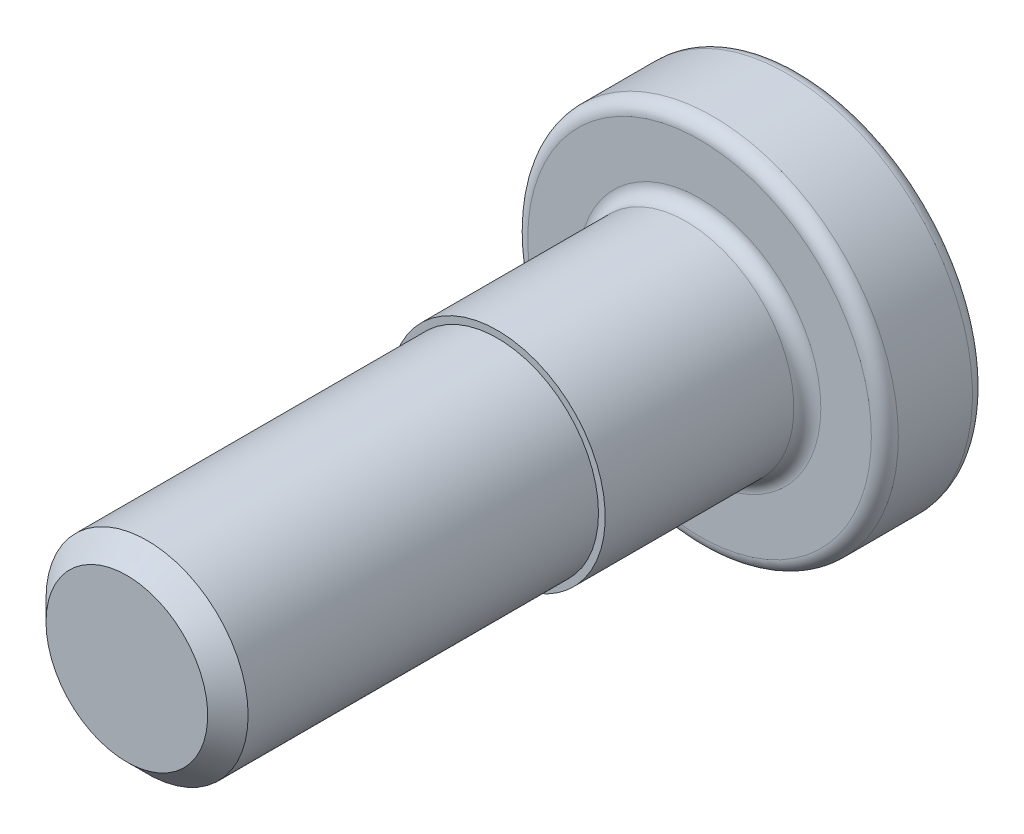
ISO-10303-21;
HEADER;
FILE_DESCRIPTION(('STEP AP214'),'2;1');
FILE_NAME('part.step','',(''),(''),'','','');
FILE_SCHEMA(('AUTOMOTIVE_DESIGN { 1 0 10303 214 1 1 1 1 }'));
ENDSEC;
DATA;
#1=APPLICATION_CONTEXT('core data for automotive mechanical design processes');
#2=APPLICATION_PROTOCOL_DEFINITION('international standard','automotive_design',2000,#1);
#3=PRODUCT_CONTEXT('',#1,'mechanical');
#4=PRODUCT('Part','Part','',(#3));
#5=PRODUCT_RELATED_PRODUCT_CATEGORY('part','',(#4));
#6=PRODUCT_DEFINITION_FORMATION('','',#4);
#7=PRODUCT_DEFINITION_CONTEXT('part definition',#1,'design');
#8=PRODUCT_DEFINITION('design','',#6,#7);
#9=PRODUCT_DEFINITION_SHAPE('','',#8);
#10=(LENGTH_UNIT() NAMED_UNIT(*) SI_UNIT(.MILLI.,.METRE.));
#11=(NAMED_UNIT(*) PLANE_ANGLE_UNIT() SI_UNIT($,.RADIAN.));
#12=(NAMED_UNIT(*) SI_UNIT($,.STERADIAN.) SOLID_ANGLE_UNIT());
#13=UNCERTAINTY_MEASURE_WITH_UNIT(LENGTH_MEASURE(1.E-05),#10,'distance_accuracy_value','');
#14=(GEOMETRIC_REPRESENTATION_CONTEXT(3) GLOBAL_UNCERTAINTY_ASSIGNED_CONTEXT((#13)) GLOBAL_UNIT_ASSIGNED_CONTEXT((#10,
#11,#12)) REPRESENTATION_CONTEXT('',''));
#15=CARTESIAN_POINT('',(0.,0.,0.));
#16=DIRECTION('',(0.,0.,1.));
#17=DIRECTION('',(1.,0.,0.));
#18=AXIS2_PLACEMENT_3D('',#15,#16,#17);
#19=CARTESIAN_POINT('',(0.,0.,1.1));
#20=DIRECTION('',(0.,0.,-1.));
#21=DIRECTION('',(-1.,0.,0.));
#22=AXIS2_PLACEMENT_3D('',#19,#20,#21);
#23=PLANE('',#22);
#24=DIRECTION('',(-0.5,-0.866025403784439,0.));
#25=VECTOR('',#24,1.);
#26=CARTESIAN_POINT('',(0.779422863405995,-0.45,1.1));
#27=LINE('',#26,#25);
#28=CARTESIAN_POINT('',(1.03923048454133,0.,1.1));
#29=VERTEX_POINT('',#28);
#30=CARTESIAN_POINT('',(0.997367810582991,-0.07250827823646,1.09999999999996));
#31=VERTEX_POINT('',#30);
#32=EDGE_CURVE('E243',#29,#31,#27,.T.);
#33=ORIENTED_EDGE('',*,*,#32,.T.);
#34=CARTESIAN_POINT('',(0.997367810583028,-0.0725082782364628,1.1));
#35=CARTESIAN_POINT('',(1.00263913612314,0.,1.1));
#36=CARTESIAN_POINT('',(0.997367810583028,0.0725082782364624,1.1));
#37=B_SPLINE_CURVE_WITH_KNOTS('',2,(#34,#35,#36),.UNSPECIFIED.,.F.,.F.,(3,3),(0.,1.),.UNSPECIFIED.);
#38=CARTESIAN_POINT('',(0.997367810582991,0.0725082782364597,1.09999999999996));
#39=VERTEX_POINT('',#38);
#40=EDGE_CURVE('E212',#31,#39,#37,.T.);
#41=ORIENTED_EDGE('',*,*,#40,.T.);
#42=DIRECTION('',(0.5,-0.866025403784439,0.));
#43=VECTOR('',#42,1.);
#44=CARTESIAN_POINT('',(0.779422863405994,0.45,1.1));
#45=LINE('',#44,#43);
#46=EDGE_CURVE('E1421',#39,#29,#45,.T.);
#47=ORIENTED_EDGE('',*,*,#46,.T.);
#48=EDGE_LOOP('',(#33,#41,#47));
#49=FACE_BOUND('',#48,.T.);
#50=ADVANCED_FACE('F17',(#49),#23,.T.);
#51=CARTESIAN_POINT('',(0.,0.,1.1));
#52=DIRECTION('',(0.,0.,-1.));
#53=DIRECTION('',(-1.,0.,0.));
#54=AXIS2_PLACEMENT_3D('',#51,#52,#53);
#55=PLANE('',#54);
#56=DIRECTION('',(-0.5,-0.866025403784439,0.));
#57=VECTOR('',#56,1.);
#58=CARTESIAN_POINT('',(0.779422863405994,-0.45,1.1));
#59=LINE('',#58,#57);
#60=CARTESIAN_POINT('',(0.56147791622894,-0.827491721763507,1.09999999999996));
#61=VERTEX_POINT('',#60);
#62=CARTESIAN_POINT('',(0.519615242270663,-0.9,1.1));
#63=VERTEX_POINT('',#62);
#64=EDGE_CURVE('E204',#61,#63,#59,.T.);
#65=ORIENTED_EDGE('',*,*,#64,.T.);
#66=DIRECTION('',(-1.,0.,0.));
#67=VECTOR('',#66,1.);
#68=CARTESIAN_POINT('',(0.,-0.9,1.1));
#69=LINE('',#68,#67);
#70=CARTESIAN_POINT('',(0.435889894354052,-0.899999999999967,1.09999999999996));
#71=VERTEX_POINT('',#70);
#72=EDGE_CURVE('E207',#63,#71,#69,.T.);
#73=ORIENTED_EDGE('',*,*,#72,.T.);
#74=CARTESIAN_POINT('',(0.435889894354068,-0.9,1.1));
#75=CARTESIAN_POINT('',(0.501319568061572,-0.868310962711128,1.1));
#76=CARTESIAN_POINT('',(0.561477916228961,-0.827491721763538,1.1));
#77=B_SPLINE_CURVE_WITH_KNOTS('',2,(#74,#75,#76),.UNSPECIFIED.,.F.,.F.,(3,3),(0.,1.),.UNSPECIFIED.);
#78=EDGE_CURVE('E199',#71,#61,#77,.T.);
#79=ORIENTED_EDGE('',*,*,#78,.T.);
#80=EDGE_LOOP('',(#65,#73,#79));
#81=FACE_BOUND('',#80,.T.);
#82=ADVANCED_FACE('F202',(#81),#55,.T.);
#83=CARTESIAN_POINT('',(0.,0.,1.1));
#84=DIRECTION('',(0.,0.,-1.));
#85=DIRECTION('',(-1.,0.,0.));
#86=AXIS2_PLACEMENT_3D('',#83,#84,#85);
#87=PLANE('',#86);
#88=DIRECTION('',(-0.5,0.866025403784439,0.));
#89=VECTOR('',#88,1.);
#90=CARTESIAN_POINT('',(-0.779422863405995,-0.45,1.1));
#91=LINE('',#90,#89);
#92=CARTESIAN_POINT('',(-0.519615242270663,-0.9,1.1));
#93=VERTEX_POINT('',#92);
#94=CARTESIAN_POINT('',(-0.561477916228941,-0.827491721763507,1.09999999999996));
#95=VERTEX_POINT('',#94);
#96=EDGE_CURVE('E1702',#93,#95,#91,.T.);
#97=ORIENTED_EDGE('',*,*,#96,.T.);
#98=CARTESIAN_POINT('',(-0.561477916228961,-0.827491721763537,1.1));
#99=CARTESIAN_POINT('',(-0.501319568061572,-0.868310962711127,1.1));
#100=CARTESIAN_POINT('',(-0.435889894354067,-0.9,1.1));
#101=B_SPLINE_CURVE_WITH_KNOTS('',2,(#98,#99,#100),.UNSPECIFIED.,.F.,.F.,(3,3),(0.,1.),.UNSPECIFIED.);
#102=CARTESIAN_POINT('',(-0.435889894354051,-0.899999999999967,1.09999999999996));
#103=VERTEX_POINT('',#102);
#104=EDGE_CURVE('E1788',#95,#103,#101,.T.);
#105=ORIENTED_EDGE('',*,*,#104,.T.);
#106=DIRECTION('',(-1.,0.,0.));
#107=VECTOR('',#106,1.);
#108=CARTESIAN_POINT('',(0.,-0.9,1.1));
#109=LINE('',#108,#107);
#110=EDGE_CURVE('E683',#103,#93,#109,.T.);
#111=ORIENTED_EDGE('',*,*,#110,.T.);
#112=EDGE_LOOP('',(#97,#105,#111));
#113=FACE_BOUND('',#112,.T.);
#114=ADVANCED_FACE('F610',(#113),#87,.T.);
#115=CARTESIAN_POINT('',(0.,0.,1.1));
#116=DIRECTION('',(0.,0.,-1.));
#117=DIRECTION('',(-1.,0.,0.));
#118=AXIS2_PLACEMENT_3D('',#115,#116,#117);
#119=PLANE('',#118);
#120=DIRECTION('',(-0.5,0.866025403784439,0.));
#121=VECTOR('',#120,1.);
#122=CARTESIAN_POINT('',(-0.779422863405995,-0.45,1.1));
#123=LINE('',#122,#121);
#124=CARTESIAN_POINT('',(-0.997367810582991,-0.0725082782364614,1.09999999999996));
#125=VERTEX_POINT('',#124);
#126=CARTESIAN_POINT('',(-1.03923048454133,0.,1.1));
#127=VERTEX_POINT('',#126);
#128=EDGE_CURVE('E1775',#125,#127,#123,.T.);
#129=ORIENTED_EDGE('',*,*,#128,.T.);
#130=DIRECTION('',(0.5,0.866025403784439,0.));
#131=VECTOR('',#130,1.);
#132=CARTESIAN_POINT('',(-0.779422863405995,0.45,1.1));
#133=LINE('',#132,#131);
#134=CARTESIAN_POINT('',(-0.997367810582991,0.0725082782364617,1.09999999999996));
#135=VERTEX_POINT('',#134);
#136=EDGE_CURVE('E1744',#127,#135,#133,.T.);
#137=ORIENTED_EDGE('',*,*,#136,.T.);
#138=CARTESIAN_POINT('',(-0.997367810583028,0.0725082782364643,1.1));
#139=CARTESIAN_POINT('',(-1.00263913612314,0.,1.1));
#140=CARTESIAN_POINT('',(-0.997367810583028,-0.0725082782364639,1.1));
#141=B_SPLINE_CURVE_WITH_KNOTS('',2,(#138,#139,#140),.UNSPECIFIED.,.F.,.F.,(3,3),(0.,1.),.UNSPECIFIED.);
#142=EDGE_CURVE('E591',#135,#125,#141,.T.);
#143=ORIENTED_EDGE('',*,*,#142,.T.);
#144=EDGE_LOOP('',(#129,#137,#143));
#145=FACE_BOUND('',#144,.T.);
#146=ADVANCED_FACE('F599',(#145),#119,.T.);
#147=CARTESIAN_POINT('',(0.,0.,1.1));
#148=DIRECTION('',(0.,0.,-1.));
#149=DIRECTION('',(-1.,0.,0.));
#150=AXIS2_PLACEMENT_3D('',#147,#148,#149);
#151=PLANE('',#150);
#152=DIRECTION('',(0.5,-0.866025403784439,0.));
#153=VECTOR('',#152,1.);
#154=CARTESIAN_POINT('',(0.779422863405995,0.45,1.1));
#155=LINE('',#154,#153);
#156=CARTESIAN_POINT('',(0.519615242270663,0.9,1.1));
#157=VERTEX_POINT('',#156);
#158=CARTESIAN_POINT('',(0.561477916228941,0.827491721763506,1.09999999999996));
#159=VERTEX_POINT('',#158);
#160=EDGE_CURVE('E1330',#157,#159,#155,.T.);
#161=ORIENTED_EDGE('',*,*,#160,.T.);
#162=CARTESIAN_POINT('',(0.561477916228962,0.827491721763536,1.1));
#163=CARTESIAN_POINT('',(0.501319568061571,0.868310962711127,1.1));
#164=CARTESIAN_POINT('',(0.435889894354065,0.9,1.1));
#165=B_SPLINE_CURVE_WITH_KNOTS('',2,(#162,#163,#164),.UNSPECIFIED.,.F.,.F.,(3,3),(0.,1.),.UNSPECIFIED.);
#166=CARTESIAN_POINT('',(0.435889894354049,0.899999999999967,1.09999999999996));
#167=VERTEX_POINT('',#166);
#168=EDGE_CURVE('E1060',#159,#167,#165,.T.);
#169=ORIENTED_EDGE('',*,*,#168,.T.);
#170=DIRECTION('',(1.,0.,0.));
#171=VECTOR('',#170,1.);
#172=CARTESIAN_POINT('',(0.,0.9,1.1));
#173=LINE('',#172,#171);
#174=EDGE_CURVE('E448',#167,#157,#173,.T.);
#175=ORIENTED_EDGE('',*,*,#174,.T.);
#176=EDGE_LOOP('',(#161,#169,#175));
#177=FACE_BOUND('',#176,.T.);
#178=ADVANCED_FACE('F609',(#177),#151,.T.);
#179=CARTESIAN_POINT('',(0.,0.,1.1));
#180=DIRECTION('',(0.,0.,-1.));
#181=DIRECTION('',(-1.,0.,0.));
#182=AXIS2_PLACEMENT_3D('',#179,#180,#181);
#183=PLANE('',#182);
#184=DIRECTION('',(0.5,0.866025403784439,0.));
#185=VECTOR('',#184,1.);
#186=CARTESIAN_POINT('',(-0.779422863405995,0.45,1.1));
#187=LINE('',#186,#185);
#188=CARTESIAN_POINT('',(-0.561477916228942,0.827491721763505,1.09999999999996));
#189=VERTEX_POINT('',#188);
#190=CARTESIAN_POINT('',(-0.519615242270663,0.9,1.1));
#191=VERTEX_POINT('',#190);
#192=EDGE_CURVE('E497',#189,#191,#187,.T.);
#193=ORIENTED_EDGE('',*,*,#192,.T.);
#194=DIRECTION('',(1.,0.,0.));
#195=VECTOR('',#194,1.);
#196=CARTESIAN_POINT('',(0.,0.9,1.1));
#197=LINE('',#196,#195);
#198=CARTESIAN_POINT('',(-0.435889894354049,0.899999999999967,1.09999999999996));
#199=VERTEX_POINT('',#198);
#200=EDGE_CURVE('E400',#191,#199,#197,.T.);
#201=ORIENTED_EDGE('',*,*,#200,.T.);
#202=CARTESIAN_POINT('',(-0.435889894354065,0.9,1.1));
#203=CARTESIAN_POINT('',(-0.501319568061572,0.868310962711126,1.1));
#204=CARTESIAN_POINT('',(-0.561477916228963,0.827491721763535,1.1));
#205=B_SPLINE_CURVE_WITH_KNOTS('',2,(#202,#203,#204),.UNSPECIFIED.,.F.,.F.,(3,3),(0.,1.),.UNSPECIFIED.);
#206=EDGE_CURVE('E1043',#199,#189,#205,.T.);
#207=ORIENTED_EDGE('',*,*,#206,.T.);
#208=EDGE_LOOP('',(#193,#201,#207));
#209=FACE_BOUND('',#208,.T.);
#210=ADVANCED_FACE('F1064',(#209),#183,.T.);
#211=CARTESIAN_POINT('',(0.,0.,1.09999999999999));
#212=DIRECTION('',(0.,0.,-1.));
#213=DIRECTION('',(-1.,0.,0.));
#214=AXIS2_PLACEMENT_3D('',#211,#212,#213);
#215=CONICAL_SURFACE('',#214,0.999999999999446,1.30899693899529);
#216=CARTESIAN_POINT('',(0.,-2.22044604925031E-12,1.36794919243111));
#217=VERTEX_POINT('',#216);
#218=VERTEX_LOOP('',#217);
#219=FACE_BOUND('',#218,.T.);
#220=CARTESIAN_POINT('',(0.,-1.,1.1));
#221=CARTESIAN_POINT('',(0.0197467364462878,-0.999997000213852,1.09999959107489));
#222=CARTESIAN_POINT('',(0.0394920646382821,-0.999400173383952,1.09999923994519));
#223=CARTESIAN_POINT('',(0.0787939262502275,-0.997048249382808,1.09999866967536));
#224=CARTESIAN_POINT('',(0.0983508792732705,-0.995300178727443,1.09999844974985));
#225=CARTESIAN_POINT('',(0.137132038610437,-0.990698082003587,1.09999815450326));
#226=CARTESIAN_POINT('',(0.156357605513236,-0.987855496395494,1.09999807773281));
#227=CARTESIAN_POINT('',(0.19433195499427,-0.981108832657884,1.09999805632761));
#228=CARTESIAN_POINT('',(0.213083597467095,-0.977220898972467,1.09999810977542));
#229=CARTESIAN_POINT('',(0.249969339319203,-0.968439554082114,1.09999832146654));
#230=CARTESIAN_POINT('',(0.268108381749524,-0.963566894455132,1.09999847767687));
#231=CARTESIAN_POINT('',(0.303682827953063,-0.952932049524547,1.09999884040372));
#232=CARTESIAN_POINT('',(0.321124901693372,-0.947192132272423,1.0999990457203));
#233=CARTESIAN_POINT('',(0.355233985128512,-0.934925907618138,1.09999943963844));
#234=CARTESIAN_POINT('',(0.371909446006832,-0.928423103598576,1.09999962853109));
#235=CARTESIAN_POINT('',(0.404412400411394,-0.914733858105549,1.09999990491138));
#236=CARTESIAN_POINT('',(0.420250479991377,-0.907572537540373,1.09999999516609));
#237=CARTESIAN_POINT('',(0.435889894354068,-0.9,1.1));
#238=B_SPLINE_CURVE_WITH_KNOTS('',3,(#220,#221,#222,#223,#224,#225,#226,#227,#228,#229,#230,
#231,#232,#233,#234,#235,#236,#237),.UNSPECIFIED.,.F.,.F.,(4,2,2,2,2,2,2,2,4),(0.,
0.0592293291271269,0.11810046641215,0.176372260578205,0.233791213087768,0.290107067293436,
0.345166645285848,0.398836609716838,0.45095892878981),.UNSPECIFIED.);
#239=CARTESIAN_POINT('',(0.,-0.999999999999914,1.09999999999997));
#240=VERTEX_POINT('',#239);
#241=EDGE_CURVE('E753',#71,#240,#238,.F.);
#242=ORIENTED_EDGE('',*,*,#241,.T.);
#243=CARTESIAN_POINT('',(-0.435889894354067,-0.9,1.1));
#244=CARTESIAN_POINT('',(-0.420250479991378,-0.907572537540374,1.09999999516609));
#245=CARTESIAN_POINT('',(-0.404412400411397,-0.91473385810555,1.09999990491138));
#246=CARTESIAN_POINT('',(-0.371909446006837,-0.928423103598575,1.09999962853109));
#247=CARTESIAN_POINT('',(-0.355233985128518,-0.934925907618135,1.09999943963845));
#248=CARTESIAN_POINT('',(-0.321124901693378,-0.947192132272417,1.0999990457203));
#249=CARTESIAN_POINT('',(-0.303682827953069,-0.952932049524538,1.09999884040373));
#250=CARTESIAN_POINT('',(-0.26810838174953,-0.963566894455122,1.09999847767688));
#251=CARTESIAN_POINT('',(-0.24996933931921,-0.968439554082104,1.09999832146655));
#252=CARTESIAN_POINT('',(-0.213083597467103,-0.977220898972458,1.09999810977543));
#253=CARTESIAN_POINT('',(-0.194331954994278,-0.981108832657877,1.09999805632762));
#254=CARTESIAN_POINT('',(-0.156357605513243,-0.987855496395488,1.09999807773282));
#255=CARTESIAN_POINT('',(-0.137132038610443,-0.990698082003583,1.09999815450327));
#256=CARTESIAN_POINT('',(-0.0983508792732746,-0.99530017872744,1.09999844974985));
#257=CARTESIAN_POINT('',(-0.0787939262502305,-0.997048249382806,1.09999866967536));
#258=CARTESIAN_POINT('',(-0.0394920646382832,-0.999400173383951,1.09999923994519));
#259=CARTESIAN_POINT('',(-0.0197467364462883,-0.999997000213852,1.09999959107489));
#260=CARTESIAN_POINT('',(0.,-1.,1.1));
#261=B_SPLINE_CURVE_WITH_KNOTS('',3,(#243,#244,#245,#246,#247,#248,#249,#250,#251,#252,#253,
#254,#255,#256,#257,#258,#259,#260),.UNSPECIFIED.,.F.,.F.,(4,2,2,2,2,2,2,2,4),(0.,
0.0521223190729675,0.105792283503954,0.160851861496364,0.217167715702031,0.274586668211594,
0.332858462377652,0.391729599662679,0.450958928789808),.UNSPECIFIED.);
#262=EDGE_CURVE('E691',#240,#103,#261,.F.);
#263=ORIENTED_EDGE('',*,*,#262,.T.);
#264=ORIENTED_EDGE('',*,*,#104,.F.);
#265=CARTESIAN_POINT('',(-0.866025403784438,-0.5,1.1));
#266=CARTESIAN_POINT('',(-0.856149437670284,-0.517099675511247,1.09999959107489));
#267=CARTESIAN_POINT('',(-0.845759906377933,-0.533901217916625,1.09999923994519));
#268=CARTESIAN_POINT('',(-0.824072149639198,-0.566761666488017,1.09999866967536));
#269=CARTESIAN_POINT('',(-0.81277979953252,-0.582824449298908,1.09999844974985));
#270=CARTESIAN_POINT('',(-0.789403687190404,-0.614108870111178,1.09999815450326));
#271=CARTESIAN_POINT('',(-0.777329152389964,-0.629337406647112,1.09999807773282));
#272=CARTESIAN_POINT('',(-0.752499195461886,-0.658850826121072,1.09999805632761));
#273=CARTESIAN_POINT('',(-0.739756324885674,-0.673146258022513,1.09999810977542));
#274=CARTESIAN_POINT('',(-0.713708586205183,-0.700699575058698,1.09999832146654));
#275=CARTESIAN_POINT('',(-0.700419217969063,-0.71397211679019,1.09999847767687));
#276=CARTESIAN_POINT('',(-0.673421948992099,-0.739463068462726,1.09999884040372));
#277=CARTESIAN_POINT('',(-0.659729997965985,-0.751698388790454,1.0999990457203));
#278=CARTESIAN_POINT('',(-0.632052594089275,-0.775104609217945,1.09999943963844));
#279=CARTESIAN_POINT('',(-0.618083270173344,-0.786294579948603,1.09999962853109));
#280=CARTESIAN_POINT('',(-0.589976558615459,-0.807598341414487,1.09999990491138));
#281=CARTESIAN_POINT('',(-0.575855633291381,-0.817733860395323,1.0999999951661));
#282=CARTESIAN_POINT('',(-0.561477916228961,-0.827491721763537,1.1));
#283=B_SPLINE_CURVE_WITH_KNOTS('',3,(#265,#266,#267,#268,#269,#270,#271,#272,#273,#274,#275,
#276,#277,#278,#279,#280,#281,#282),.UNSPECIFIED.,.F.,.F.,(4,2,2,2,2,2,2,2,4),(0.,
0.0592293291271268,0.11810046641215,0.176372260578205,0.233791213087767,0.290107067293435,
0.345166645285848,0.398836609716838,0.450958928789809),.UNSPECIFIED.);
#284=CARTESIAN_POINT('',(-0.866025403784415,-0.499999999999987,1.09999999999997));
#285=VERTEX_POINT('',#284);
#286=EDGE_CURVE('E1741',#95,#285,#283,.F.);
#287=ORIENTED_EDGE('',*,*,#286,.T.);
#288=CARTESIAN_POINT('',(-0.997367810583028,-0.072508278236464,1.1));
#289=CARTESIAN_POINT('',(-0.996106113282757,-0.0898386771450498,1.0999999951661));
#290=CARTESIAN_POINT('',(-0.99438895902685,-0.107135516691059,1.09999990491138));
#291=CARTESIAN_POINT('',(-0.989992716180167,-0.142128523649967,1.0999996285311));
#292=CARTESIAN_POINT('',(-0.987286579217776,-0.159821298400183,1.09999943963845));
#293=CARTESIAN_POINT('',(-0.98085489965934,-0.195493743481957,1.09999904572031));
#294=CARTESIAN_POINT('',(-0.977104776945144,-0.213468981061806,1.09999884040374));
#295=CARTESIAN_POINT('',(-0.968527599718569,-0.249594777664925,1.09999847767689));
#296=CARTESIAN_POINT('',(-0.96367792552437,-0.267739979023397,1.09999832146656));
#297=CARTESIAN_POINT('',(-0.952839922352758,-0.304074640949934,1.09999810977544));
#298=CARTESIAN_POINT('',(-0.946831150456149,-0.322258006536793,1.09999805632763));
#299=CARTESIAN_POINT('',(-0.933686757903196,-0.358518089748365,1.09999807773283));
#300=CARTESIAN_POINT('',(-0.926535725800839,-0.376589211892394,1.09999815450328));
#301=CARTESIAN_POINT('',(-0.911130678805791,-0.412475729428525,1.09999844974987));
#302=CARTESIAN_POINT('',(-0.902866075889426,-0.430286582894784,1.09999866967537));
#303=CARTESIAN_POINT('',(-0.885251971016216,-0.465498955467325,1.0999992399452));
#304=CARTESIAN_POINT('',(-0.875896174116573,-0.482897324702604,1.0999995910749));
#305=CARTESIAN_POINT('',(-0.866025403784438,-0.5,1.1));
#306=B_SPLINE_CURVE_WITH_KNOTS('',3,(#288,#289,#290,#291,#292,#293,#294,#295,#296,#297,#298,
#299,#300,#301,#302,#303,#304,#305),.UNSPECIFIED.,.F.,.F.,(4,2,2,2,2,2,2,2,4),(0.,
0.0521223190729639,0.105792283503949,0.160851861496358,0.217167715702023,0.274586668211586,
0.332858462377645,0.391729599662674,0.450958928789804),.UNSPECIFIED.);
#307=EDGE_CURVE('E631',#285,#125,#306,.F.);
#308=ORIENTED_EDGE('',*,*,#307,.T.);
#309=ORIENTED_EDGE('',*,*,#142,.F.);
#310=CARTESIAN_POINT('',(-0.866025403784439,0.499999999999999,1.1));
#311=CARTESIAN_POINT('',(-0.875896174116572,0.482897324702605,1.09999959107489));
#312=CARTESIAN_POINT('',(-0.885251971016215,0.465498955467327,1.09999923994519));
#313=CARTESIAN_POINT('',(-0.902866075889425,0.430286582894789,1.09999866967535));
#314=CARTESIAN_POINT('',(-0.91113067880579,0.412475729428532,1.09999844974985));
#315=CARTESIAN_POINT('',(-0.92653572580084,0.376589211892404,1.09999815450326));
#316=CARTESIAN_POINT('',(-0.933686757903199,0.358518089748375,1.09999807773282));
#317=CARTESIAN_POINT('',(-0.946831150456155,0.322258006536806,1.09999805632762));
#318=CARTESIAN_POINT('',(-0.952839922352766,0.304074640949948,1.09999810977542));
#319=CARTESIAN_POINT('',(-0.96367792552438,0.267739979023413,1.09999832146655));
#320=CARTESIAN_POINT('',(-0.968527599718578,0.249594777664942,1.09999847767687));
#321=CARTESIAN_POINT('',(-0.977104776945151,0.213468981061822,1.09999884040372));
#322=CARTESIAN_POINT('',(-0.980854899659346,0.19549374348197,1.0999990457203));
#323=CARTESIAN_POINT('',(-0.987286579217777,0.159821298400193,1.09999943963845));
#324=CARTESIAN_POINT('',(-0.989992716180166,0.142128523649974,1.09999962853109));
#325=CARTESIAN_POINT('',(-0.994388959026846,0.107135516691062,1.09999990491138));
#326=CARTESIAN_POINT('',(-0.996106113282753,0.0898386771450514,1.09999999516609));
#327=CARTESIAN_POINT('',(-0.997367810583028,0.0725082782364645,1.1));
#328=B_SPLINE_CURVE_WITH_KNOTS('',3,(#310,#311,#312,#313,#314,#315,#316,#317,#318,#319,#320,
#321,#322,#323,#324,#325,#326,#327),.UNSPECIFIED.,.F.,.F.,(4,2,2,2,2,2,2,2,4),(0.,
0.0592293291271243,0.11810046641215,0.176372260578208,0.233791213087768,0.290107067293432,
0.345166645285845,0.398836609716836,0.450958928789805),.UNSPECIFIED.);
#329=CARTESIAN_POINT('',(-0.866025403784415,0.499999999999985,1.09999999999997));
#330=VERTEX_POINT('',#329);
#331=EDGE_CURVE('E570',#135,#330,#328,.F.);
#332=ORIENTED_EDGE('',*,*,#331,.T.);
#333=CARTESIAN_POINT('',(-0.561477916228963,0.827491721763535,1.1));
#334=CARTESIAN_POINT('',(-0.575855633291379,0.81773386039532,1.09999999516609));
#335=CARTESIAN_POINT('',(-0.589976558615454,0.807598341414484,1.09999990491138));
#336=CARTESIAN_POINT('',(-0.618083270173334,0.786294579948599,1.09999962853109));
#337=CARTESIAN_POINT('',(-0.632052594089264,0.775104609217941,1.09999943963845));
#338=CARTESIAN_POINT('',(-0.65972999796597,0.751698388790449,1.0999990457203));
#339=CARTESIAN_POINT('',(-0.673421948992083,0.739463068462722,1.09999884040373));
#340=CARTESIAN_POINT('',(-0.700419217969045,0.713972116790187,1.09999847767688));
#341=CARTESIAN_POINT('',(-0.713708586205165,0.700699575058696,1.09999832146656));
#342=CARTESIAN_POINT('',(-0.739756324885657,0.673146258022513,1.09999810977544));
#343=CARTESIAN_POINT('',(-0.75249919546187,0.658850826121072,1.09999805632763));
#344=CARTESIAN_POINT('',(-0.77732915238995,0.629337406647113,1.09999807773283));
#345=CARTESIAN_POINT('',(-0.789403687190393,0.614108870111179,1.09999815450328));
#346=CARTESIAN_POINT('',(-0.812779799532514,0.582824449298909,1.09999844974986));
#347=CARTESIAN_POINT('',(-0.824072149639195,0.566761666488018,1.09999866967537));
#348=CARTESIAN_POINT('',(-0.845759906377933,0.533901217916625,1.0999992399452));
#349=CARTESIAN_POINT('',(-0.856149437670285,0.517099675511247,1.09999959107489));
#350=CARTESIAN_POINT('',(-0.866025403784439,0.499999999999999,1.1));
#351=B_SPLINE_CURVE_WITH_KNOTS('',3,(#333,#334,#335,#336,#337,#338,#339,#340,#341,#342,#343,
#344,#345,#346,#347,#348,#349,#350),.UNSPECIFIED.,.F.,.F.,(4,2,2,2,2,2,2,2,4),(0.,
0.0521223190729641,0.105792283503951,0.160851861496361,0.217167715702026,0.274586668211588,
0.332858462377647,0.391729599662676,0.450958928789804),.UNSPECIFIED.);
#352=EDGE_CURVE('E510',#330,#189,#351,.F.);
#353=ORIENTED_EDGE('',*,*,#352,.T.);
#354=ORIENTED_EDGE('',*,*,#206,.F.);
#355=CARTESIAN_POINT('',(0.,1.,1.1));
#356=CARTESIAN_POINT('',(-0.019746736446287,0.999997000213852,1.09999959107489));
#357=CARTESIAN_POINT('',(-0.0394920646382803,0.999400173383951,1.09999923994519));
#358=CARTESIAN_POINT('',(-0.0787939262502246,0.997048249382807,1.09999866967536));
#359=CARTESIAN_POINT('',(-0.0983508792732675,0.995300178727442,1.09999844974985));
#360=CARTESIAN_POINT('',(-0.137132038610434,0.990698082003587,1.09999815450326));
#361=CARTESIAN_POINT('',(-0.156357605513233,0.987855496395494,1.09999807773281));
#362=CARTESIAN_POINT('',(-0.194331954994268,0.981108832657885,1.09999805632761));
#363=CARTESIAN_POINT('',(-0.213083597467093,0.977220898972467,1.09999810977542));
#364=CARTESIAN_POINT('',(-0.2499693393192,0.968439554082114,1.09999832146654));
#365=CARTESIAN_POINT('',(-0.268108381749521,0.963566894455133,1.09999847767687));
#366=CARTESIAN_POINT('',(-0.30368282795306,0.952932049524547,1.09999884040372));
#367=CARTESIAN_POINT('',(-0.321124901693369,0.947192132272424,1.0999990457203));
#368=CARTESIAN_POINT('',(-0.355233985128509,0.934925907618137,1.09999943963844));
#369=CARTESIAN_POINT('',(-0.371909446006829,0.928423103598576,1.09999962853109));
#370=CARTESIAN_POINT('',(-0.404412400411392,0.914733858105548,1.09999990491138));
#371=CARTESIAN_POINT('',(-0.420250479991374,0.907572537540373,1.0999999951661));
#372=CARTESIAN_POINT('',(-0.435889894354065,0.9,1.1));
#373=B_SPLINE_CURVE_WITH_KNOTS('',3,(#355,#356,#357,#358,#359,#360,#361,#362,#363,#364,#365,
#366,#367,#368,#369,#370,#371,#372),.UNSPECIFIED.,.F.,.F.,(4,2,2,2,2,2,2,2,4),(0.,
0.059229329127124,0.118100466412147,0.176372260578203,0.233791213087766,0.290107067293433,
0.345166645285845,0.398836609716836,0.450958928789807),.UNSPECIFIED.);
#374=CARTESIAN_POINT('',(0.,0.999999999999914,1.09999999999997));
#375=VERTEX_POINT('',#374);
#376=EDGE_CURVE('E356',#199,#375,#373,.F.);
#377=ORIENTED_EDGE('',*,*,#376,.T.);
#378=CARTESIAN_POINT('',(0.435889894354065,0.9,1.1));
#379=CARTESIAN_POINT('',(0.420250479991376,0.907572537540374,1.09999999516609));
#380=CARTESIAN_POINT('',(0.404412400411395,0.91473385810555,1.09999990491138));
#381=CARTESIAN_POINT('',(0.371909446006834,0.928423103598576,1.09999962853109));
#382=CARTESIAN_POINT('',(0.355233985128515,0.934925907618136,1.09999943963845));
#383=CARTESIAN_POINT('',(0.321124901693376,0.947192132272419,1.0999990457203));
#384=CARTESIAN_POINT('',(0.303682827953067,0.952932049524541,1.09999884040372));
#385=CARTESIAN_POINT('',(0.268108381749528,0.963566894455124,1.09999847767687));
#386=CARTESIAN_POINT('',(0.249969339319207,0.968439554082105,1.09999832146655));
#387=CARTESIAN_POINT('',(0.2130835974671,0.977220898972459,1.09999810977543));
#388=CARTESIAN_POINT('',(0.194331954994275,0.981108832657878,1.09999805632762));
#389=CARTESIAN_POINT('',(0.15635760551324,0.987855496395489,1.09999807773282));
#390=CARTESIAN_POINT('',(0.13713203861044,0.990698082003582,1.09999815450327));
#391=CARTESIAN_POINT('',(0.0983508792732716,0.99530017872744,1.09999844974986));
#392=CARTESIAN_POINT('',(0.0787939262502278,0.997048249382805,1.09999866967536));
#393=CARTESIAN_POINT('',(0.0394920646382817,0.999400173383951,1.0999992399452));
#394=CARTESIAN_POINT('',(0.0197467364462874,0.999997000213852,1.09999959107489));
#395=CARTESIAN_POINT('',(0.,0.999999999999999,1.1));
#396=B_SPLINE_CURVE_WITH_KNOTS('',3,(#378,#379,#380,#381,#382,#383,#384,#385,#386,#387,#388,
#389,#390,#391,#392,#393,#394,#395),.UNSPECIFIED.,.F.,.F.,(4,2,2,2,2,2,2,2,4),(0.,
0.0521223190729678,0.105792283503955,0.160851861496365,0.217167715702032,0.274586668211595,
0.332858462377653,0.391729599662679,0.450958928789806),.UNSPECIFIED.);
#397=EDGE_CURVE('E504',#375,#167,#396,.F.);
#398=ORIENTED_EDGE('',*,*,#397,.T.);
#399=ORIENTED_EDGE('',*,*,#168,.F.);
#400=CARTESIAN_POINT('',(0.866025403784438,0.499999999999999,1.1));
#401=CARTESIAN_POINT('',(0.856149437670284,0.517099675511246,1.0999995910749));
#402=CARTESIAN_POINT('',(0.845759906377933,0.533901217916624,1.09999923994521));
#403=CARTESIAN_POINT('',(0.824072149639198,0.566761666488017,1.09999866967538));
#404=CARTESIAN_POINT('',(0.81277979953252,0.582824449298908,1.09999844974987));
#405=CARTESIAN_POINT('',(0.789403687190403,0.614108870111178,1.09999815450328));
#406=CARTESIAN_POINT('',(0.777329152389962,0.629337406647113,1.09999807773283));
#407=CARTESIAN_POINT('',(0.752499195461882,0.658850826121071,1.09999805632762));
#408=CARTESIAN_POINT('',(0.739756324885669,0.673146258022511,1.09999810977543));
#409=CARTESIAN_POINT('',(0.713708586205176,0.700699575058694,1.09999832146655));
#410=CARTESIAN_POINT('',(0.700419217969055,0.713972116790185,1.09999847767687));
#411=CARTESIAN_POINT('',(0.673421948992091,0.73946306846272,1.09999884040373));
#412=CARTESIAN_POINT('',(0.659729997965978,0.751698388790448,1.0999990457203));
#413=CARTESIAN_POINT('',(0.632052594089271,0.775104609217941,1.09999943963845));
#414=CARTESIAN_POINT('',(0.61808327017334,0.786294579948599,1.09999962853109));
#415=CARTESIAN_POINT('',(0.589976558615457,0.807598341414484,1.09999990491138));
#416=CARTESIAN_POINT('',(0.575855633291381,0.817733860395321,1.09999999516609));
#417=CARTESIAN_POINT('',(0.561477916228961,0.827491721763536,1.1));
#418=B_SPLINE_CURVE_WITH_KNOTS('',3,(#400,#401,#402,#403,#404,#405,#406,#407,#408,#409,#410,
#411,#412,#413,#414,#415,#416,#417),.UNSPECIFIED.,.F.,.F.,(4,2,2,2,2,2,2,2,4),(0.,
0.0592293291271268,0.118100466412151,0.176372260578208,0.23379121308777,0.290107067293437,
0.345166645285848,0.398836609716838,0.450958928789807),.UNSPECIFIED.);
#419=CARTESIAN_POINT('',(0.866025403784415,0.499999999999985,1.09999999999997));
#420=VERTEX_POINT('',#419);
#421=EDGE_CURVE('E228',#159,#420,#418,.F.);
#422=ORIENTED_EDGE('',*,*,#421,.T.);
#423=CARTESIAN_POINT('',(0.997367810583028,0.0725082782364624,1.1));
#424=CARTESIAN_POINT('',(0.996106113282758,0.0898386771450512,1.09999999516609));
#425=CARTESIAN_POINT('',(0.994388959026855,0.107135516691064,1.09999990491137));
#426=CARTESIAN_POINT('',(0.98999271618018,0.142128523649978,1.09999962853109));
#427=CARTESIAN_POINT('',(0.987286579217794,0.159821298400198,1.09999943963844));
#428=CARTESIAN_POINT('',(0.980854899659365,0.195493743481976,1.09999904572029));
#429=CARTESIAN_POINT('',(0.977104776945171,0.213468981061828,1.09999884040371));
#430=CARTESIAN_POINT('',(0.968527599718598,0.249594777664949,1.09999847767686));
#431=CARTESIAN_POINT('',(0.963677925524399,0.267739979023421,1.09999832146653));
#432=CARTESIAN_POINT('',(0.952839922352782,0.304074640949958,1.0999981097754));
#433=CARTESIAN_POINT('',(0.94683115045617,0.322258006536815,1.09999805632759));
#434=CARTESIAN_POINT('',(0.93368675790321,0.358518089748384,1.09999807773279));
#435=CARTESIAN_POINT('',(0.926535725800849,0.376589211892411,1.09999815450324));
#436=CARTESIAN_POINT('',(0.911130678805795,0.412475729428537,1.09999844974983));
#437=CARTESIAN_POINT('',(0.902866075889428,0.430286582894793,1.09999866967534));
#438=CARTESIAN_POINT('',(0.885251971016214,0.465498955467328,1.09999923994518));
#439=CARTESIAN_POINT('',(0.875896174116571,0.482897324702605,1.09999959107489));
#440=CARTESIAN_POINT('',(0.866025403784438,0.499999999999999,1.1));
#441=B_SPLINE_CURVE_WITH_KNOTS('',3,(#423,#424,#425,#426,#427,#428,#429,#430,#431,#432,#433,
#434,#435,#436,#437,#438,#439,#440),.UNSPECIFIED.,.F.,.F.,(4,2,2,2,2,2,2,2,4),(0.,
0.0521223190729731,0.105792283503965,0.160851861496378,0.217167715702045,0.274586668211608,
0.332858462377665,0.391729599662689,0.450958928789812),.UNSPECIFIED.);
#442=EDGE_CURVE('E312',#420,#39,#441,.F.);
#443=ORIENTED_EDGE('',*,*,#442,.T.);
#444=ORIENTED_EDGE('',*,*,#40,.F.);
#445=CARTESIAN_POINT('',(0.866025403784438,-0.5,1.1));
#446=CARTESIAN_POINT('',(0.875896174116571,-0.482897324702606,1.09999959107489));
#447=CARTESIAN_POINT('',(0.885251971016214,-0.46549895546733,1.09999923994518));
#448=CARTESIAN_POINT('',(0.902866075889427,-0.430286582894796,1.09999866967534));
#449=CARTESIAN_POINT('',(0.911130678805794,-0.412475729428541,1.09999844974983));
#450=CARTESIAN_POINT('',(0.926535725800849,-0.376589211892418,1.09999815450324));
#451=CARTESIAN_POINT('',(0.93368675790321,-0.358518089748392,1.09999807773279));
#452=CARTESIAN_POINT('',(0.946831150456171,-0.322258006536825,1.09999805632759));
#453=CARTESIAN_POINT('',(0.952839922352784,-0.304074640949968,1.09999810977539));
#454=CARTESIAN_POINT('',(0.963677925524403,-0.267739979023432,1.09999832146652));
#455=CARTESIAN_POINT('',(0.968527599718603,-0.24959477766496,1.09999847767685));
#456=CARTESIAN_POINT('',(0.977104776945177,-0.213468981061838,1.09999884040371));
#457=CARTESIAN_POINT('',(0.980854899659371,-0.195493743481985,1.09999904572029));
#458=CARTESIAN_POINT('',(0.987286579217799,-0.159821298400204,1.09999943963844));
#459=CARTESIAN_POINT('',(0.989992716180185,-0.142128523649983,1.09999962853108));
#460=CARTESIAN_POINT('',(0.994388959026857,-0.107135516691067,1.09999990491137));
#461=CARTESIAN_POINT('',(0.996106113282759,-0.0898386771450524,1.09999999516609));
#462=CARTESIAN_POINT('',(0.997367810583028,-0.0725082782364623,1.1));
#463=B_SPLINE_CURVE_WITH_KNOTS('',3,(#445,#446,#447,#448,#449,#450,#451,#452,#453,#454,#455,
#456,#457,#458,#459,#460,#461,#462),.UNSPECIFIED.,.F.,.F.,(4,2,2,2,2,2,2,2,4),(0.,
0.0592293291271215,0.118100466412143,0.176372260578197,0.233791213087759,0.290107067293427,
0.345166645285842,0.398836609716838,0.450958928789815),.UNSPECIFIED.);
#464=CARTESIAN_POINT('',(0.866025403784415,-0.499999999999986,1.09999999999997));
#465=VERTEX_POINT('',#464);
#466=EDGE_CURVE('E222',#31,#465,#463,.F.);
#467=ORIENTED_EDGE('',*,*,#466,.T.);
#468=CARTESIAN_POINT('',(0.561477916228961,-0.827491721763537,1.1));
#469=CARTESIAN_POINT('',(0.575855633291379,-0.817733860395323,1.09999999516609));
#470=CARTESIAN_POINT('',(0.589976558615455,-0.807598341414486,1.09999990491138));
#471=CARTESIAN_POINT('',(0.618083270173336,-0.786294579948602,1.09999962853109));
#472=CARTESIAN_POINT('',(0.632052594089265,-0.775104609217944,1.09999943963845));
#473=CARTESIAN_POINT('',(0.659729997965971,-0.751698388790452,1.0999990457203));
#474=CARTESIAN_POINT('',(0.673421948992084,-0.739463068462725,1.09999884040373));
#475=CARTESIAN_POINT('',(0.700419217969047,-0.71397211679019,1.09999847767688));
#476=CARTESIAN_POINT('',(0.713708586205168,-0.700699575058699,1.09999832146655));
#477=CARTESIAN_POINT('',(0.739756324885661,-0.673146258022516,1.09999810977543));
#478=CARTESIAN_POINT('',(0.752499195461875,-0.658850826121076,1.09999805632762));
#479=CARTESIAN_POINT('',(0.777329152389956,-0.629337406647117,1.09999807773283));
#480=CARTESIAN_POINT('',(0.789403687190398,-0.614108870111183,1.09999815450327));
#481=CARTESIAN_POINT('',(0.812779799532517,-0.582824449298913,1.09999844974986));
#482=CARTESIAN_POINT('',(0.824072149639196,-0.566761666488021,1.09999866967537));
#483=CARTESIAN_POINT('',(0.845759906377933,-0.533901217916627,1.0999992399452));
#484=CARTESIAN_POINT('',(0.856149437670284,-0.517099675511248,1.09999959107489));
#485=CARTESIAN_POINT('',(0.866025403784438,-0.5,1.1));
#486=B_SPLINE_CURVE_WITH_KNOTS('',3,(#468,#469,#470,#471,#472,#473,#474,#475,#476,#477,#478,
#479,#480,#481,#482,#483,#484,#485),.UNSPECIFIED.,.F.,.F.,(4,2,2,2,2,2,2,2,4),(0.,
0.0521223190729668,0.105792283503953,0.160851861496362,0.217167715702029,0.274586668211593,
0.33285846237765,0.391729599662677,0.450958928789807),.UNSPECIFIED.);
#487=EDGE_CURVE('E216',#465,#61,#486,.F.);
#488=ORIENTED_EDGE('',*,*,#487,.T.);
#489=ORIENTED_EDGE('',*,*,#78,.F.);
#490=EDGE_LOOP('',(#242,#263,#264,#287,#308,#309,#332,#353,#354,#377,#398,#399,#422,#443,#444,
#467,#488,#489));
#491=FACE_BOUND('',#490,.T.);
#492=ADVANCED_FACE('F219',(#219,#491),#215,.F.);
#493=CARTESIAN_POINT('',(1.08397035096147,0.122508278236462,1.));
#494=CARTESIAN_POINT('',(1.08397035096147,0.122508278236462,1.1));
#495=CARTESIAN_POINT('',(0.997367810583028,0.0725082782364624,1.1));
#496=CARTESIAN_POINT('',(1.04593972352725,0.188379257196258,1.00000024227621));
#497=CARTESIAN_POINT('',(1.05677484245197,0.169612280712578,1.07365797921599));
#498=CARTESIAN_POINT('',(0.992408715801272,0.140722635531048,1.1));
#499=CARTESIAN_POINT('',(1.00929597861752,0.251848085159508,1.01479569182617));
#500=CARTESIAN_POINT('',(1.01728788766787,0.238005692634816,1.0677988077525));
#501=CARTESIAN_POINT('',(0.979993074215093,0.213007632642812,1.09999999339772));
#502=CARTESIAN_POINT('',(0.937123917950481,0.376853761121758,1.05251444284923));
#503=CARTESIAN_POINT('',(0.942948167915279,0.366765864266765,1.07589382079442));
#504=CARTESIAN_POINT('',(0.936627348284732,0.358452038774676,1.10000000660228));
#505=CARTESIAN_POINT('',(0.901602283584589,0.438379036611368,1.07628326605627));
#506=CARTESIAN_POINT('',(0.903507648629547,0.434995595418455,1.08815257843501));
#507=CARTESIAN_POINT('',(0.905586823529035,0.431477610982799,1.09999999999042));
#508=CARTESIAN_POINT('',(0.866025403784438,0.499999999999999,1.1));
#509=CARTESIAN_POINT('',(0.866025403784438,0.499999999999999,1.1));
#510=CARTESIAN_POINT('',(0.866025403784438,0.499999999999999,1.1));
#511=(BOUNDED_SURFACE() B_SPLINE_SURFACE(3,2,((#493,#494,#495),(#496,#497,#498),(#499,#500,
#501),(#502,#503,#504),(#505,#506,#507),(#508,#509,#510)),.UNSPECIFIED.,.F.,.F.,
.F.) B_SPLINE_SURFACE_WITH_KNOTS((4,2,4),(3,3),(0.000240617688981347,0.000467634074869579,
0.000694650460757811),(0.,1.),
.UNSPECIFIED.) GEOMETRIC_REPRESENTATION_ITEM() RATIONAL_B_SPLINE_SURFACE(((1.,0.707106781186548,
1.),(1.,0.811595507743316,1.),(1.,0.882184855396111,1.),(1.,0.976771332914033,1.),(1.,
0.99990541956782,1.),(1.,1.,1.))) REPRESENTATION_ITEM('') SURFACE());
#512=CARTESIAN_POINT('',(0.866025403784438,0.499999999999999,1.1));
#513=CARTESIAN_POINT('',(0.901602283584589,0.438379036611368,1.07628326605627));
#514=CARTESIAN_POINT('',(0.937123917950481,0.376853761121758,1.05251444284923));
#515=CARTESIAN_POINT('',(1.00929597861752,0.251848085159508,1.01479569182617));
#516=CARTESIAN_POINT('',(1.04593972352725,0.188379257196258,1.00000024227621));
#517=CARTESIAN_POINT('',(1.08397035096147,0.122508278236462,1.));
#518=(BOUNDED_CURVE() B_SPLINE_CURVE(3,(#512,#513,#514,#515,#516,#517),.UNSPECIFIED.,.F.,
.F.) B_SPLINE_CURVE_WITH_KNOTS((4,2,4),(0.000240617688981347,0.000467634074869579,
0.000694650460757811),
.UNSPECIFIED.) CURVE() GEOMETRIC_REPRESENTATION_ITEM() RATIONAL_B_SPLINE_CURVE((1.,1.,1.,1.,1.,1.)) REPRESENTATION_ITEM(''));
#519=CARTESIAN_POINT('',(1.08397035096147,0.122508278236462,1.));
#520=VERTEX_POINT('',#519);
#521=EDGE_CURVE('E1012',#420,#520,#518,.T.);
#522=CARTESIAN_POINT('',(0.997367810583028,0.0725082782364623,1.));
#523=DIRECTION('',(0.5,-0.866025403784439,0.));
#524=DIRECTION('',(0.866025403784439,0.5,0.));
#525=AXIS2_PLACEMENT_3D('',#522,#523,#524);
#526=CIRCLE('',#525,0.1);
#527=EDGE_CURVE('E1334',#520,#39,#526,.T.);
#528=ORIENTED_EDGE('',*,*,#521,.T.);
#529=ORIENTED_EDGE('',*,*,#527,.T.);
#530=ORIENTED_EDGE('',*,*,#442,.F.);
#531=EDGE_LOOP('',(#528,#529,#530));
#532=FACE_BOUND('',#531,.T.);
#533=ADVANCED_FACE('F319',(#532),#511,.F.);
#534=CARTESIAN_POINT('',(0.779422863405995,0.45,1.));
#535=DIRECTION('',(0.5,-0.866025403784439,0.));
#536=DIRECTION('',(0.866025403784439,0.5,0.));
#537=AXIS2_PLACEMENT_3D('',#534,#535,#536);
#538=CYLINDRICAL_SURFACE('',#537,0.1);
#539=DIRECTION('',(-0.5,0.866025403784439,0.));
#540=VECTOR('',#539,1.);
#541=CARTESIAN_POINT('',(0.577350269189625,1.,1.));
#542=LINE('',#541,#540);
#543=CARTESIAN_POINT('',(1.15470053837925,0.,1.));
#544=VERTEX_POINT('',#543);
#545=EDGE_CURVE('E1034',#520,#544,#542,.F.);
#546=ORIENTED_EDGE('',*,*,#545,.T.);
#547=CARTESIAN_POINT('',(1.15470053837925,0.,1.));
#548=CARTESIAN_POINT('',(1.1547006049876,1.91595943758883E-08,1.0015525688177));
#549=CARTESIAN_POINT('',(1.15465813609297,1.13474968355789E-06,1.00310509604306));
#550=CARTESIAN_POINT('',(1.15448842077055,4.87208338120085E-06,1.00621797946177));
#551=CARTESIAN_POINT('',(1.15436049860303,7.50580902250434E-06,1.00777829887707));
#552=CARTESIAN_POINT('',(1.15401871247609,1.35963186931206E-05,1.01090323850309));
#553=CARTESIAN_POINT('',(1.15380410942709,1.70600739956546E-05,1.01246777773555));
#554=CARTESIAN_POINT('',(1.1532880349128,2.42392710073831E-05,1.01559753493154));
#555=CARTESIAN_POINT('',(1.15298576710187,2.79567696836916E-05,1.01716262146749));
#556=CARTESIAN_POINT('',(1.15229355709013,3.51527066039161E-05,1.02028972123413));
#557=CARTESIAN_POINT('',(1.15190276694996,3.86283770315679E-05,1.02185154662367));
#558=CARTESIAN_POINT('',(1.15103287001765,4.49455847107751E-05,1.02496826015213));
#559=CARTESIAN_POINT('',(1.15055287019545,4.77800027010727E-05,1.02652289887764));
#560=CARTESIAN_POINT('',(1.14950407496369,5.25177704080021E-05,1.02962126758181));
#561=CARTESIAN_POINT('',(1.14893434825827,5.44103748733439E-05,1.03116468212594));
#562=CARTESIAN_POINT('',(1.14770579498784,5.70714099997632E-05,1.03423653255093));
#563=CARTESIAN_POINT('',(1.14704600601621,5.78264606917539E-05,1.03576458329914));
#564=CARTESIAN_POINT('',(1.14563720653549,5.81280567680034E-05,1.03880154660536));
#565=CARTESIAN_POINT('',(1.1448872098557,5.76598152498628E-05,1.04031000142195));
#566=CARTESIAN_POINT('',(1.14329806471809,5.55431800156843E-05,1.04330353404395));
#567=CARTESIAN_POINT('',(1.14245791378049,5.38800200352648E-05,1.04478807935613));
#568=CARTESIAN_POINT('',(1.1406887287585,4.95225679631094E-05,1.04772948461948));
#569=CARTESIAN_POINT('',(1.13975868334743,4.68151841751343E-05,1.04918573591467));
#570=CARTESIAN_POINT('',(1.1378101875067,4.06303334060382E-05,1.05206619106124));
#571=CARTESIAN_POINT('',(1.13679072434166,3.71430871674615E-05,1.05348970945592));
#572=CARTESIAN_POINT('',(1.13466407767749,2.98252241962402E-05,1.0563002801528));
#573=CARTESIAN_POINT('',(1.13355588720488,2.59905721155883E-05,1.05768657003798));
#574=CARTESIAN_POINT('',(1.13125272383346,1.83855712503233E-05,1.0604182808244));
#575=CARTESIAN_POINT('',(1.13005675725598,1.46168618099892E-05,1.06176286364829));
#576=CARTESIAN_POINT('',(1.12757908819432,8.25421977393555E-06,1.06440656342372));
#577=CARTESIAN_POINT('',(1.12629641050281,5.67770201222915E-06,1.06570476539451));
#578=CARTESIAN_POINT('',(1.12364705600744,7.78271325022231E-07,1.06825178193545));
#579=CARTESIAN_POINT('',(1.12227943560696,-1.54045552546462E-06,1.06949961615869));
#580=CARTESIAN_POINT('',(1.1199403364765,1.03461506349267E-06,1.07152406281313));
#581=CARTESIAN_POINT('',(1.11898624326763,3.81005293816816E-06,1.0723208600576));
#582=CARTESIAN_POINT('',(1.11698890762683,1.46331673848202E-05,1.07393046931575));
#583=CARTESIAN_POINT('',(1.11594386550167,2.30065840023E-05,1.07474104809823));
#584=CARTESIAN_POINT('',(1.11376180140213,4.22461146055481E-05,1.07637228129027));
#585=CARTESIAN_POINT('',(1.11262303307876,5.32320990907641E-05,1.07719059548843));
#586=CARTESIAN_POINT('',(1.11025047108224,7.64609830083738E-05,1.07883038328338));
#587=CARTESIAN_POINT('',(1.10901496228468,8.87398332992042E-05,1.0796493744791));
#588=CARTESIAN_POINT('',(1.10644622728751,0.000113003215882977,1.08128310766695));
#589=CARTESIAN_POINT('',(1.10511133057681,0.00012493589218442,1.08209522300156));
#590=CARTESIAN_POINT('',(1.102341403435,0.000147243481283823,1.08370714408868));
#591=CARTESIAN_POINT('',(1.10090475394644,0.000157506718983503,1.08450416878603));
#592=CARTESIAN_POINT('',(1.09792930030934,0.00017538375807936,1.08607723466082));
#593=CARTESIAN_POINT('',(1.09638894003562,0.00018284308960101,1.0868503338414));
#594=CARTESIAN_POINT('',(1.09320450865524,0.00019428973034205,1.08836625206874));
#595=CARTESIAN_POINT('',(1.09155895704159,0.000198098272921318,1.08910596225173));
#596=CARTESIAN_POINT('',(1.08816314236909,0.00020172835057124,1.09054519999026));
#597=CARTESIAN_POINT('',(1.08641148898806,0.000201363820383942,1.09124144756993));
#598=CARTESIAN_POINT('',(1.08280311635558,0.000196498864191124,1.09258327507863));
#599=CARTESIAN_POINT('',(1.08094511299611,0.00019182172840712,1.09322540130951));
#600=CARTESIAN_POINT('',(1.07712442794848,0.000178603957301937,1.09444795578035));
#601=CARTESIAN_POINT('',(1.0751605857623,0.000169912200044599,1.09502475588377));
#602=CARTESIAN_POINT('',(1.07112945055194,0.00014941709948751,1.09610513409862));
#603=CARTESIAN_POINT('',(1.06906113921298,0.000137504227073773,1.09660491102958));
#604=CARTESIAN_POINT('',(1.06482323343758,0.000111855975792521,1.09751928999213));
#605=CARTESIAN_POINT('',(1.06265278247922,9.80684525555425E-05,1.09792992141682));
#606=CARTESIAN_POINT('',(1.05821380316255,7.05582250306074E-05,1.09865371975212));
#607=CARTESIAN_POINT('',(1.05594460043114,5.6856499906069E-05,1.09896275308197));
#608=CARTESIAN_POINT('',(1.05131246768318,3.20499341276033E-05,1.09947079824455));
#609=CARTESIAN_POINT('',(1.04894906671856,2.10543705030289E-05,1.09966552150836));
#610=CARTESIAN_POINT('',(1.04413409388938,4.93429246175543E-06,1.09993237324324));
#611=CARTESIAN_POINT('',(1.0416822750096,2.379779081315E-08,1.10000007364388));
#612=CARTESIAN_POINT('',(1.03923048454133,0.,1.1));
#613=B_SPLINE_CURVE_WITH_KNOTS('',3,(#547,#548,#549,#550,#551,#552,#553,#554,#555,#556,#557,
#558,#559,#560,#561,#562,#563,#564,#565,#566,#567,#568,#569,#570,#571,#572,#573,#574,#575,#576,
#577,#578,#579,#580,#581,#582,#583,#584,#585,#586,#587,#588,#589,#590,#591,#592,#593,#594,#595,
#596,#597,#598,#599,#600,#601,#602,#603,#604,#605,#606,#607,#608,#609,#610,#611,#612),
.UNSPECIFIED.,.F.,.F.,(4,2,2,2,2,2,2,2,2,2,2,2,2,2,2,2,2,2,2,2,2,2,2,2,2,2,2,2,2,2,2,2,4),(0.,
0.00465706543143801,0.00935140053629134,0.0140866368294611,0.0188663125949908,
0.0236938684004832,0.0285726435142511,0.0335058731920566,0.0384966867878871,0.0435481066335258,
0.0486630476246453,0.0538443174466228,0.0590946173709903,0.0644165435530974,0.0698125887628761,
0.0752851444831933,0.0808365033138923,0.0845649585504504,0.0885317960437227,0.0927378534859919,
0.0971838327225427,0.101870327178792,0.106797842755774,0.11196681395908,0.117377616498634,
0.123030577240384,0.128925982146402,0.135064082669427,0.141445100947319,0.148069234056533,
0.154936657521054,0.162047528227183,0.169401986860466),.UNSPECIFIED.);
#614=EDGE_CURVE('E245',#544,#29,#613,.T.);
#615=ORIENTED_EDGE('',*,*,#614,.T.);
#616=ORIENTED_EDGE('',*,*,#46,.F.);
#617=ORIENTED_EDGE('',*,*,#527,.F.);
#618=EDGE_LOOP('',(#546,#615,#616,#617));
#619=FACE_BOUND('',#618,.T.);
#620=ADVANCED_FACE('F330',(#619),#538,.F.);
#621=CARTESIAN_POINT('',(0.779422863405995,0.45,1.));
#622=DIRECTION('',(0.5,-0.866025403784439,0.));
#623=DIRECTION('',(0.866025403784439,0.5,0.));
#624=AXIS2_PLACEMENT_3D('',#621,#622,#623);
#625=CYLINDRICAL_SURFACE('',#624,0.1);
#626=DIRECTION('',(-0.5,0.866025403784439,0.));
#627=VECTOR('',#626,1.);
#628=CARTESIAN_POINT('',(0.577350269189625,1.,1.));
#629=LINE('',#628,#627);
#630=CARTESIAN_POINT('',(0.577350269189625,1.,1.));
#631=VERTEX_POINT('',#630);
#632=CARTESIAN_POINT('',(0.648080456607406,0.877491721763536,1.));
#633=VERTEX_POINT('',#632);
#634=EDGE_CURVE('E1027',#631,#633,#629,.F.);
#635=ORIENTED_EDGE('',*,*,#634,.T.);
#636=CARTESIAN_POINT('',(0.561477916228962,0.827491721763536,1.));
#637=DIRECTION('',(0.5,-0.866025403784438,0.));
#638=DIRECTION('',(0.866025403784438,0.5,0.));
#639=AXIS2_PLACEMENT_3D('',#636,#637,#638);
#640=CIRCLE('',#639,0.1);
#641=EDGE_CURVE('E1333',#633,#159,#640,.T.);
#642=ORIENTED_EDGE('',*,*,#641,.T.);
#643=ORIENTED_EDGE('',*,*,#160,.F.);
#644=CARTESIAN_POINT('',(0.519615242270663,0.9,1.1));
#645=CARTESIAN_POINT('',(0.520841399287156,0.902123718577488,1.10000007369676));
#646=CARTESIAN_POINT('',(0.522071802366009,0.904245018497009,1.09993234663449));
#647=CARTESIAN_POINT('',(0.524493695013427,0.908407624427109,1.0996653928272));
#648=CARTESIAN_POINT('',(0.525685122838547,0.91044925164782,1.09947059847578));
#649=CARTESIAN_POINT('',(0.528023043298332,0.914449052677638,1.09896237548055));
#650=CARTESIAN_POINT('',(0.529169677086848,0.916407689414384,1.09865323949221));
#651=CARTESIAN_POINT('',(0.531413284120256,0.920238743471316,1.09792921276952));
#652=CARTESIAN_POINT('',(0.532510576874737,0.922111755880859,1.09751845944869));
#653=CARTESIAN_POINT('',(0.534651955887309,0.925769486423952,1.09660382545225));
#654=CARTESIAN_POINT('',(0.53569651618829,0.927554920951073,1.09610391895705));
#655=CARTESIAN_POINT('',(0.537729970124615,0.931036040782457,1.09502328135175));
#656=CARTESIAN_POINT('',(0.538719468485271,0.932732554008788,1.09444635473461));
#657=CARTESIAN_POINT('',(0.540641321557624,0.936034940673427,1.09322355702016));
#658=CARTESIAN_POINT('',(0.541574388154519,0.937641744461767,1.09258131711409));
#659=CARTESIAN_POINT('',(0.543382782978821,0.94076432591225,1.09123928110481));
#660=CARTESIAN_POINT('',(0.544258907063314,0.942281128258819,1.09054294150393));
#661=CARTESIAN_POINT('',(0.545953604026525,0.945223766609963,1.08910354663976));
#662=CARTESIAN_POINT('',(0.546773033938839,0.946650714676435,1.08836377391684));
#663=CARTESIAN_POINT('',(0.548355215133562,0.949414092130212,1.08684776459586));
#664=CARTESIAN_POINT('',(0.549118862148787,0.950751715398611,1.08607463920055));
#665=CARTESIAN_POINT('',(0.550590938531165,0.953337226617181,1.08450156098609));
#666=CARTESIAN_POINT('',(0.551300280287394,0.954586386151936,1.08370455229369));
#667=CARTESIAN_POINT('',(0.552665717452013,0.956996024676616,1.08209270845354));
#668=CARTESIAN_POINT('',(0.55332271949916,0.958157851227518,1.08128065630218));
#669=CARTESIAN_POINT('',(0.554585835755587,0.96039413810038,1.0796470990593));
#670=CARTESIAN_POINT('',(0.555192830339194,0.961470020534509,1.07882822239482));
#671=CARTESIAN_POINT('',(0.556358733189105,0.963535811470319,1.07718871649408));
#672=CARTESIAN_POINT('',(0.556918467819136,0.964527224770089,1.07637057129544));
#673=CARTESIAN_POINT('',(0.557992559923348,0.966425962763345,1.0747397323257));
#674=CARTESIAN_POINT('',(0.558507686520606,0.96733486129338,1.07392938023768));
#675=CARTESIAN_POINT('',(0.559496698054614,0.969069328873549,1.07232028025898));
#676=CARTESIAN_POINT('',(0.559971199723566,0.969896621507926,1.07152376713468));
#677=CARTESIAN_POINT('',(0.561138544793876,0.971923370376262,1.06949942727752));
#678=CARTESIAN_POINT('',(0.561824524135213,0.973106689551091,1.06825139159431));
#679=CARTESIAN_POINT('',(0.563153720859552,0.975398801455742,1.06570398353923));
#680=CARTESIAN_POINT('',(0.563797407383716,0.976508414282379,1.06440559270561));
#681=CARTESIAN_POINT('',(0.565041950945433,0.978651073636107,1.06176152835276));
#682=CARTESIAN_POINT('',(0.565643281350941,0.979684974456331,1.06041677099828));
#683=CARTESIAN_POINT('',(0.566801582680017,0.981675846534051,1.05768472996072));
#684=CARTESIAN_POINT('',(0.567359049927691,0.982633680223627,1.05629828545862));
#685=CARTESIAN_POINT('',(0.568428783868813,0.98447179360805,1.05348742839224));
#686=CARTESIAN_POINT('',(0.568941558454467,0.98535294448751,1.05206377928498));
#687=CARTESIAN_POINT('',(0.569921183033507,0.987037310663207,1.04918308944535));
#688=CARTESIAN_POINT('',(0.570388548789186,0.987841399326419,1.04772673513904));
#689=CARTESIAN_POINT('',(0.571276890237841,0.98937136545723,1.04478515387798));
#690=CARTESIAN_POINT('',(0.57169838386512,0.990098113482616,1.04330053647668));
#691=CARTESIAN_POINT('',(0.572494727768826,0.991473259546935,1.04030689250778));
#692=CARTESIAN_POINT('',(0.57287009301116,0.992122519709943,1.03879839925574));
#693=CARTESIAN_POINT('',(0.573574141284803,0.993342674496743,1.0357613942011));
#694=CARTESIAN_POINT('',(0.573903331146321,0.993914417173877,1.03423334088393));
#695=CARTESIAN_POINT('',(0.57451519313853,0.99497964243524,1.03116152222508));
#696=CARTESIAN_POINT('',(0.574798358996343,0.995473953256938,1.02961814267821));
#697=CARTESIAN_POINT('',(0.575318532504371,0.996384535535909,1.02651988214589));
#698=CARTESIAN_POINT('',(0.57555601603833,0.996801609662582,1.02496531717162));
#699=CARTESIAN_POINT('',(0.575985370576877,0.997558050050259,1.02184879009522));
#700=CARTESIAN_POINT('',(0.576177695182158,0.997898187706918,1.02028707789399));
#701=CARTESIAN_POINT('',(0.576517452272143,0.998501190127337,1.01716024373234));
#702=CARTESIAN_POINT('',(0.576665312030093,0.99876478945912,1.01559531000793));
#703=CARTESIAN_POINT('',(0.576917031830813,0.999215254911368,1.01246589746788));
#704=CARTESIAN_POINT('',(0.577021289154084,0.999402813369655,1.01090155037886));
#705=CARTESIAN_POINT('',(0.577186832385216,0.999701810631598,1.00777703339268));
#706=CARTESIAN_POINT('',(0.577248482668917,0.999813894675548,1.00621694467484));
#707=CARTESIAN_POINT('',(0.577330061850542,0.999962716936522,1.00310455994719));
#708=CARTESIAN_POINT('',(0.577350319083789,1.00000004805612,1.00155230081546));
#709=CARTESIAN_POINT('',(0.577350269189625,1.,1.));
#710=B_SPLINE_CURVE_WITH_KNOTS('',3,(#644,#645,#646,#647,#648,#649,#650,#651,#652,#653,#654,
#655,#656,#657,#658,#659,#660,#661,#662,#663,#664,#665,#666,#667,#668,#669,#670,#671,#672,#673,
#674,#675,#676,#677,#678,#679,#680,#681,#682,#683,#684,#685,#686,#687,#688,#689,#690,#691,#692,
#693,#694,#695,#696,#697,#698,#699,#700,#701,#702,#703,#704,#705,#706,#707,#708,#709),
.UNSPECIFIED.,.F.,.F.,(4,2,2,2,2,2,2,2,2,2,2,2,2,2,2,2,2,2,2,2,2,2,2,2,2,2,2,2,2,2,2,2,4),(0.,
0.00735590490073,0.0144680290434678,0.0213365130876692,0.0279615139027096,0.0343432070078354,
0.0404817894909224,0.0463774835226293,0.0520305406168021,0.0574412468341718,0.0626099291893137,
0.0675369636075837,0.0722227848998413,0.0766678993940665,0.0808729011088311,0.0848384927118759,
0.0885655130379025,0.0941176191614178,0.0995908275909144,0.104987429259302,0.11030981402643,
0.115560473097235,0.120742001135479,0.125857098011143,0.130908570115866,0.135899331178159,
0.140832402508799,0.145710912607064,0.150538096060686,0.155317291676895,0.160051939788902,
0.164745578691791,0.169401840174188),.UNSPECIFIED.);
#711=EDGE_CURVE('E444',#157,#631,#710,.T.);
#712=ORIENTED_EDGE('',*,*,#711,.T.);
#713=EDGE_LOOP('',(#635,#642,#643,#712));
#714=FACE_BOUND('',#713,.T.);
#715=ADVANCED_FACE('F1336',(#714),#625,.F.);
#716=CARTESIAN_POINT('',(0.561477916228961,0.827491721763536,1.1));
#717=CARTESIAN_POINT('',(0.648080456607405,0.877491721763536,1.1));
#718=CARTESIAN_POINT('',(0.648080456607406,0.877491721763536,1.));
#719=CARTESIAN_POINT('',(0.618073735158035,0.789089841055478,1.1));
#720=CARTESIAN_POINT('',(0.675275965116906,0.830387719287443,1.07365797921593));
#721=CARTESIAN_POINT('',(0.686111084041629,0.811620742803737,1.00000024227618));
#722=CARTESIAN_POINT('',(0.674466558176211,0.742195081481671,1.09999999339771));
#723=CARTESIAN_POINT('',(0.714762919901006,0.761994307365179,1.0677988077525));
#724=CARTESIAN_POINT('',(0.722754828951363,0.748151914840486,1.01479569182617));
#725=CARTESIAN_POINT('',(0.778742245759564,0.631917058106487,1.10000000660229));
#726=CARTESIAN_POINT('',(0.789102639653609,0.633234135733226,1.07589382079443));
#727=CARTESIAN_POINT('',(0.794926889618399,0.623146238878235,1.05251444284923));
#728=CARTESIAN_POINT('',(0.826463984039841,0.5685223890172,1.09999999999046));
#729=CARTESIAN_POINT('',(0.828471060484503,0.564962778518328,1.08815257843));
#730=CARTESIAN_POINT('',(0.830448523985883,0.561620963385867,1.07628326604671));
#731=CARTESIAN_POINT('',(0.866025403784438,0.499999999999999,1.1));
#732=CARTESIAN_POINT('',(0.866025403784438,0.499999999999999,1.1));
#733=CARTESIAN_POINT('',(0.866025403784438,0.499999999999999,1.1));
#734=(BOUNDED_SURFACE() B_SPLINE_SURFACE(3,2,((#716,#717,#718),(#719,#720,#721),(#722,#723,
#724),(#725,#726,#727),(#728,#729,#730),(#731,#732,#733)),.UNSPECIFIED.,.F.,.F.,
.F.) B_SPLINE_SURFACE_WITH_KNOTS((4,2,4),(3,3),(0.000240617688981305,0.000467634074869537,
0.000694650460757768),(0.,1.),
.UNSPECIFIED.) GEOMETRIC_REPRESENTATION_ITEM() RATIONAL_B_SPLINE_SURFACE(((1.,0.707106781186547,
1.),(1.,0.811595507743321,1.),(1.,0.882184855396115,1.),(1.,0.976771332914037,1.),(1.,
0.999905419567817,1.),(1.,1.,1.))) REPRESENTATION_ITEM('') SURFACE());
#735=CARTESIAN_POINT('',(0.648080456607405,0.877491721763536,1.));
#736=CARTESIAN_POINT('',(0.686111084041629,0.811620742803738,1.00000024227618));
#737=CARTESIAN_POINT('',(0.722754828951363,0.748151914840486,1.01479569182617));
#738=CARTESIAN_POINT('',(0.794926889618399,0.623146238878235,1.05251444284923));
#739=CARTESIAN_POINT('',(0.830448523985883,0.561620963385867,1.07628326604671));
#740=CARTESIAN_POINT('',(0.866025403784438,0.499999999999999,1.1));
#741=(BOUNDED_CURVE() B_SPLINE_CURVE(3,(#735,#736,#737,#738,#739,#740),.UNSPECIFIED.,.F.,
.F.) B_SPLINE_CURVE_WITH_KNOTS((4,2,4),(0.000240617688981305,0.000467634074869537,
0.000694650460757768),
.UNSPECIFIED.) CURVE() GEOMETRIC_REPRESENTATION_ITEM() RATIONAL_B_SPLINE_CURVE((0.999999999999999,
0.999999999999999,0.999999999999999,1.,1.,1.)) REPRESENTATION_ITEM(''));
#742=EDGE_CURVE('E1023',#633,#420,#741,.T.);
#743=ORIENTED_EDGE('',*,*,#421,.F.);
#744=ORIENTED_EDGE('',*,*,#641,.F.);
#745=ORIENTED_EDGE('',*,*,#742,.T.);
#746=EDGE_LOOP('',(#743,#744,#745));
#747=FACE_BOUND('',#746,.T.);
#748=ADVANCED_FACE('F272',(#747),#734,.F.);
#749=CARTESIAN_POINT('',(0.648080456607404,-0.877491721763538,1.));
#750=CARTESIAN_POINT('',(0.648080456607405,-0.877491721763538,1.1));
#751=CARTESIAN_POINT('',(0.561477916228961,-0.827491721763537,1.1));
#752=CARTESIAN_POINT('',(0.686111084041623,-0.81162074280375,1.00000024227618));
#753=CARTESIAN_POINT('',(0.675275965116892,-0.830387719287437,1.07365797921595));
#754=CARTESIAN_POINT('',(0.618073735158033,-0.78908984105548,1.1));
#755=CARTESIAN_POINT('',(0.722754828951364,-0.748151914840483,1.01479569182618));
#756=CARTESIAN_POINT('',(0.714762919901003,-0.761994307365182,1.06779880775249));
#757=CARTESIAN_POINT('',(0.674466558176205,-0.74219508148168,1.09999999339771));
#758=CARTESIAN_POINT('',(0.79492688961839,-0.623146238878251,1.05251444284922));
#759=CARTESIAN_POINT('',(0.789102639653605,-0.633234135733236,1.07589382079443));
#760=CARTESIAN_POINT('',(0.778742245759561,-0.63191705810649,1.10000000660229));
#761=CARTESIAN_POINT('',(0.830448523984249,-0.561620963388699,1.07628326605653));
#762=CARTESIAN_POINT('',(0.828471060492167,-0.564962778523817,1.08815257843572));
#763=CARTESIAN_POINT('',(0.826463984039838,-0.568522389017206,1.09999999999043));
#764=CARTESIAN_POINT('',(0.866025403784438,-0.5,1.1));
#765=CARTESIAN_POINT('',(0.866025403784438,-0.5,1.1));
#766=CARTESIAN_POINT('',(0.866025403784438,-0.5,1.1));
#767=(BOUNDED_SURFACE() B_SPLINE_SURFACE(3,2,((#749,#750,#751),(#752,#753,#754),(#755,#756,
#757),(#758,#759,#760),(#761,#762,#763),(#764,#765,#766)),.UNSPECIFIED.,.F.,.F.,
.F.) B_SPLINE_SURFACE_WITH_KNOTS((4,2,4),(3,3),(0.000240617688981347,0.000467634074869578,
0.000694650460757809),(0.,1.),
.UNSPECIFIED.) GEOMETRIC_REPRESENTATION_ITEM() RATIONAL_B_SPLINE_SURFACE(((1.,0.707106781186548,
1.),(1.,0.811595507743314,1.),(1.,0.882184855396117,1.),(1.,0.97677133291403,1.),(1.,
0.999905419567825,1.),(1.,1.,1.))) REPRESENTATION_ITEM('') SURFACE());
#768=CARTESIAN_POINT('',(0.866025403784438,-0.5,1.1));
#769=CARTESIAN_POINT('',(0.830448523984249,-0.561620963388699,1.07628326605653));
#770=CARTESIAN_POINT('',(0.79492688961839,-0.623146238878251,1.05251444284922));
#771=CARTESIAN_POINT('',(0.722754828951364,-0.748151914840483,1.01479569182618));
#772=CARTESIAN_POINT('',(0.686111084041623,-0.81162074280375,1.00000024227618));
#773=CARTESIAN_POINT('',(0.648080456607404,-0.877491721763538,1.));
#774=(BOUNDED_CURVE() B_SPLINE_CURVE(3,(#768,#769,#770,#771,#772,#773),.UNSPECIFIED.,.F.,
.F.) B_SPLINE_CURVE_WITH_KNOTS((4,2,4),(0.000240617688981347,0.000467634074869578,
0.000694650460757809),
.UNSPECIFIED.) CURVE() GEOMETRIC_REPRESENTATION_ITEM() RATIONAL_B_SPLINE_CURVE((1.,1.,1.,1.,1.,1.)) REPRESENTATION_ITEM(''));
#775=CARTESIAN_POINT('',(0.648080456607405,-0.877491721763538,1.));
#776=VERTEX_POINT('',#775);
#777=EDGE_CURVE('E234',#465,#776,#774,.T.);
#778=CARTESIAN_POINT('',(0.561477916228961,-0.827491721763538,1.));
#779=DIRECTION('',(-0.5,-0.866025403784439,0.));
#780=DIRECTION('',(0.866025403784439,-0.5,0.));
#781=AXIS2_PLACEMENT_3D('',#778,#779,#780);
#782=CIRCLE('',#781,0.1);
#783=EDGE_CURVE('E227',#776,#61,#782,.T.);
#784=ORIENTED_EDGE('',*,*,#777,.T.);
#785=ORIENTED_EDGE('',*,*,#783,.T.);
#786=ORIENTED_EDGE('',*,*,#487,.F.);
#787=EDGE_LOOP('',(#784,#785,#786));
#788=FACE_BOUND('',#787,.T.);
#789=ADVANCED_FACE('F232',(#788),#767,.F.);
#790=CARTESIAN_POINT('',(0.779422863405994,-0.45,1.));
#791=DIRECTION('',(-0.5,-0.866025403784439,0.));
#792=DIRECTION('',(0.866025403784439,-0.5,0.));
#793=AXIS2_PLACEMENT_3D('',#790,#791,#792);
#794=CYLINDRICAL_SURFACE('',#793,0.1);
#795=ORIENTED_EDGE('',*,*,#64,.F.);
#796=ORIENTED_EDGE('',*,*,#783,.F.);
#797=DIRECTION('',(0.5,0.866025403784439,0.));
#798=VECTOR('',#797,1.);
#799=CARTESIAN_POINT('',(1.15470053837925,0.,1.));
#800=LINE('',#799,#798);
#801=CARTESIAN_POINT('',(0.577350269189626,-1.,1.));
#802=VERTEX_POINT('',#801);
#803=EDGE_CURVE('E841',#776,#802,#800,.F.);
#804=ORIENTED_EDGE('',*,*,#803,.T.);
#805=CARTESIAN_POINT('',(0.577350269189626,-1.,1.));
#806=CARTESIAN_POINT('',(0.577350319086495,-1.00000004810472,1.00155256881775));
#807=CARTESIAN_POINT('',(0.577330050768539,-0.999962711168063,1.00310509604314));
#808=CARTESIAN_POINT('',(0.577248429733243,-0.999813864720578,1.00621797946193));
#809=CARTESIAN_POINT('',(0.577186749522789,-0.999701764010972,1.00777829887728));
#810=CARTESIAN_POINT('',(0.577021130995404,-0.999402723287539,1.01090323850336));
#811=CARTESIAN_POINT('',(0.576916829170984,-0.999215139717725,1.01246777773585));
#812=CARTESIAN_POINT('',(0.576665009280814,-0.998764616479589,1.0155975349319));
#813=CARTESIAN_POINT('',(0.576517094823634,-0.998500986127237,1.01716262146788));
#814=CARTESIAN_POINT('',(0.576177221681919,-0.997897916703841,1.02028972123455));
#815=CARTESIAN_POINT('',(0.57598483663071,-0.997557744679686,1.02185154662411));
#816=CARTESIAN_POINT('',(0.575555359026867,-0.996801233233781,1.0249682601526));
#817=CARTESIAN_POINT('',(0.575317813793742,-0.996384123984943,1.02652289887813));
#818=CARTESIAN_POINT('',(0.574797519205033,-0.995473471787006,1.02962126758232));
#819=CARTESIAN_POINT('',(0.574514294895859,-0.994979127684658,1.03116468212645));
#820=CARTESIAN_POINT('',(0.573902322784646,-0.99391383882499,1.03423653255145));
#821=CARTESIAN_POINT('',(0.573573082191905,-0.993342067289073,1.03576458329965));
#822=CARTESIAN_POINT('',(0.572868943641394,-0.992121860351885,1.03880154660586));
#823=CARTESIAN_POINT('',(0.572493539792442,-0.991472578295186,1.04031000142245));
#824=CARTESIAN_POINT('',(0.571697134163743,-0.990097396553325,1.04330353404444));
#825=CARTESIAN_POINT('',(0.571275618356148,-0.989370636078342,1.0447880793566));
#826=CARTESIAN_POINT('',(0.570387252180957,-0.987840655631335,1.04772948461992));
#827=CARTESIAN_POINT('',(0.569919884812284,-0.98703656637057,1.0491857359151));
#828=CARTESIAN_POINT('',(0.56894028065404,-0.98535221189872,1.05206619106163));
#829=CARTESIAN_POINT('',(0.568427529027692,-0.984471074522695,1.05348970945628));
#830=CARTESIAN_POINT('',(0.567357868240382,-0.982633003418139,1.05630028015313));
#831=CARTESIAN_POINT('',(0.566800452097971,-0.981675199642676,1.05768657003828));
#832=CARTESIAN_POINT('',(0.565642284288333,-0.979684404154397,1.06041828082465));
#833=CARTESIAN_POINT('',(0.565041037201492,-0.978650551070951,1.0617628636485));
#834=CARTESIAN_POINT('',(0.563796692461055,-0.976508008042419,1.06440656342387));
#835=CARTESIAN_POINT('',(0.563153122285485,-0.975398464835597,1.06570476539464));
#836=CARTESIAN_POINT('',(0.561824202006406,-0.973106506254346,1.06825178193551));
#837=CARTESIAN_POINT('',(0.561138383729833,-0.971923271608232,1.06949961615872));
#838=CARTESIAN_POINT('',(0.559971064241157,-0.969896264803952,1.07152406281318));
#839=CARTESIAN_POINT('',(0.559496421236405,-0.969068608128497,1.07232086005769));
#840=CARTESIAN_POINT('',(0.558507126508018,-0.967333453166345,1.07393046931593));
#841=CARTESIAN_POINT('',(0.55799185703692,-0.966424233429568,1.07474104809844));
#842=CARTESIAN_POINT('',(0.556917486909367,-0.964524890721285,1.07637228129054));
#843=CARTESIAN_POINT('',(0.556357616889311,-0.963533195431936,1.07719059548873));
#844=CARTESIAN_POINT('',(0.555191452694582,-0.96146688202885,1.07883038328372));
#845=CARTESIAN_POINT('',(0.554584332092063,-0.960390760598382,1.07964937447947));
#846=CARTESIAN_POINT('',(0.55332097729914,-0.958154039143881,1.08128310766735));
#847=CARTESIAN_POINT('',(0.552663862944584,-0.956992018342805,1.08209522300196));
#848=CARTESIAN_POINT('',(0.551298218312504,-0.954582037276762,1.08370714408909));
#849=CARTESIAN_POINT('',(0.550588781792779,-0.953332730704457,1.08450416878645));
#850=CARTESIAN_POINT('',(0.549116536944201,-0.950746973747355,1.08607723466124));
#851=CARTESIAN_POINT('',(0.548352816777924,-0.949409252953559,1.08685033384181));
#852=CARTESIAN_POINT('',(0.546770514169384,-0.946645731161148,1.08836625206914));
#853=CARTESIAN_POINT('',(0.545951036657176,-0.94521873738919,1.08910596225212));
#854=CARTESIAN_POINT('',(0.544256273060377,-0.942276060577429,1.09054519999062));
#855=CARTESIAN_POINT('',(0.543380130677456,-0.940759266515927,1.09124144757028));
#856=CARTESIAN_POINT('',(0.541571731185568,-0.937636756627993,1.09258327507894));
#857=CARTESIAN_POINT('',(0.540638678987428,-0.936030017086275,1.09322540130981));
#858=CARTESIAN_POINT('',(0.538716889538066,-0.932727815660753,1.0944479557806));
#859=CARTESIAN_POINT('',(0.537727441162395,-0.931031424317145,1.095024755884));
#860=CARTESIAN_POINT('',(0.535694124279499,-0.927550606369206,1.09610513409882));
#861=CARTESIAN_POINT('',(0.53464965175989,-0.925765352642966,1.09660491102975));
#862=CARTESIAN_POINT('',(0.532508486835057,-0.922108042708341,1.09751928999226));
#863=CARTESIAN_POINT('',(0.531411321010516,-0.920235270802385,1.09792992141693));
#864=CARTESIAN_POINT('',(0.529168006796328,-0.916404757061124,1.0986537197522));
#865=CARTESIAN_POINT('',(0.528021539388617,-0.914446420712,1.09896275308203));
#866=CARTESIAN_POINT('',(0.525683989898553,-0.910447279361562,1.09947079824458));
#867=CARTESIAN_POINT('',(0.524492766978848,-0.908406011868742,1.09966552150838));
#868=CARTESIAN_POINT('',(0.522071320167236,-0.904244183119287,1.09993237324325));
#869=CARTESIAN_POINT('',(0.520841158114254,-0.902123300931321,1.10000007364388));
#870=CARTESIAN_POINT('',(0.519615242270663,-0.9,1.1));
#871=B_SPLINE_CURVE_WITH_KNOTS('',3,(#805,#806,#807,#808,#809,#810,#811,#812,#813,#814,#815,
#816,#817,#818,#819,#820,#821,#822,#823,#824,#825,#826,#827,#828,#829,#830,#831,#832,#833,#834,
#835,#836,#837,#838,#839,#840,#841,#842,#843,#844,#845,#846,#847,#848,#849,#850,#851,#852,#853,
#854,#855,#856,#857,#858,#859,#860,#861,#862,#863,#864,#865,#866,#867,#868,#869,#870),
.UNSPECIFIED.,.F.,.F.,(4,2,2,2,2,2,2,2,2,2,2,2,2,2,2,2,2,2,2,2,2,2,2,2,2,2,2,2,2,2,2,2,4),(0.,
0.00465706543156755,0.00935140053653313,0.0140866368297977,0.0188663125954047,
0.0236938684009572,0.0285726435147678,0.0335058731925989,0.0384966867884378,0.043548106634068,
0.0486630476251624,0.0538443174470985,0.0590946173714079,0.0644165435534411,0.0698125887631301,
0.0752851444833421,0.0808365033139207,0.0845649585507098,0.0885317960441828,0.0927378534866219,
0.0971838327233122,0.10187032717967,0.10679784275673,0.111966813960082,0.117377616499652,
0.123030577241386,0.128925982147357,0.135064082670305,0.141445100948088,0.148069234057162,
0.154936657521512,0.162047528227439,0.169401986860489),.UNSPECIFIED.);
#872=EDGE_CURVE('E241',#802,#63,#871,.T.);
#873=ORIENTED_EDGE('',*,*,#872,.T.);
#874=EDGE_LOOP('',(#795,#796,#804,#873));
#875=FACE_BOUND('',#874,.T.);
#876=ADVANCED_FACE('F239',(#875),#794,.F.);
#877=CARTESIAN_POINT('',(0.779422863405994,-0.45,1.));
#878=DIRECTION('',(-0.5,-0.866025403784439,0.));
#879=DIRECTION('',(0.866025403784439,-0.5,0.));
#880=AXIS2_PLACEMENT_3D('',#877,#878,#879);
#881=CYLINDRICAL_SURFACE('',#880,0.1);
#882=DIRECTION('',(0.5,0.866025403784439,0.));
#883=VECTOR('',#882,1.);
#884=CARTESIAN_POINT('',(1.15470053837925,0.,1.));
#885=LINE('',#884,#883);
#886=CARTESIAN_POINT('',(1.08397035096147,-0.122508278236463,1.));
#887=VERTEX_POINT('',#886);
#888=EDGE_CURVE('E840',#544,#887,#885,.F.);
#889=ORIENTED_EDGE('',*,*,#888,.T.);
#890=CARTESIAN_POINT('',(0.997367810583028,-0.0725082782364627,1.));
#891=DIRECTION('',(-0.5,-0.866025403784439,0.));
#892=DIRECTION('',(0.866025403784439,-0.5,0.));
#893=AXIS2_PLACEMENT_3D('',#890,#891,#892);
#894=CIRCLE('',#893,0.1);
#895=EDGE_CURVE('E811',#887,#31,#894,.T.);
#896=ORIENTED_EDGE('',*,*,#895,.T.);
#897=ORIENTED_EDGE('',*,*,#32,.F.);
#898=ORIENTED_EDGE('',*,*,#614,.F.);
#899=EDGE_LOOP('',(#889,#896,#897,#898));
#900=FACE_BOUND('',#899,.T.);
#901=ADVANCED_FACE('F791',(#900),#881,.F.);
#902=CARTESIAN_POINT('',(0.997367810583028,-0.0725082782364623,1.1));
#903=CARTESIAN_POINT('',(1.08397035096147,-0.122508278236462,1.1));
#904=CARTESIAN_POINT('',(1.08397035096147,-0.122508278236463,1.));
#905=CARTESIAN_POINT('',(0.992408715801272,-0.14072263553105,1.1));
#906=CARTESIAN_POINT('',(1.05677484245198,-0.169612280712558,1.07365797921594));
#907=CARTESIAN_POINT('',(1.04593972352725,-0.188379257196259,1.00000024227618));
#908=CARTESIAN_POINT('',(0.979993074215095,-0.21300763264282,1.09999999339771));
#909=CARTESIAN_POINT('',(1.01728788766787,-0.238005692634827,1.06779880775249));
#910=CARTESIAN_POINT('',(1.00929597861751,-0.251848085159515,1.01479569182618));
#911=CARTESIAN_POINT('',(0.936627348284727,-0.358452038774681,1.10000000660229));
#912=CARTESIAN_POINT('',(0.942948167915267,-0.366765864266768,1.07589382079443));
#913=CARTESIAN_POINT('',(0.937123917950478,-0.376853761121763,1.05251444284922));
#914=CARTESIAN_POINT('',(0.905586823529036,-0.431477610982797,1.09999999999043));
#915=CARTESIAN_POINT('',(0.9035076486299,-0.434995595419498,1.08815257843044));
#916=CARTESIAN_POINT('',(0.901602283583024,-0.438379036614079,1.07628326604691));
#917=CARTESIAN_POINT('',(0.866025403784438,-0.5,1.1));
#918=CARTESIAN_POINT('',(0.866025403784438,-0.5,1.1));
#919=CARTESIAN_POINT('',(0.866025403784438,-0.5,1.1));
#920=(BOUNDED_SURFACE() B_SPLINE_SURFACE(3,2,((#902,#903,#904),(#905,#906,#907),(#908,#909,
#910),(#911,#912,#913),(#914,#915,#916),(#917,#918,#919)),.UNSPECIFIED.,.F.,.F.,
.F.) B_SPLINE_SURFACE_WITH_KNOTS((4,2,4),(3,3),(0.000240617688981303,0.000467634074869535,
0.000694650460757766),(0.,1.),
.UNSPECIFIED.) GEOMETRIC_REPRESENTATION_ITEM() RATIONAL_B_SPLINE_SURFACE(((1.,0.707106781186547,
1.),(1.,0.811595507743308,1.),(1.,0.882184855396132,1.),(1.,0.976771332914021,1.),(1.,
0.999905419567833,1.),(1.,1.,1.))) REPRESENTATION_ITEM('') SURFACE());
#921=CARTESIAN_POINT('',(1.08397035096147,-0.122508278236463,1.));
#922=CARTESIAN_POINT('',(1.07923542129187,-0.130709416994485,0.999999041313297));
#923=CARTESIAN_POINT('',(1.07450137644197,-0.13890902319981,1.00022937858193));
#924=CARTESIAN_POINT('',(1.06507347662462,-0.155238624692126,1.0011130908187));
#925=CARTESIAN_POINT('',(1.06037955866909,-0.163368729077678,1.00176374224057));
#926=CARTESIAN_POINT('',(1.051029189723,-0.179564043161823,1.00344590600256));
#927=CARTESIAN_POINT('',(1.04637266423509,-0.187629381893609,1.00447579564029));
#928=CARTESIAN_POINT('',(1.03709367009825,-0.203701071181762,1.00687333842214));
#929=CARTESIAN_POINT('',(1.03247114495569,-0.211707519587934,1.00824012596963));
#930=CARTESIAN_POINT('',(1.02325682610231,-0.227667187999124,1.01126858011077));
#931=CARTESIAN_POINT('',(1.0186649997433,-0.235620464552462,1.01292985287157));
#932=CARTESIAN_POINT('',(1.00950896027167,-0.251479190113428,1.01650647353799));
#933=CARTESIAN_POINT('',(1.00494473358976,-0.259384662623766,1.01842168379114));
#934=CARTESIAN_POINT('',(0.991288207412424,-0.283038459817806,1.02447648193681));
#935=CARTESIAN_POINT('',(0.982230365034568,-0.298727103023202,1.02892582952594));
#936=CARTESIAN_POINT('',(0.964184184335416,-0.329984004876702,1.03838710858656));
#937=CARTESIAN_POINT('',(0.955195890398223,-0.345552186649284,1.04339937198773));
#938=CARTESIAN_POINT('',(0.937272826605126,-0.376595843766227,1.0538942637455));
#939=CARTESIAN_POINT('',(0.92833816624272,-0.392071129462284,1.059377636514));
#940=CARTESIAN_POINT('',(0.910500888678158,-0.422966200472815,1.07064352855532));
#941=CARTESIAN_POINT('',(0.901598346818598,-0.438385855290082,1.07642651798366));
#942=CARTESIAN_POINT('',(0.883805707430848,-0.469203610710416,1.08814095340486));
#943=CARTESIAN_POINT('',(0.874915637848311,-0.484601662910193,1.09407256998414));
#944=CARTESIAN_POINT('',(0.866025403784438,-0.5,1.1));
#945=B_SPLINE_CURVE_WITH_KNOTS('',3,(#921,#922,#923,#924,#925,#926,#927,#928,#929,#930,#931,
#932,#933,#934,#935,#936,#937,#938,#939,#940,#941,#942,#943,#944),.UNSPECIFIED.,.F.,.F.,(4,2,2,
2,2,2,2,2,2,2,2,4),(0.,0.0284041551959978,0.0566260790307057,0.0847286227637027,
0.112759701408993,0.140753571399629,0.168732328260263,0.22467951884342,0.280659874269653,
0.336730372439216,0.392891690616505,0.449120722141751),.UNSPECIFIED.);
#946=EDGE_CURVE('E993',#887,#465,#945,.T.);
#947=ORIENTED_EDGE('',*,*,#466,.F.);
#948=ORIENTED_EDGE('',*,*,#895,.F.);
#949=ORIENTED_EDGE('',*,*,#946,.T.);
#950=EDGE_LOOP('',(#947,#948,#949));
#951=FACE_BOUND('',#950,.T.);
#952=ADVANCED_FACE('F786',(#951),#920,.F.);
#953=CARTESIAN_POINT('',(0.,-0.9,1.));
#954=DIRECTION('',(-1.,0.,0.));
#955=DIRECTION('',(0.,-1.,0.));
#956=AXIS2_PLACEMENT_3D('',#953,#954,#955);
#957=CYLINDRICAL_SURFACE('',#956,0.0999999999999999);
#958=ORIENTED_EDGE('',*,*,#72,.F.);
#959=ORIENTED_EDGE('',*,*,#872,.F.);
#960=DIRECTION('',(1.,0.,0.));
#961=VECTOR('',#960,1.);
#962=CARTESIAN_POINT('',(0.577350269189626,-1.,1.));
#963=LINE('',#962,#961);
#964=CARTESIAN_POINT('',(0.435889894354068,-1.,1.));
#965=VERTEX_POINT('',#964);
#966=EDGE_CURVE('E976',#802,#965,#963,.F.);
#967=ORIENTED_EDGE('',*,*,#966,.T.);
#968=CARTESIAN_POINT('',(0.435889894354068,-0.9,1.));
#969=DIRECTION('',(-1.,0.,0.));
#970=DIRECTION('',(0.,-1.,0.));
#971=AXIS2_PLACEMENT_3D('',#968,#969,#970);
#972=CIRCLE('',#971,0.0999999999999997);
#973=EDGE_CURVE('E761',#965,#71,#972,.T.);
#974=ORIENTED_EDGE('',*,*,#973,.T.);
#975=EDGE_LOOP('',(#958,#959,#967,#974));
#976=FACE_BOUND('',#975,.T.);
#977=ADVANCED_FACE('F777',(#976),#957,.F.);
#978=CARTESIAN_POINT('',(0.435889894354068,-0.9,1.1));
#979=CARTESIAN_POINT('',(0.435889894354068,-1.,1.1));
#980=CARTESIAN_POINT('',(0.435889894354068,-1.,1.));
#981=CARTESIAN_POINT('',(0.37433498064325,-0.929812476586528,1.1));
#982=CARTESIAN_POINT('',(0.38149887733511,-1.,1.07365797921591));
#983=CARTESIAN_POINT('',(0.35982863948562,-1.,1.00000024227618));
#984=CARTESIAN_POINT('',(0.305526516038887,-0.95520271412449,1.09999999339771));
#985=CARTESIAN_POINT('',(0.30252496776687,-1.,1.06779880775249));
#986=CARTESIAN_POINT('',(0.286541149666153,-1.,1.01479569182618));
#987=CARTESIAN_POINT('',(0.157885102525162,-0.990369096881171,1.10000000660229));
#988=CARTESIAN_POINT('',(0.153845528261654,-1.,1.07589382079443));
#989=CARTESIAN_POINT('',(0.142197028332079,-1.,1.05251444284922));
#990=CARTESIAN_POINT('',(0.0791228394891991,-1.,1.09999999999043));
#991=CARTESIAN_POINT('',(0.0750365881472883,-0.999958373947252,1.08815257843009));
#992=CARTESIAN_POINT('',(0.0711537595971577,-1.,1.07628326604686));
#993=CARTESIAN_POINT('',(0.,-1.,1.1));
#994=CARTESIAN_POINT('',(0.,-1.,1.1));
#995=CARTESIAN_POINT('',(0.,-1.,1.1));
#996=(BOUNDED_SURFACE() B_SPLINE_SURFACE(3,2,((#978,#979,#980),(#981,#982,#983),(#984,#985,
#986),(#987,#988,#989),(#990,#991,#992),(#993,#994,#995)),.UNSPECIFIED.,.F.,.F.,
.F.) B_SPLINE_SURFACE_WITH_KNOTS((4,2,4),(3,3),(0.000240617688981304,0.000467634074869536,
0.000694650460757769),(0.,1.),
.UNSPECIFIED.) GEOMETRIC_REPRESENTATION_ITEM() RATIONAL_B_SPLINE_SURFACE(((1.,0.707106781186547,
1.),(1.,0.811595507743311,1.),(1.,0.882184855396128,1.),(1.,0.976771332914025,1.),(1.,
0.999905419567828,1.),(1.,1.,1.))) REPRESENTATION_ITEM('') SURFACE());
#997=CARTESIAN_POINT('',(0.435889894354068,-1.,1.));
#998=CARTESIAN_POINT('',(0.426420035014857,-1.,0.999999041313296));
#999=CARTESIAN_POINT('',(0.41695194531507,-1.,1.00022937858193));
#1000=CARTESIAN_POINT('',(0.398096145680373,-1.,1.0011130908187));
#1001=CARTESIAN_POINT('',(0.388708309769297,-1.,1.00176374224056));
#1002=CARTESIAN_POINT('',(0.370007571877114,-1.,1.00344590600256));
#1003=CARTESIAN_POINT('',(0.360694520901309,-1.,1.00447579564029));
#1004=CARTESIAN_POINT('',(0.342136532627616,-1.,1.00687333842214));
#1005=CARTESIAN_POINT('',(0.332891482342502,-1.,1.00824012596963));
#1006=CARTESIAN_POINT('',(0.314462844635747,-1.,1.01126858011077));
#1007=CARTESIAN_POINT('',(0.305279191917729,-1.,1.01292985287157));
#1008=CARTESIAN_POINT('',(0.286967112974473,-1.,1.01650647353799));
#1009=CARTESIAN_POINT('',(0.277838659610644,-1.,1.01842168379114));
#1010=CARTESIAN_POINT('',(0.250525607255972,-1.,1.02447648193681));
#1011=CARTESIAN_POINT('',(0.232409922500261,-1.,1.02892582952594));
#1012=CARTESIAN_POINT('',(0.196317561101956,-1.,1.03838710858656));
#1013=CARTESIAN_POINT('',(0.178340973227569,-1.,1.04339937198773));
#1014=CARTESIAN_POINT('',(0.142494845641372,-1.,1.05389426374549));
#1015=CARTESIAN_POINT('',(0.12462552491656,-1.,1.05937763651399));
#1016=CARTESIAN_POINT('',(0.0889509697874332,-1.,1.0706435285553));
#1017=CARTESIAN_POINT('',(0.0711458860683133,-1.,1.07642651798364));
#1018=CARTESIAN_POINT('',(0.0355606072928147,-1.,1.08814095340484));
#1019=CARTESIAN_POINT('',(0.0177804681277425,-1.,1.09407256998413));
#1020=CARTESIAN_POINT('',(0.,-1.,1.1));
#1021=B_SPLINE_CURVE_WITH_KNOTS('',3,(#997,#998,#999,#1000,#1001,#1002,#1003,#1004,#1005,#1006,
#1007,#1008,#1009,#1010,#1011,#1012,#1013,#1014,#1015,#1016,#1017,#1018,#1019,#1020),
.UNSPECIFIED.,.F.,.F.,(4,2,2,2,2,2,2,2,2,2,2,4),(0.,0.0284041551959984,0.0566260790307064,
0.0847286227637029,0.112759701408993,0.140753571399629,0.168732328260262,0.22467951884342,
0.280659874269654,0.336730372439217,0.392891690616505,0.449120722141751),.UNSPECIFIED.);
#1022=EDGE_CURVE('E763',#965,#240,#1021,.T.);
#1023=ORIENTED_EDGE('',*,*,#241,.F.);
#1024=ORIENTED_EDGE('',*,*,#973,.F.);
#1025=ORIENTED_EDGE('',*,*,#1022,.T.);
#1026=EDGE_LOOP('',(#1023,#1024,#1025));
#1027=FACE_BOUND('',#1026,.T.);
#1028=ADVANCED_FACE('F720',(#1027),#996,.F.);
#1029=CARTESIAN_POINT('',(-0.435889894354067,-1.,1.));
#1030=CARTESIAN_POINT('',(-0.435889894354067,-1.,1.1));
#1031=CARTESIAN_POINT('',(-0.435889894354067,-0.9,1.1));
#1032=CARTESIAN_POINT('',(-0.359828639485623,-1.,1.00000024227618));
#1033=CARTESIAN_POINT('',(-0.381498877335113,-1.,1.07365797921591));
#1034=CARTESIAN_POINT('',(-0.374334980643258,-0.92981247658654,1.1));
#1035=CARTESIAN_POINT('',(-0.286541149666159,-1.,1.01479569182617));
#1036=CARTESIAN_POINT('',(-0.302524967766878,-1.,1.06779880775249));
#1037=CARTESIAN_POINT('',(-0.305526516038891,-0.955202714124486,1.09999999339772));
#1038=CARTESIAN_POINT('',(-0.142197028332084,-1.,1.05251444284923));
#1039=CARTESIAN_POINT('',(-0.15384552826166,-1.,1.07589382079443));
#1040=CARTESIAN_POINT('',(-0.157885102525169,-0.990369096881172,1.10000000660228));
#1041=CARTESIAN_POINT('',(-0.0711537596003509,-1.,1.07628326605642));
#1042=CARTESIAN_POINT('',(-0.0750365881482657,-0.999958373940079,1.08815257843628));
#1043=CARTESIAN_POINT('',(-0.0791228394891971,-1.,1.09999999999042));
#1044=CARTESIAN_POINT('',(0.,-1.,1.1));
#1045=CARTESIAN_POINT('',(0.,-1.,1.1));
#1046=CARTESIAN_POINT('',(0.,-1.,1.1));
#1047=(BOUNDED_SURFACE() B_SPLINE_SURFACE(3,2,((#1029,#1030,#1031),(#1032,#1033,#1034),(#1035,
#1036,#1037),(#1038,#1039,#1040),(#1041,#1042,#1043),(#1044,#1045,#1046)),.UNSPECIFIED.,.F.,.F.,
.F.) B_SPLINE_SURFACE_WITH_KNOTS((4,2,4),(3,3),(0.000240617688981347,0.00046763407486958,
0.000694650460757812),(0.,1.),
.UNSPECIFIED.) GEOMETRIC_REPRESENTATION_ITEM() RATIONAL_B_SPLINE_SURFACE(((1.,0.707106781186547,
1.),(1.,0.811595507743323,1.),(1.,0.882184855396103,1.),(1.,0.976771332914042,1.),(1.,
0.999905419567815,1.),(1.,1.,1.))) REPRESENTATION_ITEM('') SURFACE());
#1048=CARTESIAN_POINT('',(0.,-1.,1.1));
#1049=CARTESIAN_POINT('',(-0.0711537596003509,-1.,1.07628326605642));
#1050=CARTESIAN_POINT('',(-0.142197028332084,-1.,1.05251444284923));
#1051=CARTESIAN_POINT('',(-0.286541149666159,-1.,1.01479569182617));
#1052=CARTESIAN_POINT('',(-0.359828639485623,-1.,1.00000024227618));
#1053=CARTESIAN_POINT('',(-0.435889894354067,-1.,1.));
#1054=(BOUNDED_CURVE() B_SPLINE_CURVE(3,(#1048,#1049,#1050,#1051,#1052,#1053),.UNSPECIFIED.,.F.,
.F.) B_SPLINE_CURVE_WITH_KNOTS((4,2,4),(0.000240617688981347,0.00046763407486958,
0.000694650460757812),
.UNSPECIFIED.) CURVE() GEOMETRIC_REPRESENTATION_ITEM() RATIONAL_B_SPLINE_CURVE((1.,1.,1.,1.,1.,1.)) REPRESENTATION_ITEM(''));
#1055=CARTESIAN_POINT('',(-0.435889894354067,-1.,1.));
#1056=VERTEX_POINT('',#1055);
#1057=EDGE_CURVE('E702',#240,#1056,#1054,.T.);
#1058=CARTESIAN_POINT('',(-0.435889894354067,-0.9,1.));
#1059=DIRECTION('',(-1.,0.,0.));
#1060=DIRECTION('',(0.,-1.,0.));
#1061=AXIS2_PLACEMENT_3D('',#1058,#1059,#1060);
#1062=CIRCLE('',#1061,0.0999999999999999);
#1063=EDGE_CURVE('E690',#1056,#103,#1062,.T.);
#1064=ORIENTED_EDGE('',*,*,#1057,.T.);
#1065=ORIENTED_EDGE('',*,*,#1063,.T.);
#1066=ORIENTED_EDGE('',*,*,#262,.F.);
#1067=EDGE_LOOP('',(#1064,#1065,#1066));
#1068=FACE_BOUND('',#1067,.T.);
#1069=ADVANCED_FACE('F709',(#1068),#1047,.F.);
#1070=CARTESIAN_POINT('',(0.,-0.9,1.));
#1071=DIRECTION('',(-1.,0.,0.));
#1072=DIRECTION('',(0.,-1.,0.));
#1073=AXIS2_PLACEMENT_3D('',#1070,#1071,#1072);
#1074=CYLINDRICAL_SURFACE('',#1073,0.0999999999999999);
#1075=DIRECTION('',(1.,0.,0.));
#1076=VECTOR('',#1075,1.);
#1077=CARTESIAN_POINT('',(0.577350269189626,-1.,1.));
#1078=LINE('',#1077,#1076);
#1079=CARTESIAN_POINT('',(-0.577350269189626,-1.,1.));
#1080=VERTEX_POINT('',#1079);
#1081=EDGE_CURVE('E967',#1056,#1080,#1078,.F.);
#1082=ORIENTED_EDGE('',*,*,#1081,.T.);
#1083=CARTESIAN_POINT('',(-0.577350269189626,-1.,1.));
#1084=CARTESIAN_POINT('',(-0.577350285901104,-1.00000006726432,1.0015525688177));
#1085=CARTESIAN_POINT('',(-0.577328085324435,-0.999963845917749,1.00310509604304));
#1086=CARTESIAN_POINT('',(-0.577239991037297,-0.999818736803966,1.00621797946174));
#1087=CARTESIAN_POINT('',(-0.577173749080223,-0.999709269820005,1.00777829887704));
#1088=CARTESIAN_POINT('',(-0.576997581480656,-0.999416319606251,1.01090323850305));
#1089=CARTESIAN_POINT('',(-0.576887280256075,-0.999232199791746,1.0124677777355));
#1090=CARTESIAN_POINT('',(-0.57662302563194,-0.998788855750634,1.01559753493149));
#1091=CARTESIAN_POINT('',(-0.576468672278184,-0.998528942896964,1.01716262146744));
#1092=CARTESIAN_POINT('',(-0.576116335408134,-0.997933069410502,1.02028972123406));
#1093=CARTESIAN_POINT('',(-0.575917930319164,-0.997596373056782,1.0218515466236));
#1094=CARTESIAN_POINT('',(-0.575477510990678,-0.996846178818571,1.02496826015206));
#1095=CARTESIAN_POINT('',(-0.575235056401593,-0.996431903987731,1.02652289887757));
#1096=CARTESIAN_POINT('',(-0.574706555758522,-0.995525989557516,1.02962126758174));
#1097=CARTESIAN_POINT('',(-0.574420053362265,-0.99503353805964,1.03116468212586));
#1098=CARTESIAN_POINT('',(-0.57380347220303,-0.993970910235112,1.03423653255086));
#1099=CARTESIAN_POINT('',(-0.573472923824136,-0.993399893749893,1.03576458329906));
#1100=CARTESIAN_POINT('',(-0.572768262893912,-0.992179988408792,1.03880154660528));
#1101=CARTESIAN_POINT('',(-0.572393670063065,-0.991530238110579,1.04031000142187));
#1102=CARTESIAN_POINT('',(-0.571600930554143,-0.990152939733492,1.04330353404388));
#1103=CARTESIAN_POINT('',(-0.571182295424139,-0.989424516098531,1.04478807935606));
#1104=CARTESIAN_POINT('',(-0.570301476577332,-0.987890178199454,1.04772948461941));
#1105=CARTESIAN_POINT('',(-0.569838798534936,-0.987083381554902,1.04918573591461));
#1106=CARTESIAN_POINT('',(-0.568869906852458,-0.98539284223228,1.05206619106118));
#1107=CARTESIAN_POINT('',(-0.56836319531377,-0.984508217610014,1.05348970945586));
#1108=CARTESIAN_POINT('',(-0.567306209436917,-0.982662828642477,1.05630028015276));
#1109=CARTESIAN_POINT('',(-0.566755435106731,-0.981701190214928,1.05768657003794));
#1110=CARTESIAN_POINT('',(-0.565610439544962,-0.979702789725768,1.06041828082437));
#1111=CARTESIAN_POINT('',(-0.565015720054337,-0.978665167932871,1.06176286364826));
#1112=CARTESIAN_POINT('',(-0.563782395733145,-0.976516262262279,1.06440656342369));
#1113=CARTESIAN_POINT('',(-0.563143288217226,-0.975404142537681,1.06570476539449));
#1114=CARTESIAN_POINT('',(-0.561822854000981,-0.973107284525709,1.06825178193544));
#1115=CARTESIAN_POINT('',(-0.561141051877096,-0.971921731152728,1.06949961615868));
#1116=CARTESIAN_POINT('',(-0.559969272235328,-0.969897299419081,1.07152406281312));
#1117=CARTESIAN_POINT('',(-0.559489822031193,-0.969072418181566,1.07232086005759));
#1118=CARTESIAN_POINT('',(-0.558481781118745,-0.967348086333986,1.07393046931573));
#1119=CARTESIAN_POINT('',(-0.557952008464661,-0.966447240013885,1.0747410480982));
#1120=CARTESIAN_POINT('',(-0.556844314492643,-0.964567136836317,1.07637228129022));
#1121=CARTESIAN_POINT('',(-0.556265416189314,-0.963586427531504,1.07719059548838));
#1122=CARTESIAN_POINT('',(-0.555059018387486,-0.961543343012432,1.07883038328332));
#1123=CARTESIAN_POINT('',(-0.554430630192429,-0.960479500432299,1.07964937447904));
#1124=CARTESIAN_POINT('',(-0.553125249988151,-0.958267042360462,1.08128310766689));
#1125=CARTESIAN_POINT('',(-0.552447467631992,-0.957116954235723,1.08209522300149));
#1126=CARTESIAN_POINT('',(-0.551043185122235,-0.954729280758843,1.08370714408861));
#1127=CARTESIAN_POINT('',(-0.550315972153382,-0.953490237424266,1.08450416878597));
#1128=CARTESIAN_POINT('',(-0.548812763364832,-0.950922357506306,1.08607723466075));
#1129=CARTESIAN_POINT('',(-0.548036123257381,-0.94959209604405,1.08685033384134));
#1130=CARTESIAN_POINT('',(-0.546433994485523,-0.946840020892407,1.08836625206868));
#1131=CARTESIAN_POINT('',(-0.545607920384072,-0.945416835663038,1.08910596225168));
#1132=CARTESIAN_POINT('',(-0.543906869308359,-0.942477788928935,1.0905451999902));
#1133=CARTESIAN_POINT('',(-0.543031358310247,-0.940960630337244,1.09124144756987));
#1134=CARTESIAN_POINT('',(-0.54123138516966,-0.937833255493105,1.09258327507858));
#1135=CARTESIAN_POINT('',(-0.540306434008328,-0.936221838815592,1.09322540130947));
#1136=CARTESIAN_POINT('',(-0.53840753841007,-0.932906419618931,1.09444795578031));
#1137=CARTESIAN_POINT('',(-0.537433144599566,-0.931201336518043,1.09502475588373));
#1138=CARTESIAN_POINT('',(-0.535435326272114,-0.927700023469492,1.09610513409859));
#1139=CARTESIAN_POINT('',(-0.534411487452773,-0.925902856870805,1.09660491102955));
#1140=CARTESIAN_POINT('',(-0.532314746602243,-0.922219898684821,1.09751928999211));
#1141=CARTESIAN_POINT('',(-0.531241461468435,-0.920333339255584,1.0979299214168));
#1142=CARTESIAN_POINT('',(-0.529045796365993,-0.916475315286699,1.09865371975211));
#1143=CARTESIAN_POINT('',(-0.527923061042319,-0.914503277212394,1.09896275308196));
#1144=CARTESIAN_POINT('',(-0.525628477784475,-0.910479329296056,1.09947079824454));
#1145=CARTESIAN_POINT('',(-0.524456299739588,-0.908427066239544,1.09966552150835));
#1146=CARTESIAN_POINT('',(-0.522062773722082,-0.904249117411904,1.09993237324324));
#1147=CARTESIAN_POINT('',(-0.520841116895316,-0.90212332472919,1.10000007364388));
#1148=CARTESIAN_POINT('',(-0.519615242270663,-0.9,1.1));
#1149=B_SPLINE_CURVE_WITH_KNOTS('',3,(#1083,#1084,#1085,#1086,#1087,#1088,#1089,#1090,#1091,
#1092,#1093,#1094,#1095,#1096,#1097,#1098,#1099,#1100,#1101,#1102,#1103,#1104,#1105,#1106,#1107,
#1108,#1109,#1110,#1111,#1112,#1113,#1114,#1115,#1116,#1117,#1118,#1119,#1120,#1121,#1122,#1123,
#1124,#1125,#1126,#1127,#1128,#1129,#1130,#1131,#1132,#1133,#1134,#1135,#1136,#1137,#1138,#1139,
#1140,#1141,#1142,#1143,#1144,#1145,#1146,#1147,#1148),.UNSPECIFIED.,.F.,.F.,(4,2,2,2,2,2,2,2,2,
2,2,2,2,2,2,2,2,2,2,2,2,2,2,2,2,2,2,2,2,2,2,2,4),(0.,0.00465706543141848,0.00935140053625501,
0.0140866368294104,0.0188663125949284,0.0236938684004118,0.0285726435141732,0.0335058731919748,
0.038496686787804,0.0435481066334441,0.0486630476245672,0.0538443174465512,0.0590946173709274,
0.0644165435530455,0.0698125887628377,0.0752851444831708,0.080836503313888,0.0845649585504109,
0.088531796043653,0.0927378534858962,0.0971838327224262,0.101870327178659,0.10679784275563,
0.111966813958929,0.11737761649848,0.123030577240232,0.128925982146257,0.135064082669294,
0.141445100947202,0.148069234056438,0.154936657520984,0.162047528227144,0.169401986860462),.UNSPECIFIED.);
#1150=EDGE_CURVE('E678',#1080,#93,#1149,.T.);
#1151=ORIENTED_EDGE('',*,*,#1150,.T.);
#1152=ORIENTED_EDGE('',*,*,#110,.F.);
#1153=ORIENTED_EDGE('',*,*,#1063,.F.);
#1154=EDGE_LOOP('',(#1082,#1151,#1152,#1153));
#1155=FACE_BOUND('',#1154,.T.);
#1156=ADVANCED_FACE('F651',(#1155),#1074,.F.);
#1157=CARTESIAN_POINT('',(-1.08397035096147,-0.122508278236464,1.));
#1158=CARTESIAN_POINT('',(-1.08397035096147,-0.122508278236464,1.1));
#1159=CARTESIAN_POINT('',(-0.997367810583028,-0.072508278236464,1.1));
#1160=CARTESIAN_POINT('',(-1.04593972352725,-0.188379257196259,1.00000024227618));
#1161=CARTESIAN_POINT('',(-1.05677484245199,-0.169612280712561,1.07365797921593));
#1162=CARTESIAN_POINT('',(-0.992408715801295,-0.140722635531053,1.1));
#1163=CARTESIAN_POINT('',(-1.00929597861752,-0.251848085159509,1.01479569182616));
#1164=CARTESIAN_POINT('',(-1.01728788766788,-0.238005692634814,1.06779880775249));
#1165=CARTESIAN_POINT('',(-0.979993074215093,-0.213007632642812,1.09999999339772));
#1166=CARTESIAN_POINT('',(-0.937123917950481,-0.376853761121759,1.05251444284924));
#1167=CARTESIAN_POINT('',(-0.942948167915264,-0.366765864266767,1.07589382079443));
#1168=CARTESIAN_POINT('',(-0.936627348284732,-0.358452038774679,1.10000000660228));
#1169=CARTESIAN_POINT('',(-0.901602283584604,-0.438379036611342,1.07628326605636));
#1170=CARTESIAN_POINT('',(-0.903507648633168,-0.434995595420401,1.08815257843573));
#1171=CARTESIAN_POINT('',(-0.905586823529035,-0.4314776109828,1.09999999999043));
#1172=CARTESIAN_POINT('',(-0.866025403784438,-0.5,1.1));
#1173=CARTESIAN_POINT('',(-0.866025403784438,-0.5,1.1));
#1174=CARTESIAN_POINT('',(-0.866025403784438,-0.5,1.1));
#1175=(BOUNDED_SURFACE() B_SPLINE_SURFACE(3,2,((#1157,#1158,#1159),(#1160,#1161,#1162),(#1163,
#1164,#1165),(#1166,#1167,#1168),(#1169,#1170,#1171),(#1172,#1173,#1174)),.UNSPECIFIED.,.F.,.F.,
.F.) B_SPLINE_SURFACE_WITH_KNOTS((4,2,4),(3,3),(0.000240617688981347,0.000467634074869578,
0.000694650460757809),(0.,1.),
.UNSPECIFIED.) GEOMETRIC_REPRESENTATION_ITEM() RATIONAL_B_SPLINE_SURFACE(((1.,0.707106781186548,
1.),(1.,0.811595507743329,1.),(1.,0.882184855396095,1.),(1.,0.97677133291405,1.),(1.,
0.999905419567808,1.),(1.,1.,1.))) REPRESENTATION_ITEM('') SURFACE());
#1176=CARTESIAN_POINT('',(-0.866025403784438,-0.5,1.1));
#1177=CARTESIAN_POINT('',(-0.901602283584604,-0.438379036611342,1.07628326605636));
#1178=CARTESIAN_POINT('',(-0.937123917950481,-0.376853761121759,1.05251444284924));
#1179=CARTESIAN_POINT('',(-1.00929597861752,-0.251848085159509,1.01479569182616));
#1180=CARTESIAN_POINT('',(-1.04593972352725,-0.188379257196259,1.00000024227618));
#1181=CARTESIAN_POINT('',(-1.08397035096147,-0.122508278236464,1.));
#1182=(BOUNDED_CURVE() B_SPLINE_CURVE(3,(#1176,#1177,#1178,#1179,#1180,#1181),.UNSPECIFIED.,.F.,
.F.) B_SPLINE_CURVE_WITH_KNOTS((4,2,4),(0.000240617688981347,0.000467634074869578,
0.000694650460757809),
.UNSPECIFIED.) CURVE() GEOMETRIC_REPRESENTATION_ITEM() RATIONAL_B_SPLINE_CURVE((1.,1.,1.,1.,1.,1.)) REPRESENTATION_ITEM(''));
#1183=CARTESIAN_POINT('',(-1.08397035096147,-0.122508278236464,1.));
#1184=VERTEX_POINT('',#1183);
#1185=EDGE_CURVE('E918',#285,#1184,#1182,.T.);
#1186=CARTESIAN_POINT('',(-0.997367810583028,-0.072508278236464,1.));
#1187=DIRECTION('',(-0.5,0.866025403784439,0.));
#1188=DIRECTION('',(-0.866025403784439,-0.5,0.));
#1189=AXIS2_PLACEMENT_3D('',#1186,#1187,#1188);
#1190=CIRCLE('',#1189,0.1);
#1191=EDGE_CURVE('E1782',#1184,#125,#1190,.T.);
#1192=ORIENTED_EDGE('',*,*,#1185,.T.);
#1193=ORIENTED_EDGE('',*,*,#1191,.T.);
#1194=ORIENTED_EDGE('',*,*,#307,.F.);
#1195=EDGE_LOOP('',(#1192,#1193,#1194));
#1196=FACE_BOUND('',#1195,.T.);
#1197=ADVANCED_FACE('F638',(#1196),#1175,.F.);
#1198=CARTESIAN_POINT('',(-0.779422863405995,-0.45,1.));
#1199=DIRECTION('',(-0.5,0.866025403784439,0.));
#1200=DIRECTION('',(-0.866025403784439,-0.5,0.));
#1201=AXIS2_PLACEMENT_3D('',#1198,#1199,#1200);
#1202=CYLINDRICAL_SURFACE('',#1201,0.1);
#1203=ORIENTED_EDGE('',*,*,#128,.F.);
#1204=ORIENTED_EDGE('',*,*,#1191,.F.);
#1205=DIRECTION('',(0.5,-0.866025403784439,0.));
#1206=VECTOR('',#1205,1.);
#1207=CARTESIAN_POINT('',(-0.577350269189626,-1.,1.));
#1208=LINE('',#1207,#1206);
#1209=CARTESIAN_POINT('',(-1.15470053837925,0.,1.));
#1210=VERTEX_POINT('',#1209);
#1211=EDGE_CURVE('E943',#1184,#1210,#1208,.F.);
#1212=ORIENTED_EDGE('',*,*,#1211,.T.);
#1213=CARTESIAN_POINT('',(-1.15470053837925,0.,1.));
#1214=CARTESIAN_POINT('',(-1.1547006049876,-1.91595941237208E-08,1.0015525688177));
#1215=CARTESIAN_POINT('',(-1.15465813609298,-1.13474968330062E-06,1.00310509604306));
#1216=CARTESIAN_POINT('',(-1.15448842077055,-4.87208338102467E-06,1.00621797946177));
#1217=CARTESIAN_POINT('',(-1.15436049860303,-7.50580902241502E-06,1.00777829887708));
#1218=CARTESIAN_POINT('',(-1.15401871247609,-1.35963186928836E-05,1.0109032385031));
#1219=CARTESIAN_POINT('',(-1.15380410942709,-1.70600739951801E-05,1.01246777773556));
#1220=CARTESIAN_POINT('',(-1.1532880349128,-2.42392710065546E-05,1.01559753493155));
#1221=CARTESIAN_POINT('',(-1.15298576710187,-2.79567696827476E-05,1.0171626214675));
#1222=CARTESIAN_POINT('',(-1.15229355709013,-3.5152706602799E-05,1.02028972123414));
#1223=CARTESIAN_POINT('',(-1.15190276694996,-3.86283770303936E-05,1.02185154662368));
#1224=CARTESIAN_POINT('',(-1.15103287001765,-4.49455847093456E-05,1.02496826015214));
#1225=CARTESIAN_POINT('',(-1.15055287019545,-4.77800026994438E-05,1.02652289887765));
#1226=CARTESIAN_POINT('',(-1.14950407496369,-5.2517770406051E-05,1.02962126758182));
#1227=CARTESIAN_POINT('',(-1.14893434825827,-5.4410374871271E-05,1.03116468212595));
#1228=CARTESIAN_POINT('',(-1.14770579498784,-5.70714099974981E-05,1.03423653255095));
#1229=CARTESIAN_POINT('',(-1.14704600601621,-5.7826460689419E-05,1.03576458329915));
#1230=CARTESIAN_POINT('',(-1.14563720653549,-5.81280567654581E-05,1.03880154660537));
#1231=CARTESIAN_POINT('',(-1.14488720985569,-5.76598152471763E-05,1.04031000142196));
#1232=CARTESIAN_POINT('',(-1.14329806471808,-5.55431800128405E-05,1.04330353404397));
#1233=CARTESIAN_POINT('',(-1.14245791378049,-5.38800200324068E-05,1.04478807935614));
#1234=CARTESIAN_POINT('',(-1.14068872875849,-4.95225679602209E-05,1.04772948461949));
#1235=CARTESIAN_POINT('',(-1.13975868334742,-4.68151841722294E-05,1.04918573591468));
#1236=CARTESIAN_POINT('',(-1.1378101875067,-4.06303334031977E-05,1.05206619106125));
#1237=CARTESIAN_POINT('',(-1.13679072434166,-3.71430871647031E-05,1.05348970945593));
#1238=CARTESIAN_POINT('',(-1.13466407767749,-2.98252241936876E-05,1.05630028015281));
#1239=CARTESIAN_POINT('',(-1.13355588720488,-2.59905721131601E-05,1.05768657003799));
#1240=CARTESIAN_POINT('',(-1.13125272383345,-1.83855712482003E-05,1.06041828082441));
#1241=CARTESIAN_POINT('',(-1.13005675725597,-1.46168618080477E-05,1.06176286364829));
#1242=CARTESIAN_POINT('',(-1.12757908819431,-8.25421977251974E-06,1.06440656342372));
#1243=CARTESIAN_POINT('',(-1.12629641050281,-5.67770201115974E-06,1.06570476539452));
#1244=CARTESIAN_POINT('',(-1.12364705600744,-7.78271324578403E-07,1.06825178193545));
#1245=CARTESIAN_POINT('',(-1.12227943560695,1.54045552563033E-06,1.06949961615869));
#1246=CARTESIAN_POINT('',(-1.1199403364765,-1.03461506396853E-06,1.07152406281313));
#1247=CARTESIAN_POINT('',(-1.11898624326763,-3.81005293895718E-06,1.0723208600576));
#1248=CARTESIAN_POINT('',(-1.11698890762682,-1.46331673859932E-05,1.07393046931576));
#1249=CARTESIAN_POINT('',(-1.11594386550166,-2.30065840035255E-05,1.07474104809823));
#1250=CARTESIAN_POINT('',(-1.11376180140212,-4.22461146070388E-05,1.07637228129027));
#1251=CARTESIAN_POINT('',(-1.11262303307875,-5.32320990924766E-05,1.07719059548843));
#1252=CARTESIAN_POINT('',(-1.11025047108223,-7.64609830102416E-05,1.07883038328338));
#1253=CARTESIAN_POINT('',(-1.10901496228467,-8.87398333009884E-05,1.07964937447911));
#1254=CARTESIAN_POINT('',(-1.1064462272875,-0.000113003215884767,1.08128310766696));
#1255=CARTESIAN_POINT('',(-1.1051113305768,-0.00012493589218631,1.08209522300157));
#1256=CARTESIAN_POINT('',(-1.10234140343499,-0.000147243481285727,1.08370714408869));
#1257=CARTESIAN_POINT('',(-1.10090475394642,-0.000157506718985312,1.08450416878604));
#1258=CARTESIAN_POINT('',(-1.09792930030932,-0.000175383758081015,1.08607723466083));
#1259=CARTESIAN_POINT('',(-1.0963889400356,-0.000182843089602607,1.08685033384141));
#1260=CARTESIAN_POINT('',(-1.09320450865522,-0.000194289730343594,1.08836625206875));
#1261=CARTESIAN_POINT('',(-1.09155895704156,-0.00019809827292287,1.08910596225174));
#1262=CARTESIAN_POINT('',(-1.08816314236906,-0.000201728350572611,1.09054519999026));
#1263=CARTESIAN_POINT('',(-1.08641148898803,-0.000201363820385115,1.09124144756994));
#1264=CARTESIAN_POINT('',(-1.08280311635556,-0.000196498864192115,1.09258327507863));
#1265=CARTESIAN_POINT('',(-1.08094511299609,-0.000191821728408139,1.09322540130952));
#1266=CARTESIAN_POINT('',(-1.07712442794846,-0.000178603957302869,1.09444795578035));
#1267=CARTESIAN_POINT('',(-1.07516058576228,-0.000169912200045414,1.09502475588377));
#1268=CARTESIAN_POINT('',(-1.07112945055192,-0.000149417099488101,1.09610513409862));
#1269=CARTESIAN_POINT('',(-1.06906113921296,-0.00013750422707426,1.09660491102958));
#1270=CARTESIAN_POINT('',(-1.06482323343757,-0.000111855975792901,1.09751928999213));
#1271=CARTESIAN_POINT('',(-1.0626527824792,-9.8068452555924E-05,1.09792992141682));
#1272=CARTESIAN_POINT('',(-1.05821380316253,-7.0558225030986E-05,1.09865371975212));
#1273=CARTESIAN_POINT('',(-1.05594460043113,-5.68564999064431E-05,1.09896275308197));
#1274=CARTESIAN_POINT('',(-1.05131246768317,-3.20499341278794E-05,1.09947079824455));
#1275=CARTESIAN_POINT('',(-1.04894906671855,-2.10543705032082E-05,1.09966552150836));
#1276=CARTESIAN_POINT('',(-1.04413409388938,-4.93429246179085E-06,1.09993237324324));
#1277=CARTESIAN_POINT('',(-1.0416822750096,-2.37977908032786E-08,1.10000007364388));
#1278=CARTESIAN_POINT('',(-1.03923048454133,0.,1.1));
#1279=B_SPLINE_CURVE_WITH_KNOTS('',3,(#1213,#1214,#1215,#1216,#1217,#1218,#1219,#1220,#1221,
#1222,#1223,#1224,#1225,#1226,#1227,#1228,#1229,#1230,#1231,#1232,#1233,#1234,#1235,#1236,#1237,
#1238,#1239,#1240,#1241,#1242,#1243,#1244,#1245,#1246,#1247,#1248,#1249,#1250,#1251,#1252,#1253,
#1254,#1255,#1256,#1257,#1258,#1259,#1260,#1261,#1262,#1263,#1264,#1265,#1266,#1267,#1268,#1269,
#1270,#1271,#1272,#1273,#1274,#1275,#1276,#1277,#1278),.UNSPECIFIED.,.F.,.F.,(4,2,2,2,2,2,2,2,2,
2,2,2,2,2,2,2,2,2,2,2,2,2,2,2,2,2,2,2,2,2,2,2,4),(0.,0.00465706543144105,0.00935140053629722,
0.0140866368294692,0.0188663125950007,0.0236938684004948,0.0285726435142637,0.0335058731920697,
0.0384966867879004,0.0435481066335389,0.0486630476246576,0.0538443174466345,0.0590946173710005,
0.0644165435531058,0.0698125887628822,0.075285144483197,0.080836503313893,0.0845649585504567,
0.0885317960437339,0.0927378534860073,0.0971838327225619,0.101870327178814,0.106797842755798,
0.111966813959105,0.11737761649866,0.123030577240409,0.128925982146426,0.135064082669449,
0.141445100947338,0.148069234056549,0.154936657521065,0.162047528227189,0.169401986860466),.UNSPECIFIED.);
#1280=EDGE_CURVE('E1742',#1210,#127,#1279,.T.);
#1281=ORIENTED_EDGE('',*,*,#1280,.T.);
#1282=EDGE_LOOP('',(#1203,#1204,#1212,#1281));
#1283=FACE_BOUND('',#1282,.T.);
#1284=ADVANCED_FACE('F650',(#1283),#1202,.F.);
#1285=CARTESIAN_POINT('',(-0.779422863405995,-0.45,1.));
#1286=DIRECTION('',(-0.5,0.866025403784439,0.));
#1287=DIRECTION('',(-0.866025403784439,-0.5,0.));
#1288=AXIS2_PLACEMENT_3D('',#1285,#1286,#1287);
#1289=CYLINDRICAL_SURFACE('',#1288,0.1);
#1290=DIRECTION('',(0.5,-0.866025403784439,0.));
#1291=VECTOR('',#1290,1.);
#1292=CARTESIAN_POINT('',(-0.577350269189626,-1.,1.));
#1293=LINE('',#1292,#1291);
#1294=CARTESIAN_POINT('',(-0.648080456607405,-0.877491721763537,1.));
#1295=VERTEX_POINT('',#1294);
#1296=EDGE_CURVE('E933',#1080,#1295,#1293,.F.);
#1297=ORIENTED_EDGE('',*,*,#1296,.T.);
#1298=CARTESIAN_POINT('',(-0.561477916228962,-0.827491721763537,1.));
#1299=DIRECTION('',(-0.499999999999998,0.866025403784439,0.));
#1300=DIRECTION('',(-0.86602540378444,-0.499999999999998,0.));
#1301=AXIS2_PLACEMENT_3D('',#1298,#1299,#1300);
#1302=CIRCLE('',#1301,0.0999999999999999);
#1303=EDGE_CURVE('E1703',#1295,#95,#1302,.T.);
#1304=ORIENTED_EDGE('',*,*,#1303,.T.);
#1305=ORIENTED_EDGE('',*,*,#96,.F.);
#1306=ORIENTED_EDGE('',*,*,#1150,.F.);
#1307=EDGE_LOOP('',(#1297,#1304,#1305,#1306));
#1308=FACE_BOUND('',#1307,.T.);
#1309=ADVANCED_FACE('F1598',(#1308),#1289,.F.);
#1310=CARTESIAN_POINT('',(-0.561477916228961,-0.827491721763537,1.1));
#1311=CARTESIAN_POINT('',(-0.648080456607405,-0.877491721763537,1.1));
#1312=CARTESIAN_POINT('',(-0.648080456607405,-0.877491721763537,1.));
#1313=CARTESIAN_POINT('',(-0.618073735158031,-0.789089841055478,1.1));
#1314=CARTESIAN_POINT('',(-0.675275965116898,-0.830387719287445,1.07365797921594));
#1315=CARTESIAN_POINT('',(-0.686111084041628,-0.811620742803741,1.00000024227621));
#1316=CARTESIAN_POINT('',(-0.674466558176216,-0.742195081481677,1.09999999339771));
#1317=CARTESIAN_POINT('',(-0.714762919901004,-0.761994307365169,1.06779880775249));
#1318=CARTESIAN_POINT('',(-0.722754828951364,-0.748151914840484,1.01479569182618));
#1319=CARTESIAN_POINT('',(-0.77874224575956,-0.631917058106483,1.10000000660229));
#1320=CARTESIAN_POINT('',(-0.789102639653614,-0.633234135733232,1.07589382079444));
#1321=CARTESIAN_POINT('',(-0.794926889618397,-0.623146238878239,1.05251444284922));
#1322=CARTESIAN_POINT('',(-0.82646398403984,-0.568522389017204,1.09999999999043));
#1323=CARTESIAN_POINT('',(-0.828471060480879,-0.564962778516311,1.08815257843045));
#1324=CARTESIAN_POINT('',(-0.83044852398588,-0.561620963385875,1.07628326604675));
#1325=CARTESIAN_POINT('',(-0.866025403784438,-0.5,1.1));
#1326=CARTESIAN_POINT('',(-0.866025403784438,-0.5,1.1));
#1327=CARTESIAN_POINT('',(-0.866025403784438,-0.5,1.1));
#1328=(BOUNDED_SURFACE() B_SPLINE_SURFACE(3,2,((#1310,#1311,#1312),(#1313,#1314,#1315),(#1316,
#1317,#1318),(#1319,#1320,#1321),(#1322,#1323,#1324),(#1325,#1326,#1327)),.UNSPECIFIED.,.F.,.F.,
.F.) B_SPLINE_SURFACE_WITH_KNOTS((4,2,4),(3,3),(0.000240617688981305,0.000467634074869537,
0.000694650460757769),(0.,1.),
.UNSPECIFIED.) GEOMETRIC_REPRESENTATION_ITEM() RATIONAL_B_SPLINE_SURFACE(((1.,0.707106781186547,
1.),(1.,0.811595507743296,1.),(1.,0.882184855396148,1.),(1.,0.976771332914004,1.),(1.,
0.999905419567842,1.),(1.,1.,1.))) REPRESENTATION_ITEM('') SURFACE());
#1329=CARTESIAN_POINT('',(-0.648080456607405,-0.877491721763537,0.999999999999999));
#1330=CARTESIAN_POINT('',(-0.652815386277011,-0.869290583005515,0.999999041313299));
#1331=CARTESIAN_POINT('',(-0.657549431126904,-0.86109097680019,1.00022937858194));
#1332=CARTESIAN_POINT('',(-0.666977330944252,-0.844761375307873,1.00111309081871));
#1333=CARTESIAN_POINT('',(-0.67167124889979,-0.836631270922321,1.00176374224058));
#1334=CARTESIAN_POINT('',(-0.681021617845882,-0.820435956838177,1.00344590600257));
#1335=CARTESIAN_POINT('',(-0.685678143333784,-0.81237061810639,1.0044757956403));
#1336=CARTESIAN_POINT('',(-0.694957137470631,-0.796298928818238,1.00687333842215));
#1337=CARTESIAN_POINT('',(-0.699579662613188,-0.788292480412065,1.00824012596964));
#1338=CARTESIAN_POINT('',(-0.708793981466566,-0.772332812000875,1.01126858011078));
#1339=CARTESIAN_POINT('',(-0.713385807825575,-0.764379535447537,1.01292985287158));
#1340=CARTESIAN_POINT('',(-0.722541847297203,-0.748520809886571,1.01650647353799));
#1341=CARTESIAN_POINT('',(-0.727106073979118,-0.740615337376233,1.01842168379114));
#1342=CARTESIAN_POINT('',(-0.740762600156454,-0.716961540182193,1.02447648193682));
#1343=CARTESIAN_POINT('',(-0.749820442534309,-0.701272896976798,1.02892582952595));
#1344=CARTESIAN_POINT('',(-0.767866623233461,-0.670015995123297,1.03838710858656));
#1345=CARTESIAN_POINT('',(-0.776854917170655,-0.654447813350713,1.04339937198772));
#1346=CARTESIAN_POINT('',(-0.794777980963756,-0.623404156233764,1.05389426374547));
#1347=CARTESIAN_POINT('',(-0.803712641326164,-0.607928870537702,1.05937763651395));
#1348=CARTESIAN_POINT('',(-0.82154991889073,-0.577033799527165,1.07064352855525));
#1349=CARTESIAN_POINT('',(-0.830452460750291,-0.561614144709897,1.07642651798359));
#1350=CARTESIAN_POINT('',(-0.848245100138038,-0.530796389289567,1.0881409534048));
#1351=CARTESIAN_POINT('',(-0.857135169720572,-0.515398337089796,1.0940725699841));
#1352=CARTESIAN_POINT('',(-0.866025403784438,-0.5,1.1));
#1353=B_SPLINE_CURVE_WITH_KNOTS('',3,(#1329,#1330,#1331,#1332,#1333,#1334,#1335,#1336,#1337,
#1338,#1339,#1340,#1341,#1342,#1343,#1344,#1345,#1346,#1347,#1348,#1349,#1350,#1351,#1352),
.UNSPECIFIED.,.F.,.F.,(4,2,2,2,2,2,2,2,2,2,2,4),(0.,0.028404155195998,0.0566260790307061,
0.0847286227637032,0.112759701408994,0.140753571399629,0.168732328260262,0.224679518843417,
0.280659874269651,0.336730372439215,0.392891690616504,0.44912072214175),.UNSPECIFIED.);
#1354=EDGE_CURVE('E929',#1295,#285,#1353,.T.);
#1355=ORIENTED_EDGE('',*,*,#286,.F.);
#1356=ORIENTED_EDGE('',*,*,#1303,.F.);
#1357=ORIENTED_EDGE('',*,*,#1354,.T.);
#1358=EDGE_LOOP('',(#1355,#1356,#1357));
#1359=FACE_BOUND('',#1358,.T.);
#1360=ADVANCED_FACE('F1590',(#1359),#1328,.F.);
#1361=CARTESIAN_POINT('',(-0.779422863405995,0.45,1.));
#1362=DIRECTION('',(0.5,0.866025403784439,0.));
#1363=DIRECTION('',(-0.866025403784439,0.5,0.));
#1364=AXIS2_PLACEMENT_3D('',#1361,#1362,#1363);
#1365=CYLINDRICAL_SURFACE('',#1364,0.1);
#1366=ORIENTED_EDGE('',*,*,#136,.F.);
#1367=ORIENTED_EDGE('',*,*,#1280,.F.);
#1368=DIRECTION('',(-0.5,-0.866025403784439,0.));
#1369=VECTOR('',#1368,1.);
#1370=CARTESIAN_POINT('',(-1.15470053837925,0.,1.));
#1371=LINE('',#1370,#1369);
#1372=CARTESIAN_POINT('',(-1.08397035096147,0.122508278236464,1.));
#1373=VERTEX_POINT('',#1372);
#1374=EDGE_CURVE('E908',#1210,#1373,#1371,.F.);
#1375=ORIENTED_EDGE('',*,*,#1374,.T.);
#1376=CARTESIAN_POINT('',(-0.997367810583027,0.0725082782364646,1.));
#1377=DIRECTION('',(0.499999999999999,0.866025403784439,0.));
#1378=DIRECTION('',(-0.866025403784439,0.499999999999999,0.));
#1379=AXIS2_PLACEMENT_3D('',#1376,#1377,#1378);
#1380=CIRCLE('',#1379,0.0999999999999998);
#1381=EDGE_CURVE('E1749',#1373,#135,#1380,.T.);
#1382=ORIENTED_EDGE('',*,*,#1381,.T.);
#1383=EDGE_LOOP('',(#1366,#1367,#1375,#1382));
#1384=FACE_BOUND('',#1383,.T.);
#1385=ADVANCED_FACE('F1583',(#1384),#1365,.F.);
#1386=CARTESIAN_POINT('',(-0.997367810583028,0.0725082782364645,1.1));
#1387=CARTESIAN_POINT('',(-1.08397035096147,0.122508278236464,1.1));
#1388=CARTESIAN_POINT('',(-1.08397035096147,0.122508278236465,1.));
#1389=CARTESIAN_POINT('',(-0.992408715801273,0.140722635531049,1.1));
#1390=CARTESIAN_POINT('',(-1.056774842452,0.169612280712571,1.07365797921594));
#1391=CARTESIAN_POINT('',(-1.04593972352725,0.188379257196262,1.00000024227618));
#1392=CARTESIAN_POINT('',(-0.979993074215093,0.213007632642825,1.09999999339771));
#1393=CARTESIAN_POINT('',(-1.01728788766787,0.238005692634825,1.06779880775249));
#1394=CARTESIAN_POINT('',(-1.00929597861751,0.251848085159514,1.01479569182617));
#1395=CARTESIAN_POINT('',(-0.936627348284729,0.358452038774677,1.10000000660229));
#1396=CARTESIAN_POINT('',(-0.942948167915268,0.36676586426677,1.07589382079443));
#1397=CARTESIAN_POINT('',(-0.937123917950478,0.376853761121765,1.05251444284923));
#1398=CARTESIAN_POINT('',(-0.905586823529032,0.431477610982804,1.09999999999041));
#1399=CARTESIAN_POINT('',(-0.903507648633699,0.434995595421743,1.08815257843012));
#1400=CARTESIAN_POINT('',(-0.901602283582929,0.438379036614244,1.07628326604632));
#1401=CARTESIAN_POINT('',(-0.866025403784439,0.499999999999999,1.1));
#1402=CARTESIAN_POINT('',(-0.866025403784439,0.499999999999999,1.1));
#1403=CARTESIAN_POINT('',(-0.866025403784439,0.499999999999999,1.1));
#1404=(BOUNDED_SURFACE() B_SPLINE_SURFACE(3,2,((#1386,#1387,#1388),(#1389,#1390,#1391),(#1392,
#1393,#1394),(#1395,#1396,#1397),(#1398,#1399,#1400),(#1401,#1402,#1403)),.UNSPECIFIED.,.F.,.F.,
.F.) B_SPLINE_SURFACE_WITH_KNOTS((4,2,4),(3,3),(0.000240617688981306,0.000467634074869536,
0.000694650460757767),(0.,1.),
.UNSPECIFIED.) GEOMETRIC_REPRESENTATION_ITEM() RATIONAL_B_SPLINE_SURFACE(((1.,0.707106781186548,
1.),(1.,0.811595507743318,1.),(1.,0.882184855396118,1.),(1.,0.976771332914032,1.),(1.,
0.999905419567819,1.),(1.,1.,1.))) REPRESENTATION_ITEM('') SURFACE());
#1405=CARTESIAN_POINT('',(-1.08397035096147,0.122508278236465,1.));
#1406=CARTESIAN_POINT('',(-1.04593972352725,0.188379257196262,1.00000024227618));
#1407=CARTESIAN_POINT('',(-1.00929597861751,0.251848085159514,1.01479569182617));
#1408=CARTESIAN_POINT('',(-0.937123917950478,0.376853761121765,1.05251444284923));
#1409=CARTESIAN_POINT('',(-0.901602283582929,0.438379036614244,1.07628326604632));
#1410=CARTESIAN_POINT('',(-0.866025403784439,0.499999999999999,1.1));
#1411=(BOUNDED_CURVE() B_SPLINE_CURVE(3,(#1405,#1406,#1407,#1408,#1409,#1410),.UNSPECIFIED.,.F.,
.F.) B_SPLINE_CURVE_WITH_KNOTS((4,2,4),(0.000240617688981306,0.000467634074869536,
0.000694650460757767),
.UNSPECIFIED.) CURVE() GEOMETRIC_REPRESENTATION_ITEM() RATIONAL_B_SPLINE_CURVE((1.,1.,1.,1.,1.,1.)) REPRESENTATION_ITEM(''));
#1412=EDGE_CURVE('E874',#1373,#330,#1411,.T.);
#1413=ORIENTED_EDGE('',*,*,#331,.F.);
#1414=ORIENTED_EDGE('',*,*,#1381,.F.);
#1415=ORIENTED_EDGE('',*,*,#1412,.T.);
#1416=EDGE_LOOP('',(#1413,#1414,#1415));
#1417=FACE_BOUND('',#1416,.T.);
#1418=ADVANCED_FACE('F535',(#1417),#1404,.F.);
#1419=CARTESIAN_POINT('',(-0.648080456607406,0.877491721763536,1.));
#1420=CARTESIAN_POINT('',(-0.648080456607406,0.877491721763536,1.1));
#1421=CARTESIAN_POINT('',(-0.561477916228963,0.827491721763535,1.1));
#1422=CARTESIAN_POINT('',(-0.686111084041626,0.811620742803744,1.00000024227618));
#1423=CARTESIAN_POINT('',(-0.675275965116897,0.830387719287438,1.07365797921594));
#1424=CARTESIAN_POINT('',(-0.618073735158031,0.789089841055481,1.1));
#1425=CARTESIAN_POINT('',(-0.722754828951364,0.748151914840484,1.01479569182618));
#1426=CARTESIAN_POINT('',(-0.714762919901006,0.761994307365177,1.06779880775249));
#1427=CARTESIAN_POINT('',(-0.674466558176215,0.742195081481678,1.09999999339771));
#1428=CARTESIAN_POINT('',(-0.794926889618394,0.623146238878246,1.05251444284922));
#1429=CARTESIAN_POINT('',(-0.789102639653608,0.633234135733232,1.07589382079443));
#1430=CARTESIAN_POINT('',(-0.778742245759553,0.631917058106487,1.10000000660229));
#1431=CARTESIAN_POINT('',(-0.830448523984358,0.561620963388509,1.07628326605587));
#1432=CARTESIAN_POINT('',(-0.82847106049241,0.564962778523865,1.08815257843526));
#1433=CARTESIAN_POINT('',(-0.826463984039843,0.568522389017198,1.09999999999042));
#1434=CARTESIAN_POINT('',(-0.866025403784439,0.499999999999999,1.1));
#1435=CARTESIAN_POINT('',(-0.866025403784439,0.499999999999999,1.1));
#1436=CARTESIAN_POINT('',(-0.866025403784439,0.499999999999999,1.1));
#1437=(BOUNDED_SURFACE() B_SPLINE_SURFACE(3,2,((#1419,#1420,#1421),(#1422,#1423,#1424),(#1425,
#1426,#1427),(#1428,#1429,#1430),(#1431,#1432,#1433),(#1434,#1435,#1436)),.UNSPECIFIED.,.F.,.F.,
.F.) B_SPLINE_SURFACE_WITH_KNOTS((4,2,4),(3,3),(0.000240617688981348,0.00046763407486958,
0.000694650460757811),(0.,1.),
.UNSPECIFIED.) GEOMETRIC_REPRESENTATION_ITEM() RATIONAL_B_SPLINE_SURFACE(((1.,0.707106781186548,
1.),(1.,0.811595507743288,1.),(1.,0.882184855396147,1.),(1.,0.976771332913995,1.),(1.,
0.999905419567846,1.),(1.,1.,1.))) REPRESENTATION_ITEM('') SURFACE());
#1438=CARTESIAN_POINT('',(-0.866025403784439,0.499999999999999,1.1));
#1439=CARTESIAN_POINT('',(-0.830448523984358,0.561620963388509,1.07628326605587));
#1440=CARTESIAN_POINT('',(-0.794926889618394,0.623146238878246,1.05251444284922));
#1441=CARTESIAN_POINT('',(-0.722754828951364,0.748151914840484,1.01479569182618));
#1442=CARTESIAN_POINT('',(-0.686111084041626,0.811620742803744,1.00000024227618));
#1443=CARTESIAN_POINT('',(-0.648080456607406,0.877491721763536,1.));
#1444=(BOUNDED_CURVE() B_SPLINE_CURVE(3,(#1438,#1439,#1440,#1441,#1442,#1443),.UNSPECIFIED.,.F.,
.F.) B_SPLINE_CURVE_WITH_KNOTS((4,2,4),(0.000240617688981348,0.00046763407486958,
0.000694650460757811),
.UNSPECIFIED.) CURVE() GEOMETRIC_REPRESENTATION_ITEM() RATIONAL_B_SPLINE_CURVE((1.,1.,1.,1.,1.,1.)) REPRESENTATION_ITEM(''));
#1445=CARTESIAN_POINT('',(-0.648080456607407,0.877491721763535,1.));
#1446=VERTEX_POINT('',#1445);
#1447=EDGE_CURVE('E517',#330,#1446,#1444,.T.);
#1448=CARTESIAN_POINT('',(-0.561477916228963,0.827491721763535,1.));
#1449=DIRECTION('',(0.5,0.866025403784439,0.));
#1450=DIRECTION('',(-0.866025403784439,0.5,0.));
#1451=AXIS2_PLACEMENT_3D('',#1448,#1449,#1450);
#1452=CIRCLE('',#1451,0.1);
#1453=EDGE_CURVE('E505',#1446,#189,#1452,.T.);
#1454=ORIENTED_EDGE('',*,*,#1447,.T.);
#1455=ORIENTED_EDGE('',*,*,#1453,.T.);
#1456=ORIENTED_EDGE('',*,*,#352,.F.);
#1457=EDGE_LOOP('',(#1454,#1455,#1456));
#1458=FACE_BOUND('',#1457,.T.);
#1459=ADVANCED_FACE('F524',(#1458),#1437,.F.);
#1460=CARTESIAN_POINT('',(-0.779422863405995,0.45,1.));
#1461=DIRECTION('',(0.5,0.866025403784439,0.));
#1462=DIRECTION('',(-0.866025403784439,0.5,0.));
#1463=AXIS2_PLACEMENT_3D('',#1460,#1461,#1462);
#1464=CYLINDRICAL_SURFACE('',#1463,0.1);
#1465=ORIENTED_EDGE('',*,*,#192,.F.);
#1466=ORIENTED_EDGE('',*,*,#1453,.F.);
#1467=DIRECTION('',(-0.5,-0.866025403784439,0.));
#1468=VECTOR('',#1467,1.);
#1469=CARTESIAN_POINT('',(-1.15470053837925,0.,1.));
#1470=LINE('',#1469,#1468);
#1471=CARTESIAN_POINT('',(-0.577350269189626,1.,1.));
#1472=VERTEX_POINT('',#1471);
#1473=EDGE_CURVE('E899',#1446,#1472,#1470,.F.);
#1474=ORIENTED_EDGE('',*,*,#1473,.T.);
#1475=CARTESIAN_POINT('',(-0.577350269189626,1.,1.));
#1476=CARTESIAN_POINT('',(-0.577350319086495,1.00000004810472,1.0015525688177));
#1477=CARTESIAN_POINT('',(-0.577330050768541,0.999962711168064,1.00310509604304));
#1478=CARTESIAN_POINT('',(-0.577248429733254,0.999813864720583,1.00621797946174));
#1479=CARTESIAN_POINT('',(-0.577186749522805,0.999701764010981,1.00777829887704));
#1480=CARTESIAN_POINT('',(-0.577021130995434,0.999402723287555,1.01090323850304));
#1481=CARTESIAN_POINT('',(-0.576916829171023,0.999215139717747,1.0124677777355));
#1482=CARTESIAN_POINT('',(-0.576665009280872,0.998764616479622,1.01559753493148));
#1483=CARTESIAN_POINT('',(-0.576517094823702,0.998500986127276,1.01716262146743));
#1484=CARTESIAN_POINT('',(-0.57617722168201,0.997897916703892,1.02028972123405));
#1485=CARTESIAN_POINT('',(-0.575984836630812,0.997557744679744,1.02185154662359));
#1486=CARTESIAN_POINT('',(-0.575555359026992,0.996801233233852,1.02496826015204));
#1487=CARTESIAN_POINT('',(-0.575317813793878,0.996384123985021,1.02652289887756));
#1488=CARTESIAN_POINT('',(-0.574797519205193,0.995473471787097,1.02962126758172));
#1489=CARTESIAN_POINT('',(-0.57451429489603,0.994979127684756,1.03116468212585));
#1490=CARTESIAN_POINT('',(-0.573902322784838,0.9939138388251,1.03423653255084));
#1491=CARTESIAN_POINT('',(-0.573573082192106,0.993342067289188,1.03576458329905));
#1492=CARTESIAN_POINT('',(-0.572868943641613,0.99212186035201,1.03880154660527));
#1493=CARTESIAN_POINT('',(-0.572493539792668,0.991472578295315,1.04031000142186));
#1494=CARTESIAN_POINT('',(-0.57169713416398,0.990097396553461,1.04330353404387));
#1495=CARTESIAN_POINT('',(-0.571275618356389,0.98937063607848,1.04478807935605));
#1496=CARTESIAN_POINT('',(-0.570387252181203,0.987840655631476,1.0477294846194));
#1497=CARTESIAN_POINT('',(-0.56991988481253,0.987036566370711,1.04918573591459));
#1498=CARTESIAN_POINT('',(-0.568940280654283,0.985352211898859,1.05206619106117));
#1499=CARTESIAN_POINT('',(-0.568427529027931,0.984471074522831,1.05348970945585));
#1500=CARTESIAN_POINT('',(-0.567357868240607,0.982633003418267,1.05630028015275));
#1501=CARTESIAN_POINT('',(-0.566800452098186,0.981675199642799,1.05768657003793));
#1502=CARTESIAN_POINT('',(-0.565642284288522,0.979684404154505,1.06041828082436));
#1503=CARTESIAN_POINT('',(-0.565041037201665,0.978650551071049,1.06176286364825));
#1504=CARTESIAN_POINT('',(-0.563796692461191,0.976508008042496,1.06440656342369));
#1505=CARTESIAN_POINT('',(-0.563153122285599,0.975398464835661,1.06570476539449));
#1506=CARTESIAN_POINT('',(-0.561824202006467,0.97310650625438,1.06825178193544));
#1507=CARTESIAN_POINT('',(-0.561138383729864,0.971923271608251,1.06949961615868));
#1508=CARTESIAN_POINT('',(-0.559971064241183,0.96989626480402,1.07152406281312));
#1509=CARTESIAN_POINT('',(-0.559496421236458,0.969068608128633,1.07232086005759));
#1510=CARTESIAN_POINT('',(-0.558507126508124,0.967333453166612,1.07393046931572));
#1511=CARTESIAN_POINT('',(-0.557991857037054,0.966424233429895,1.07474104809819));
#1512=CARTESIAN_POINT('',(-0.556917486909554,0.964524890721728,1.07637228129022));
#1513=CARTESIAN_POINT('',(-0.556357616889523,0.963533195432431,1.07719059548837));
#1514=CARTESIAN_POINT('',(-0.555191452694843,0.961466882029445,1.07883038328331));
#1515=CARTESIAN_POINT('',(-0.554584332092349,0.960390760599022,1.07964937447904));
#1516=CARTESIAN_POINT('',(-0.55332097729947,0.958154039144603,1.08128310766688));
#1517=CARTESIAN_POINT('',(-0.552663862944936,0.956992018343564,1.08209522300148));
#1518=CARTESIAN_POINT('',(-0.551298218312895,0.954582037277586,1.0837071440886));
#1519=CARTESIAN_POINT('',(-0.550588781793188,0.953332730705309,1.08450416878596));
#1520=CARTESIAN_POINT('',(-0.549116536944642,0.950746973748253,1.08607723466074));
#1521=CARTESIAN_POINT('',(-0.548352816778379,0.949409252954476,1.08685033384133));
#1522=CARTESIAN_POINT('',(-0.546770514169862,0.946645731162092,1.08836625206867));
#1523=CARTESIAN_POINT('',(-0.545951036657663,0.945218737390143,1.08910596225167));
#1524=CARTESIAN_POINT('',(-0.544256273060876,0.942276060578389,1.09054519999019));
#1525=CARTESIAN_POINT('',(-0.543380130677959,0.940759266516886,1.09124144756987));
#1526=CARTESIAN_POINT('',(-0.541571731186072,0.937636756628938,1.09258327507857));
#1527=CARTESIAN_POINT('',(-0.540638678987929,0.936030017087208,1.09322540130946));
#1528=CARTESIAN_POINT('',(-0.538716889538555,0.932727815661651,1.0944479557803));
#1529=CARTESIAN_POINT('',(-0.537727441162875,0.931031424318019,1.09502475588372));
#1530=CARTESIAN_POINT('',(-0.535694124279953,0.927550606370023,1.09610513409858));
#1531=CARTESIAN_POINT('',(-0.534649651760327,0.925765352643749,1.09660491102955));
#1532=CARTESIAN_POINT('',(-0.532508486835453,0.922108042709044,1.0975192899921));
#1533=CARTESIAN_POINT('',(-0.531411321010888,0.920235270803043,1.0979299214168));
#1534=CARTESIAN_POINT('',(-0.529168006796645,0.91640475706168,1.09865371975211));
#1535=CARTESIAN_POINT('',(-0.528021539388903,0.914446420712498,1.09896275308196));
#1536=CARTESIAN_POINT('',(-0.525683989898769,0.910447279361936,1.09947079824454));
#1537=CARTESIAN_POINT('',(-0.524492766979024,0.908406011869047,1.09966552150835));
#1538=CARTESIAN_POINT('',(-0.522071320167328,0.904244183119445,1.09993237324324));
#1539=CARTESIAN_POINT('',(-0.5208411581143,0.9021233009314,1.10000007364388));
#1540=CARTESIAN_POINT('',(-0.519615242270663,0.9,1.1));
#1541=B_SPLINE_CURVE_WITH_KNOTS('',3,(#1475,#1476,#1477,#1478,#1479,#1480,#1481,#1482,#1483,
#1484,#1485,#1486,#1487,#1488,#1489,#1490,#1491,#1492,#1493,#1494,#1495,#1496,#1497,#1498,#1499,
#1500,#1501,#1502,#1503,#1504,#1505,#1506,#1507,#1508,#1509,#1510,#1511,#1512,#1513,#1514,#1515,
#1516,#1517,#1518,#1519,#1520,#1521,#1522,#1523,#1524,#1525,#1526,#1527,#1528,#1529,#1530,#1531,
#1532,#1533,#1534,#1535,#1536,#1537,#1538,#1539,#1540),.UNSPECIFIED.,.F.,.F.,(4,2,2,2,2,2,2,2,2,
2,2,2,2,2,2,2,2,2,2,2,2,2,2,2,2,2,2,2,2,2,2,2,4),(0.,0.00465706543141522,0.00935140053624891,
0.014086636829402,0.0188663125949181,0.0236938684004,0.0285726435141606,0.0335058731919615,
0.0384966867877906,0.0435481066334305,0.0486630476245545,0.0538443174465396,0.0590946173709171,
0.0644165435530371,0.0698125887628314,0.0752851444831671,0.0808365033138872,0.0845649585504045,
0.0885317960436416,0.0927378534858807,0.0971838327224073,0.101870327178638,0.106797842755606,
0.111966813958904,0.117377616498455,0.123030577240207,0.128925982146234,0.135064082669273,
0.141445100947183,0.148069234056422,0.154936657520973,0.162047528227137,0.169401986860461),.UNSPECIFIED.);
#1542=EDGE_CURVE('E408',#1472,#191,#1541,.T.);
#1543=ORIENTED_EDGE('',*,*,#1542,.T.);
#1544=EDGE_LOOP('',(#1465,#1466,#1474,#1543));
#1545=FACE_BOUND('',#1544,.T.);
#1546=ADVANCED_FACE('F465',(#1545),#1464,.F.);
#1547=CARTESIAN_POINT('',(0.435889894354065,1.,1.));
#1548=CARTESIAN_POINT('',(0.435889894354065,1.,1.1));
#1549=CARTESIAN_POINT('',(0.435889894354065,0.9,1.1));
#1550=CARTESIAN_POINT('',(0.359828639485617,1.,1.00000024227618));
#1551=CARTESIAN_POINT('',(0.381498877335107,1.,1.07365797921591));
#1552=CARTESIAN_POINT('',(0.374334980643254,0.929812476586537,1.1));
#1553=CARTESIAN_POINT('',(0.286541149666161,1.,1.01479569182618));
#1554=CARTESIAN_POINT('',(0.302524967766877,1.,1.06779880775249));
#1555=CARTESIAN_POINT('',(0.305526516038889,0.955202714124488,1.09999999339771));
#1556=CARTESIAN_POINT('',(0.142197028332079,1.,1.05251444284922));
#1557=CARTESIAN_POINT('',(0.153845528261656,1.,1.07589382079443));
#1558=CARTESIAN_POINT('',(0.157885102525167,0.990369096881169,1.10000000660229));
#1559=CARTESIAN_POINT('',(0.0711537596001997,0.999999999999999,1.07628326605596));
#1560=CARTESIAN_POINT('',(0.0750365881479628,0.99995837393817,1.0881525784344));
#1561=CARTESIAN_POINT('',(0.0791228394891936,0.999999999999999,1.09999999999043));
#1562=CARTESIAN_POINT('',(0.,0.999999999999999,1.1));
#1563=CARTESIAN_POINT('',(0.,0.999999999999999,1.1));
#1564=CARTESIAN_POINT('',(0.,0.999999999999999,1.1));
#1565=(BOUNDED_SURFACE() B_SPLINE_SURFACE(3,2,((#1547,#1548,#1549),(#1550,#1551,#1552),(#1553,
#1554,#1555),(#1556,#1557,#1558),(#1559,#1560,#1561),(#1562,#1563,#1564)),.UNSPECIFIED.,.F.,.F.,
.F.) B_SPLINE_SURFACE_WITH_KNOTS((4,2,4),(3,3),(0.000240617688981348,0.00046763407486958,
0.000694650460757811),(0.,1.),
.UNSPECIFIED.) GEOMETRIC_REPRESENTATION_ITEM() RATIONAL_B_SPLINE_SURFACE(((1.,0.707106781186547,
1.),(1.,0.81159550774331,1.),(1.,0.882184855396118,1.),(1.,0.976771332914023,1.),(1.,
0.999905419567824,1.),(1.,1.,1.))) REPRESENTATION_ITEM('') SURFACE());
#1566=CARTESIAN_POINT('',(0.,0.999999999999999,1.1));
#1567=CARTESIAN_POINT('',(0.0711537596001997,0.999999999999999,1.07628326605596));
#1568=CARTESIAN_POINT('',(0.142197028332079,1.,1.05251444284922));
#1569=CARTESIAN_POINT('',(0.286541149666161,1.,1.01479569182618));
#1570=CARTESIAN_POINT('',(0.359828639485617,1.,1.00000024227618));
#1571=CARTESIAN_POINT('',(0.435889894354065,1.,1.));
#1572=(BOUNDED_CURVE() B_SPLINE_CURVE(3,(#1566,#1567,#1568,#1569,#1570,#1571),.UNSPECIFIED.,.F.,
.F.) B_SPLINE_CURVE_WITH_KNOTS((4,2,4),(0.000240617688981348,0.00046763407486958,
0.000694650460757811),
.UNSPECIFIED.) CURVE() GEOMETRIC_REPRESENTATION_ITEM() RATIONAL_B_SPLINE_CURVE((1.,1.,1.,1.,1.,1.)) REPRESENTATION_ITEM(''));
#1573=CARTESIAN_POINT('',(0.435889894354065,1.,1.));
#1574=VERTEX_POINT('',#1573);
#1575=EDGE_CURVE('E867',#375,#1574,#1572,.T.);
#1576=CARTESIAN_POINT('',(0.435889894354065,0.9,1.));
#1577=DIRECTION('',(1.,0.,0.));
#1578=DIRECTION('',(0.,1.,0.));
#1579=AXIS2_PLACEMENT_3D('',#1576,#1577,#1578);
#1580=CIRCLE('',#1579,0.0999999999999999);
#1581=EDGE_CURVE('E1047',#1574,#167,#1580,.T.);
#1582=ORIENTED_EDGE('',*,*,#1575,.T.);
#1583=ORIENTED_EDGE('',*,*,#1581,.T.);
#1584=ORIENTED_EDGE('',*,*,#397,.F.);
#1585=EDGE_LOOP('',(#1582,#1583,#1584));
#1586=FACE_BOUND('',#1585,.T.);
#1587=ADVANCED_FACE('F459',(#1586),#1565,.F.);
#1588=CARTESIAN_POINT('',(0.,0.9,1.));
#1589=DIRECTION('',(1.,0.,0.));
#1590=DIRECTION('',(0.,1.,0.));
#1591=AXIS2_PLACEMENT_3D('',#1588,#1589,#1590);
#1592=CYLINDRICAL_SURFACE('',#1591,0.0999999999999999);
#1593=DIRECTION('',(-1.,0.,0.));
#1594=VECTOR('',#1593,1.);
#1595=CARTESIAN_POINT('',(-0.577350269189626,1.,1.));
#1596=LINE('',#1595,#1594);
#1597=EDGE_CURVE('E865',#1574,#631,#1596,.F.);
#1598=ORIENTED_EDGE('',*,*,#1597,.T.);
#1599=ORIENTED_EDGE('',*,*,#711,.F.);
#1600=ORIENTED_EDGE('',*,*,#174,.F.);
#1601=ORIENTED_EDGE('',*,*,#1581,.F.);
#1602=EDGE_LOOP('',(#1598,#1599,#1600,#1601));
#1603=FACE_BOUND('',#1602,.T.);
#1604=ADVANCED_FACE('F450',(#1603),#1592,.F.);
#1605=CARTESIAN_POINT('',(0.,0.9,1.));
#1606=DIRECTION('',(1.,0.,0.));
#1607=DIRECTION('',(0.,1.,0.));
#1608=AXIS2_PLACEMENT_3D('',#1605,#1606,#1607);
#1609=CYLINDRICAL_SURFACE('',#1608,0.0999999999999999);
#1610=ORIENTED_EDGE('',*,*,#200,.F.);
#1611=ORIENTED_EDGE('',*,*,#1542,.F.);
#1612=DIRECTION('',(-1.,0.,0.));
#1613=VECTOR('',#1612,1.);
#1614=CARTESIAN_POINT('',(-0.577350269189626,1.,1.));
#1615=LINE('',#1614,#1613);
#1616=CARTESIAN_POINT('',(-0.435889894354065,1.,1.));
#1617=VERTEX_POINT('',#1616);
#1618=EDGE_CURVE('E424',#1472,#1617,#1615,.F.);
#1619=ORIENTED_EDGE('',*,*,#1618,.T.);
#1620=CARTESIAN_POINT('',(-0.435889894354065,0.9,1.));
#1621=DIRECTION('',(1.,0.,0.));
#1622=DIRECTION('',(0.,0.,-1.));
#1623=AXIS2_PLACEMENT_3D('',#1620,#1621,#1622);
#1624=CIRCLE('',#1623,0.0999999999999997);
#1625=EDGE_CURVE('E392',#1617,#199,#1624,.T.);
#1626=ORIENTED_EDGE('',*,*,#1625,.T.);
#1627=EDGE_LOOP('',(#1610,#1611,#1619,#1626));
#1628=FACE_BOUND('',#1627,.T.);
#1629=ADVANCED_FACE('F375',(#1628),#1609,.F.);
#1630=CARTESIAN_POINT('',(-0.435889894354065,0.9,1.1));
#1631=CARTESIAN_POINT('',(-0.435889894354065,1.,1.1));
#1632=CARTESIAN_POINT('',(-0.435889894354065,1.,1.));
#1633=CARTESIAN_POINT('',(-0.374334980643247,0.929812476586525,1.1));
#1634=CARTESIAN_POINT('',(-0.3814988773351,1.,1.07365797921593));
#1635=CARTESIAN_POINT('',(-0.359828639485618,1.,1.00000024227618));
#1636=CARTESIAN_POINT('',(-0.305526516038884,0.955202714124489,1.09999999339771));
#1637=CARTESIAN_POINT('',(-0.302524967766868,1.,1.06779880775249));
#1638=CARTESIAN_POINT('',(-0.286541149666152,1.,1.01479569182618));
#1639=CARTESIAN_POINT('',(-0.157885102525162,0.99036909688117,1.10000000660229));
#1640=CARTESIAN_POINT('',(-0.153845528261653,1.,1.07589382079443));
#1641=CARTESIAN_POINT('',(-0.142197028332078,1.,1.05251444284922));
#1642=CARTESIAN_POINT('',(-0.0791228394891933,0.999999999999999,1.09999999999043));
#1643=CARTESIAN_POINT('',(-0.0750365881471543,0.999958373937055,1.08815257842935));
#1644=CARTESIAN_POINT('',(-0.0711537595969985,0.999999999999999,1.07628326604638));
#1645=CARTESIAN_POINT('',(0.,0.999999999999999,1.1));
#1646=CARTESIAN_POINT('',(0.,0.999999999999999,1.1));
#1647=CARTESIAN_POINT('',(0.,0.999999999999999,1.1));
#1648=(BOUNDED_SURFACE() B_SPLINE_SURFACE(3,2,((#1630,#1631,#1632),(#1633,#1634,#1635),(#1636,
#1637,#1638),(#1639,#1640,#1641),(#1642,#1643,#1644),(#1645,#1646,#1647)),.UNSPECIFIED.,.F.,.F.,
.F.) B_SPLINE_SURFACE_WITH_KNOTS((4,2,4),(3,3),(0.000240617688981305,0.000467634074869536,
0.000694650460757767),(0.,1.),
.UNSPECIFIED.) GEOMETRIC_REPRESENTATION_ITEM() RATIONAL_B_SPLINE_SURFACE(((1.,0.707106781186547,
1.),(1.,0.811595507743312,1.),(1.,0.882184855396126,1.),(1.,0.976771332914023,1.),(1.,
0.999905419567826,1.),(1.,1.,1.))) REPRESENTATION_ITEM('') SURFACE());
#1649=CARTESIAN_POINT('',(-0.435889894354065,1.,1.));
#1650=CARTESIAN_POINT('',(-0.359828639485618,1.,1.00000024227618));
#1651=CARTESIAN_POINT('',(-0.286541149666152,1.,1.01479569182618));
#1652=CARTESIAN_POINT('',(-0.142197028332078,1.,1.05251444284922));
#1653=CARTESIAN_POINT('',(-0.0711537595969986,0.999999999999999,1.07628326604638));
#1654=CARTESIAN_POINT('',(0.,0.999999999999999,1.1));
#1655=(BOUNDED_CURVE() B_SPLINE_CURVE(3,(#1649,#1650,#1651,#1652,#1653,#1654),.UNSPECIFIED.,.F.,
.F.) B_SPLINE_CURVE_WITH_KNOTS((4,2,4),(0.000240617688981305,0.000467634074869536,
0.000694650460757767),
.UNSPECIFIED.) CURVE() GEOMETRIC_REPRESENTATION_ITEM() RATIONAL_B_SPLINE_CURVE((0.999999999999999,
0.999999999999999,1.,1.,1.,1.)) REPRESENTATION_ITEM(''));
#1656=EDGE_CURVE('E847',#1617,#375,#1655,.T.);
#1657=ORIENTED_EDGE('',*,*,#376,.F.);
#1658=ORIENTED_EDGE('',*,*,#1625,.F.);
#1659=ORIENTED_EDGE('',*,*,#1656,.T.);
#1660=EDGE_LOOP('',(#1657,#1658,#1659));
#1661=FACE_BOUND('',#1660,.T.);
#1662=ADVANCED_FACE('F362',(#1661),#1648,.F.);
#1663=CARTESIAN_POINT('',(0.577350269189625,1.,1.1));
#1664=DIRECTION('',(0.866025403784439,0.5,0.));
#1665=DIRECTION('',(-0.5,0.866025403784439,0.));
#1666=AXIS2_PLACEMENT_3D('',#1663,#1664,#1665);
#1667=PLANE('',#1666);
#1668=ORIENTED_EDGE('',*,*,#634,.F.);
#1669=DIRECTION('',(0.,0.,1.));
#1670=VECTOR('',#1669,1.);
#1671=CARTESIAN_POINT('',(0.577350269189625,1.,1.1));
#1672=LINE('',#1671,#1670);
#1673=CARTESIAN_POINT('',(0.577350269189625,1.,0.));
#1674=VERTEX_POINT('',#1673);
#1675=EDGE_CURVE('E425',#631,#1674,#1672,.F.);
#1676=ORIENTED_EDGE('',*,*,#1675,.T.);
#1677=DIRECTION('',(0.5,-0.866025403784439,0.));
#1678=VECTOR('',#1677,1.);
#1679=CARTESIAN_POINT('',(0.577350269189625,1.,0.));
#1680=LINE('',#1679,#1678);
#1681=CARTESIAN_POINT('',(1.15470053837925,0.,0.));
#1682=VERTEX_POINT('',#1681);
#1683=EDGE_CURVE('E844',#1674,#1682,#1680,.T.);
#1684=ORIENTED_EDGE('',*,*,#1683,.T.);
#1685=DIRECTION('',(0.,0.,1.));
#1686=VECTOR('',#1685,1.);
#1687=CARTESIAN_POINT('',(1.15470053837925,0.,1.1));
#1688=LINE('',#1687,#1686);
#1689=EDGE_CURVE('E837',#1682,#544,#1688,.T.);
#1690=ORIENTED_EDGE('',*,*,#1689,.T.);
#1691=ORIENTED_EDGE('',*,*,#545,.F.);
#1692=ORIENTED_EDGE('',*,*,#521,.F.);
#1693=ORIENTED_EDGE('',*,*,#742,.F.);
#1694=EDGE_LOOP('',(#1668,#1676,#1684,#1690,#1691,#1692,#1693));
#1695=FACE_BOUND('',#1694,.T.);
#1696=ADVANCED_FACE('F374',(#1695),#1667,.F.);
#1697=CARTESIAN_POINT('',(1.15470053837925,0.,1.1));
#1698=DIRECTION('',(0.866025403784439,-0.5,0.));
#1699=DIRECTION('',(0.5,0.866025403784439,0.));
#1700=AXIS2_PLACEMENT_3D('',#1697,#1698,#1699);
#1701=PLANE('',#1700);
#1702=ORIENTED_EDGE('',*,*,#888,.F.);
#1703=ORIENTED_EDGE('',*,*,#1689,.F.);
#1704=DIRECTION('',(-0.5,-0.866025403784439,0.));
#1705=VECTOR('',#1704,1.);
#1706=CARTESIAN_POINT('',(1.15470053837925,0.,0.));
#1707=LINE('',#1706,#1705);
#1708=CARTESIAN_POINT('',(0.577350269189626,-1.,0.));
#1709=VERTEX_POINT('',#1708);
#1710=EDGE_CURVE('E846',#1682,#1709,#1707,.T.);
#1711=ORIENTED_EDGE('',*,*,#1710,.T.);
#1712=DIRECTION('',(0.,0.,1.));
#1713=VECTOR('',#1712,1.);
#1714=CARTESIAN_POINT('',(0.577350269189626,-1.,1.1));
#1715=LINE('',#1714,#1713);
#1716=EDGE_CURVE('E978',#1709,#802,#1715,.T.);
#1717=ORIENTED_EDGE('',*,*,#1716,.T.);
#1718=ORIENTED_EDGE('',*,*,#803,.F.);
#1719=ORIENTED_EDGE('',*,*,#777,.F.);
#1720=ORIENTED_EDGE('',*,*,#946,.F.);
#1721=EDGE_LOOP('',(#1702,#1703,#1711,#1717,#1718,#1719,#1720));
#1722=FACE_BOUND('',#1721,.T.);
#1723=ADVANCED_FACE('F961',(#1722),#1701,.F.);
#1724=CARTESIAN_POINT('',(0.577350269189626,-1.,1.1));
#1725=DIRECTION('',(0.,-1.,0.));
#1726=DIRECTION('',(1.,0.,0.));
#1727=AXIS2_PLACEMENT_3D('',#1724,#1725,#1726);
#1728=PLANE('',#1727);
#1729=ORIENTED_EDGE('',*,*,#1081,.F.);
#1730=ORIENTED_EDGE('',*,*,#1057,.F.);
#1731=ORIENTED_EDGE('',*,*,#1022,.F.);
#1732=ORIENTED_EDGE('',*,*,#966,.F.);
#1733=ORIENTED_EDGE('',*,*,#1716,.F.);
#1734=DIRECTION('',(1.,0.,0.));
#1735=VECTOR('',#1734,1.);
#1736=CARTESIAN_POINT('',(0.,-1.,0.));
#1737=LINE('',#1736,#1735);
#1738=CARTESIAN_POINT('',(-0.577350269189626,-1.,0.));
#1739=VERTEX_POINT('',#1738);
#1740=EDGE_CURVE('E852',#1709,#1739,#1737,.F.);
#1741=ORIENTED_EDGE('',*,*,#1740,.T.);
#1742=DIRECTION('',(0.,0.,1.));
#1743=VECTOR('',#1742,1.);
#1744=CARTESIAN_POINT('',(-0.577350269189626,-1.,1.1));
#1745=LINE('',#1744,#1743);
#1746=EDGE_CURVE('E940',#1739,#1080,#1745,.T.);
#1747=ORIENTED_EDGE('',*,*,#1746,.T.);
#1748=EDGE_LOOP('',(#1729,#1730,#1731,#1732,#1733,#1741,#1747));
#1749=FACE_BOUND('',#1748,.T.);
#1750=ADVANCED_FACE('F953',(#1749),#1728,.F.);
#1751=CARTESIAN_POINT('',(-0.577350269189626,-1.,1.1));
#1752=DIRECTION('',(-0.866025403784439,-0.5,0.));
#1753=DIRECTION('',(0.5,-0.866025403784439,0.));
#1754=AXIS2_PLACEMENT_3D('',#1751,#1752,#1753);
#1755=PLANE('',#1754);
#1756=ORIENTED_EDGE('',*,*,#1296,.F.);
#1757=ORIENTED_EDGE('',*,*,#1746,.F.);
#1758=DIRECTION('',(-0.5,0.866025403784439,0.));
#1759=VECTOR('',#1758,1.);
#1760=CARTESIAN_POINT('',(-0.577350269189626,-1.,0.));
#1761=LINE('',#1760,#1759);
#1762=CARTESIAN_POINT('',(-1.15470053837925,0.,0.));
#1763=VERTEX_POINT('',#1762);
#1764=EDGE_CURVE('E431',#1739,#1763,#1761,.T.);
#1765=ORIENTED_EDGE('',*,*,#1764,.T.);
#1766=DIRECTION('',(0.,0.,1.));
#1767=VECTOR('',#1766,1.);
#1768=CARTESIAN_POINT('',(-1.15470053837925,0.,1.1));
#1769=LINE('',#1768,#1767);
#1770=EDGE_CURVE('E910',#1763,#1210,#1769,.T.);
#1771=ORIENTED_EDGE('',*,*,#1770,.T.);
#1772=ORIENTED_EDGE('',*,*,#1211,.F.);
#1773=ORIENTED_EDGE('',*,*,#1185,.F.);
#1774=ORIENTED_EDGE('',*,*,#1354,.F.);
#1775=EDGE_LOOP('',(#1756,#1757,#1765,#1771,#1772,#1773,#1774));
#1776=FACE_BOUND('',#1775,.T.);
#1777=ADVANCED_FACE('F890',(#1776),#1755,.F.);
#1778=CARTESIAN_POINT('',(-1.15470053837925,0.,1.1));
#1779=DIRECTION('',(-0.866025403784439,0.5,0.));
#1780=DIRECTION('',(-0.5,-0.866025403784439,0.));
#1781=AXIS2_PLACEMENT_3D('',#1778,#1779,#1780);
#1782=PLANE('',#1781);
#1783=ORIENTED_EDGE('',*,*,#1473,.F.);
#1784=ORIENTED_EDGE('',*,*,#1447,.F.);
#1785=ORIENTED_EDGE('',*,*,#1412,.F.);
#1786=ORIENTED_EDGE('',*,*,#1374,.F.);
#1787=ORIENTED_EDGE('',*,*,#1770,.F.);
#1788=DIRECTION('',(0.5,0.866025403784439,0.));
#1789=VECTOR('',#1788,1.);
#1790=CARTESIAN_POINT('',(-1.15470053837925,0.,0.));
#1791=LINE('',#1790,#1789);
#1792=CARTESIAN_POINT('',(-0.577350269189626,1.,0.));
#1793=VERTEX_POINT('',#1792);
#1794=EDGE_CURVE('E428',#1763,#1793,#1791,.T.);
#1795=ORIENTED_EDGE('',*,*,#1794,.T.);
#1796=DIRECTION('',(0.,0.,1.));
#1797=VECTOR('',#1796,1.);
#1798=CARTESIAN_POINT('',(-0.577350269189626,1.,1.1));
#1799=LINE('',#1798,#1797);
#1800=EDGE_CURVE('E421',#1793,#1472,#1799,.T.);
#1801=ORIENTED_EDGE('',*,*,#1800,.T.);
#1802=EDGE_LOOP('',(#1783,#1784,#1785,#1786,#1787,#1795,#1801));
#1803=FACE_BOUND('',#1802,.T.);
#1804=ADVANCED_FACE('F880',(#1803),#1782,.F.);
#1805=CARTESIAN_POINT('',(-0.577350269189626,1.,1.1));
#1806=DIRECTION('',(0.,1.,0.));
#1807=DIRECTION('',(-1.,0.,0.));
#1808=AXIS2_PLACEMENT_3D('',#1805,#1806,#1807);
#1809=PLANE('',#1808);
#1810=ORIENTED_EDGE('',*,*,#1618,.F.);
#1811=ORIENTED_EDGE('',*,*,#1800,.F.);
#1812=DIRECTION('',(1.,0.,0.));
#1813=VECTOR('',#1812,1.);
#1814=CARTESIAN_POINT('',(0.,1.,0.));
#1815=LINE('',#1814,#1813);
#1816=EDGE_CURVE('E430',#1793,#1674,#1815,.T.);
#1817=ORIENTED_EDGE('',*,*,#1816,.T.);
#1818=ORIENTED_EDGE('',*,*,#1675,.F.);
#1819=ORIENTED_EDGE('',*,*,#1597,.F.);
#1820=ORIENTED_EDGE('',*,*,#1575,.F.);
#1821=ORIENTED_EDGE('',*,*,#1656,.F.);
#1822=EDGE_LOOP('',(#1810,#1811,#1817,#1818,#1819,#1820,#1821));
#1823=FACE_BOUND('',#1822,.T.);
#1824=ADVANCED_FACE('F889',(#1823),#1809,.F.);
#1825=CARTESIAN_POINT('',(0.,0.,0.));
#1826=DIRECTION('',(0.,0.,1.));
#1827=DIRECTION('',(1.,0.,0.));
#1828=AXIS2_PLACEMENT_3D('',#1825,#1826,#1827);
#1829=PLANE('',#1828);
#1830=CARTESIAN_POINT('',(0.,0.,0.));
#1831=DIRECTION('',(0.,0.,1.));
#1832=DIRECTION('',(1.,0.,0.));
#1833=AXIS2_PLACEMENT_3D('',#1830,#1831,#1832);
#1834=CIRCLE('',#1833,2.55);
#1835=CARTESIAN_POINT('',(2.55,0.,0.));
#1836=VERTEX_POINT('',#1835);
#1837=CARTESIAN_POINT('',(-2.55,0.,0.));
#1838=VERTEX_POINT('',#1837);
#1839=EDGE_CURVE('E436',#1836,#1838,#1834,.T.);
#1840=ORIENTED_EDGE('',*,*,#1839,.F.);
#1841=CARTESIAN_POINT('',(0.,0.,0.));
#1842=DIRECTION('',(0.,0.,1.));
#1843=DIRECTION('',(-1.,0.,0.));
#1844=AXIS2_PLACEMENT_3D('',#1841,#1842,#1843);
#1845=CIRCLE('',#1844,2.55);
#1846=EDGE_CURVE('E1220',#1838,#1836,#1845,.T.);
#1847=ORIENTED_EDGE('',*,*,#1846,.F.);
#1848=EDGE_LOOP('',(#1840,#1847));
#1849=FACE_BOUND('',#1848,.T.);
#1850=ORIENTED_EDGE('',*,*,#1794,.F.);
#1851=ORIENTED_EDGE('',*,*,#1764,.F.);
#1852=ORIENTED_EDGE('',*,*,#1740,.F.);
#1853=ORIENTED_EDGE('',*,*,#1710,.F.);
#1854=ORIENTED_EDGE('',*,*,#1683,.F.);
#1855=ORIENTED_EDGE('',*,*,#1816,.F.);
#1856=EDGE_LOOP('',(#1850,#1851,#1852,#1853,#1854,#1855));
#1857=FACE_BOUND('',#1856,.T.);
#1858=ADVANCED_FACE('F1210',(#1849,#1857),#1829,.F.);
#1859=CARTESIAN_POINT('',(0.,0.,0.2));
#1860=DIRECTION('',(0.,0.,1.));
#1861=DIRECTION('',(1.,0.,0.));
#1862=AXIS2_PLACEMENT_3D('',#1859,#1860,#1861);
#1863=TOROIDAL_SURFACE('',#1862,2.55,0.2);
#1864=ORIENTED_EDGE('',*,*,#1839,.T.);
#1865=ORIENTED_EDGE('',*,*,#1846,.T.);
#1866=EDGE_LOOP('',(#1864,#1865));
#1867=FACE_BOUND('',#1866,.T.);
#1868=CARTESIAN_POINT('',(0.,0.,0.2));
#1869=DIRECTION('',(0.,0.,-1.));
#1870=DIRECTION('',(-1.,0.,0.));
#1871=AXIS2_PLACEMENT_3D('',#1868,#1869,#1870);
#1872=CIRCLE('',#1871,2.75);
#1873=CARTESIAN_POINT('',(-2.75,0.,0.2));
#1874=VERTEX_POINT('',#1873);
#1875=EDGE_CURVE('E1217',#1874,#1874,#1872,.F.);
#1876=ORIENTED_EDGE('',*,*,#1875,.F.);
#1877=EDGE_LOOP('',(#1876));
#1878=FACE_BOUND('',#1877,.T.);
#1879=ADVANCED_FACE('F1201',(#1867,#1878),#1863,.T.);
#1880=CARTESIAN_POINT('',(0.,0.,1.5));
#1881=DIRECTION('',(0.,0.,-1.));
#1882=DIRECTION('',(-1.,0.,0.));
#1883=AXIS2_PLACEMENT_3D('',#1880,#1881,#1882);
#1884=CYLINDRICAL_SURFACE('',#1883,2.75);
#1885=CARTESIAN_POINT('',(0.,0.,1.3));
#1886=DIRECTION('',(0.,0.,1.));
#1887=DIRECTION('',(1.,0.,0.));
#1888=AXIS2_PLACEMENT_3D('',#1885,#1886,#1887);
#1889=CIRCLE('',#1888,2.75);
#1890=CARTESIAN_POINT('',(2.75,0.,1.3));
#1891=VERTEX_POINT('',#1890);
#1892=EDGE_CURVE('E1216',#1891,#1891,#1889,.T.);
#1893=ORIENTED_EDGE('',*,*,#1892,.F.);
#1894=EDGE_LOOP('',(#1893));
#1895=FACE_BOUND('',#1894,.T.);
#1896=ORIENTED_EDGE('',*,*,#1875,.T.);
#1897=EDGE_LOOP('',(#1896));
#1898=FACE_BOUND('',#1897,.T.);
#1899=ADVANCED_FACE('F1176',(#1895,#1898),#1884,.T.);
#1900=CARTESIAN_POINT('',(0.,0.,1.3));
#1901=DIRECTION('',(0.,0.,1.));
#1902=DIRECTION('',(1.,0.,0.));
#1903=AXIS2_PLACEMENT_3D('',#1900,#1901,#1902);
#1904=TOROIDAL_SURFACE('',#1903,2.55,0.2);
#1905=ORIENTED_EDGE('',*,*,#1892,.T.);
#1906=EDGE_LOOP('',(#1905));
#1907=FACE_BOUND('',#1906,.T.);
#1908=CARTESIAN_POINT('',(0.,0.,1.5));
#1909=DIRECTION('',(0.,0.,-1.));
#1910=DIRECTION('',(1.,0.,0.));
#1911=AXIS2_PLACEMENT_3D('',#1908,#1909,#1910);
#1912=CIRCLE('',#1911,2.55);
#1913=CARTESIAN_POINT('',(-2.55,0.,1.5));
#1914=VERTEX_POINT('',#1913);
#1915=CARTESIAN_POINT('',(2.55,0.,1.5));
#1916=VERTEX_POINT('',#1915);
#1917=EDGE_CURVE('E1151',#1914,#1916,#1912,.F.);
#1918=ORIENTED_EDGE('',*,*,#1917,.F.);
#1919=CARTESIAN_POINT('',(0.,0.,1.5));
#1920=DIRECTION('',(0.,0.,-1.));
#1921=DIRECTION('',(-1.,0.,0.));
#1922=AXIS2_PLACEMENT_3D('',#1919,#1920,#1921);
#1923=CIRCLE('',#1922,2.55);
#1924=EDGE_CURVE('E1141',#1916,#1914,#1923,.F.);
#1925=ORIENTED_EDGE('',*,*,#1924,.F.);
#1926=EDGE_LOOP('',(#1918,#1925));
#1927=FACE_BOUND('',#1926,.T.);
#1928=ADVANCED_FACE('F1172',(#1907,#1927),#1904,.T.);
#1929=CARTESIAN_POINT('',(0.,0.,1.5));
#1930=DIRECTION('',(0.,0.,1.));
#1931=DIRECTION('',(1.,0.,0.));
#1932=AXIS2_PLACEMENT_3D('',#1929,#1930,#1931);
#1933=PLANE('',#1932);
#1934=ORIENTED_EDGE('',*,*,#1924,.T.);
#1935=ORIENTED_EDGE('',*,*,#1917,.T.);
#1936=EDGE_LOOP('',(#1934,#1935));
#1937=FACE_BOUND('',#1936,.T.);
#1938=CARTESIAN_POINT('',(0.,0.,1.5));
#1939=DIRECTION('',(0.,0.,1.));
#1940=DIRECTION('',(-1.,0.,0.));
#1941=AXIS2_PLACEMENT_3D('',#1938,#1939,#1940);
#1942=CIRCLE('',#1941,1.8);
#1943=CARTESIAN_POINT('',(1.8,0.,1.5));
#1944=VERTEX_POINT('',#1943);
#1945=CARTESIAN_POINT('',(-1.8,0.,1.5));
#1946=VERTEX_POINT('',#1945);
#1947=EDGE_CURVE('E1120',#1944,#1946,#1942,.F.);
#1948=ORIENTED_EDGE('',*,*,#1947,.T.);
#1949=CARTESIAN_POINT('',(0.,0.,1.5));
#1950=DIRECTION('',(0.,0.,1.));
#1951=DIRECTION('',(1.,0.,0.));
#1952=AXIS2_PLACEMENT_3D('',#1949,#1950,#1951);
#1953=CIRCLE('',#1952,1.8);
#1954=EDGE_CURVE('E37',#1946,#1944,#1953,.F.);
#1955=ORIENTED_EDGE('',*,*,#1954,.T.);
#1956=EDGE_LOOP('',(#1948,#1955));
#1957=FACE_BOUND('',#1956,.T.);
#1958=ADVANCED_FACE('F1108',(#1937,#1957),#1933,.T.);
#1959=CARTESIAN_POINT('',(0.,0.,1.7));
#1960=DIRECTION('',(0.,0.,1.));
#1961=DIRECTION('',(1.,0.,0.));
#1962=AXIS2_PLACEMENT_3D('',#1959,#1960,#1961);
#1963=TOROIDAL_SURFACE('',#1962,1.8,0.2);
#1964=CARTESIAN_POINT('',(0.,0.,1.7));
#1965=DIRECTION('',(0.,0.,-1.));
#1966=DIRECTION('',(-1.,0.,0.));
#1967=AXIS2_PLACEMENT_3D('',#1964,#1965,#1966);
#1968=CIRCLE('',#1967,1.6);
#1969=CARTESIAN_POINT('',(-1.6,0.,1.7));
#1970=VERTEX_POINT('',#1969);
#1971=EDGE_CURVE('E1117',#1970,#1970,#1968,.F.);
#1972=ORIENTED_EDGE('',*,*,#1971,.F.);
#1973=EDGE_LOOP('',(#1972));
#1974=FACE_BOUND('',#1973,.T.);
#1975=ORIENTED_EDGE('',*,*,#1947,.F.);
#1976=ORIENTED_EDGE('',*,*,#1954,.F.);
#1977=EDGE_LOOP('',(#1975,#1976));
#1978=FACE_BOUND('',#1977,.T.);
#1979=ADVANCED_FACE('F1102',(#1974,#1978),#1963,.F.);
#1980=CARTESIAN_POINT('',(0.,0.,10.));
#1981=DIRECTION('',(0.,0.,1.));
#1982=DIRECTION('',(1.,0.,0.));
#1983=AXIS2_PLACEMENT_3D('',#1980,#1981,#1982);
#1984=PLANE('',#1983);
#1985=CARTESIAN_POINT('',(0.,0.,9.99999999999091));
#1986=DIRECTION('',(0.,0.,-1.));
#1987=DIRECTION('',(-1.,0.,0.));
#1988=AXIS2_PLACEMENT_3D('',#1985,#1986,#1987);
#1989=CIRCLE('',#1988,1.19999999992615);
#1990=CARTESIAN_POINT('',(-1.19999999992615,0.,9.99999999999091));
#1991=VERTEX_POINT('',#1990);
#1992=EDGE_CURVE('E1811',#1991,#1991,#1989,.T.);
#1993=ORIENTED_EDGE('',*,*,#1992,.F.);
#1994=EDGE_LOOP('',(#1993));
#1995=FACE_BOUND('',#1994,.T.);
#1996=ADVANCED_FACE('F1098',(#1995),#1984,.T.);
#1997=CARTESIAN_POINT('',(0.,0.,4.5));
#1998=DIRECTION('',(0.,0.,-1.));
#1999=DIRECTION('',(-1.,0.,0.));
#2000=AXIS2_PLACEMENT_3D('',#1997,#1998,#1999);
#2001=CYLINDRICAL_SURFACE('',#2000,1.6);
#2002=ORIENTED_EDGE('',*,*,#1971,.T.);
#2003=EDGE_LOOP('',(#2002));
#2004=FACE_BOUND('',#2003,.T.);
#2005=CARTESIAN_POINT('',(0.,0.,4.5));
#2006=DIRECTION('',(0.,0.,-1.));
#2007=DIRECTION('',(-1.,0.,0.));
#2008=AXIS2_PLACEMENT_3D('',#2005,#2006,#2007);
#2009=CIRCLE('',#2008,1.6);
#2010=CARTESIAN_POINT('',(-1.6,0.,4.5));
#2011=VERTEX_POINT('',#2010);
#2012=EDGE_CURVE('E1808',#2011,#2011,#2009,.F.);
#2013=ORIENTED_EDGE('',*,*,#2012,.F.);
#2014=EDGE_LOOP('',(#2013));
#2015=FACE_BOUND('',#2014,.T.);
#2016=ADVANCED_FACE('F1094',(#2004,#2015),#2001,.T.);
#2017=CARTESIAN_POINT('',(0.,0.,9.70000000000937));
#2018=DIRECTION('',(0.,0.,-1.));
#2019=DIRECTION('',(-1.,0.,0.));
#2020=AXIS2_PLACEMENT_3D('',#2017,#2018,#2019);
#2021=CONICAL_SURFACE('',#2020,1.49999999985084,0.785398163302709);
#2022=CARTESIAN_POINT('',(0.,0.,9.7));
#2023=DIRECTION('',(0.,0.,-1.));
#2024=DIRECTION('',(-1.,0.,0.));
#2025=AXIS2_PLACEMENT_3D('',#2022,#2023,#2024);
#2026=CIRCLE('',#2025,1.5);
#2027=CARTESIAN_POINT('',(-1.5,0.,9.7));
#2028=VERTEX_POINT('',#2027);
#2029=EDGE_CURVE('E29',#2028,#2028,#2026,.T.);
#2030=ORIENTED_EDGE('',*,*,#2029,.F.);
#2031=EDGE_LOOP('',(#2030));
#2032=FACE_BOUND('',#2031,.T.);
#2033=ORIENTED_EDGE('',*,*,#1992,.T.);
#2034=EDGE_LOOP('',(#2033));
#2035=FACE_BOUND('',#2034,.T.);
#2036=ADVANCED_FACE('F1087',(#2032,#2035),#2021,.T.);
#2037=CARTESIAN_POINT('',(0.,0.,4.5));
#2038=DIRECTION('',(0.,0.,1.));
#2039=DIRECTION('',(1.,0.,0.));
#2040=AXIS2_PLACEMENT_3D('',#2037,#2038,#2039);
#2041=PLANE('',#2040);
#2042=CARTESIAN_POINT('',(0.,0.,4.5));
#2043=DIRECTION('',(0.,0.,-1.));
#2044=DIRECTION('',(-1.,0.,0.));
#2045=AXIS2_PLACEMENT_3D('',#2042,#2043,#2044);
#2046=CIRCLE('',#2045,1.5);
#2047=CARTESIAN_POINT('',(-1.5,0.,4.5));
#2048=VERTEX_POINT('',#2047);
#2049=EDGE_CURVE('E11',#2048,#2048,#2046,.F.);
#2050=ORIENTED_EDGE('',*,*,#2049,.F.);
#2051=EDGE_LOOP('',(#2050));
#2052=FACE_BOUND('',#2051,.T.);
#2053=ORIENTED_EDGE('',*,*,#2012,.T.);
#2054=EDGE_LOOP('',(#2053));
#2055=FACE_BOUND('',#2054,.T.);
#2056=ADVANCED_FACE('F1081',(#2052,#2055),#2041,.T.);
#2057=CARTESIAN_POINT('',(0.,0.,10.));
#2058=DIRECTION('',(0.,0.,-1.));
#2059=DIRECTION('',(-1.,0.,0.));
#2060=AXIS2_PLACEMENT_3D('',#2057,#2058,#2059);
#2061=CYLINDRICAL_SURFACE('',#2060,1.5);
#2062=ORIENTED_EDGE('',*,*,#2049,.T.);
#2063=EDGE_LOOP('',(#2062));
#2064=FACE_BOUND('',#2063,.T.);
#2065=ORIENTED_EDGE('',*,*,#2029,.T.);
#2066=EDGE_LOOP('',(#2065));
#2067=FACE_BOUND('',#2066,.T.);
#2068=ADVANCED_FACE('F1079',(#2064,#2067),#2061,.T.);
#2069=CLOSED_SHELL('',(#50,#82,#114,#146,#178,#210,#492,#533,#620,#715,#748,#789,#876,#901,#952,
#977,#1028,#1069,#1156,#1197,#1284,#1309,#1360,#1385,#1418,#1459,#1546,#1587,#1604,#1629,#1662,
#1696,#1723,#1750,#1777,#1804,#1824,#1858,#1879,#1899,#1928,#1958,#1979,#1996,#2016,#2036,#2056,#2068));
#2070=MANIFOLD_SOLID_BREP('B1',#2069);
#2071=ADVANCED_BREP_SHAPE_REPRESENTATION('',(#18,#2070),#14);
#2072=SHAPE_DEFINITION_REPRESENTATION(#9,#2071);
ENDSEC;
END-ISO-10303-21;
